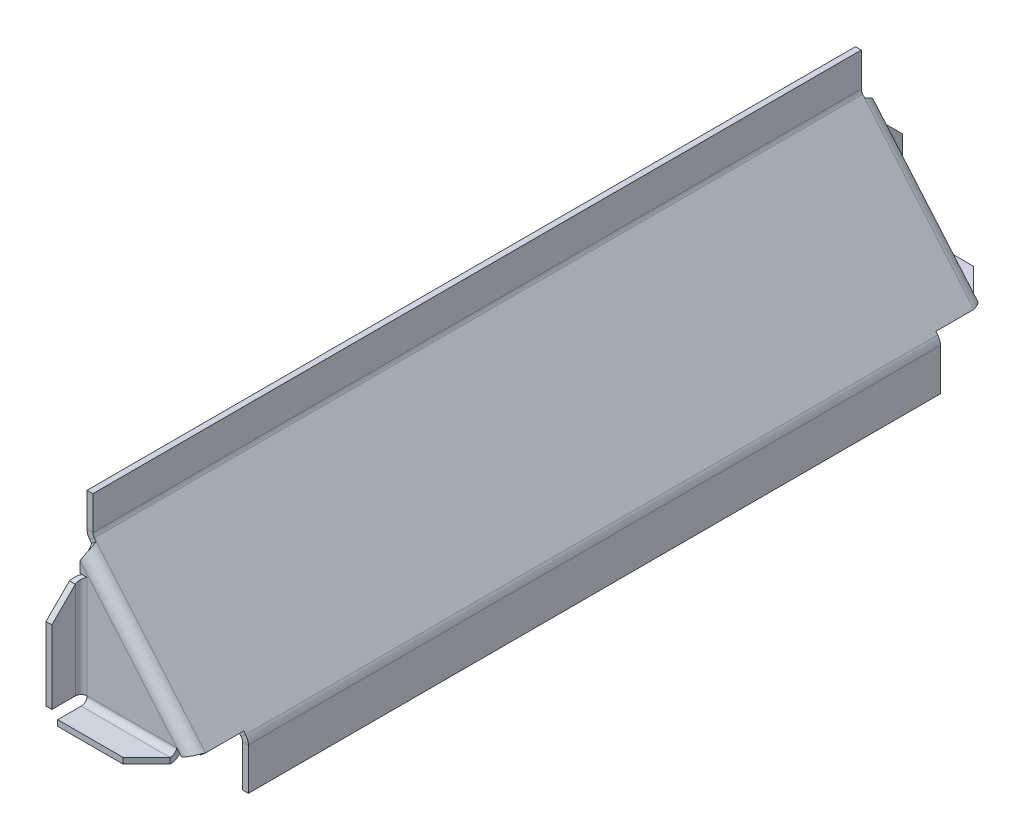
ISO-10303-21;
HEADER;
FILE_DESCRIPTION(('STEP AP214'),'2;1');
FILE_NAME('part.step','',(''),(''),'','','');
FILE_SCHEMA(('AUTOMOTIVE_DESIGN { 1 0 10303 214 1 1 1 1 }'));
ENDSEC;
DATA;
#1=APPLICATION_CONTEXT('core data for automotive mechanical design processes');
#2=APPLICATION_PROTOCOL_DEFINITION('international standard','automotive_design',2000,#1);
#3=PRODUCT_CONTEXT('',#1,'mechanical');
#4=PRODUCT('Part','Part','',(#3));
#5=PRODUCT_RELATED_PRODUCT_CATEGORY('part','',(#4));
#6=PRODUCT_DEFINITION_FORMATION('','',#4);
#7=PRODUCT_DEFINITION_CONTEXT('part definition',#1,'design');
#8=PRODUCT_DEFINITION('design','',#6,#7);
#9=PRODUCT_DEFINITION_SHAPE('','',#8);
#10=(LENGTH_UNIT() NAMED_UNIT(*) SI_UNIT(.MILLI.,.METRE.));
#11=(NAMED_UNIT(*) PLANE_ANGLE_UNIT() SI_UNIT($,.RADIAN.));
#12=(NAMED_UNIT(*) SI_UNIT($,.STERADIAN.) SOLID_ANGLE_UNIT());
#13=UNCERTAINTY_MEASURE_WITH_UNIT(LENGTH_MEASURE(1.E-05),#10,'distance_accuracy_value','');
#14=(GEOMETRIC_REPRESENTATION_CONTEXT(3) GLOBAL_UNCERTAINTY_ASSIGNED_CONTEXT((#13)) GLOBAL_UNIT_ASSIGNED_CONTEXT((#10,
#11,#12)) REPRESENTATION_CONTEXT('',''));
#15=CARTESIAN_POINT('',(0.,0.,0.));
#16=DIRECTION('',(0.,0.,1.));
#17=DIRECTION('',(1.,0.,0.));
#18=AXIS2_PLACEMENT_3D('',#15,#16,#17);
#19=CARTESIAN_POINT('',(-35.9999999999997,18.264145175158,135.));
#20=DIRECTION('',(-1.,0.,0.));
#21=DIRECTION('',(0.,-1.,0.));
#22=AXIS2_PLACEMENT_3D('',#19,#20,#21);
#23=PLANE('',#22);
#24=CARTESIAN_POINT('',(-35.9999999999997,18.264145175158,137.));
#25=DIRECTION('',(1.,0.,0.));
#26=DIRECTION('',(0.,1.,0.));
#27=AXIS2_PLACEMENT_3D('',#24,#25,#26);
#28=CIRCLE('',#27,1.99999999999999);
#29=CARTESIAN_POINT('',(-35.9999999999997,18.2641451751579,135.));
#30=VERTEX_POINT('',#29);
#31=CARTESIAN_POINT('',(-35.9999999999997,16.264145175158,137.));
#32=VERTEX_POINT('',#31);
#33=EDGE_CURVE('E734',#30,#32,#28,.F.);
#34=ORIENTED_EDGE('',*,*,#33,.F.);
#35=DIRECTION('',(0.,0.,-1.));
#36=VECTOR('',#35,1.);
#37=CARTESIAN_POINT('',(-35.9999999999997,18.2641451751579,135.));
#38=LINE('',#37,#36);
#39=CARTESIAN_POINT('',(-35.9999999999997,18.264145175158,133.));
#40=VERTEX_POINT('',#39);
#41=EDGE_CURVE('E650',#30,#40,#38,.T.);
#42=ORIENTED_EDGE('',*,*,#41,.T.);
#43=CARTESIAN_POINT('',(-35.9999999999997,18.264145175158,137.));
#44=DIRECTION('',(1.,0.,0.));
#45=DIRECTION('',(0.,1.,0.));
#46=AXIS2_PLACEMENT_3D('',#43,#44,#45);
#47=CIRCLE('',#46,3.99999999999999);
#48=CARTESIAN_POINT('',(-35.9999999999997,14.264145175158,137.));
#49=VERTEX_POINT('',#48);
#50=EDGE_CURVE('E743',#40,#49,#47,.F.);
#51=ORIENTED_EDGE('',*,*,#50,.T.);
#52=DIRECTION('',(0.,1.,0.));
#53=VECTOR('',#52,1.);
#54=CARTESIAN_POINT('',(-35.9999999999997,14.264145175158,137.));
#55=LINE('',#54,#53);
#56=EDGE_CURVE('E748',#32,#49,#55,.F.);
#57=ORIENTED_EDGE('',*,*,#56,.F.);
#58=EDGE_LOOP('',(#34,#42,#51,#57));
#59=FACE_BOUND('',#58,.T.);
#60=ADVANCED_FACE('F112',(#59),#23,.T.);
#61=CARTESIAN_POINT('',(-1.12503985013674,16.3219218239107,135.));
#62=DIRECTION('',(0.,0.,1.));
#63=DIRECTION('',(1.,0.,0.));
#64=AXIS2_PLACEMENT_3D('',#61,#62,#63);
#65=PLANE('',#64);
#66=DIRECTION('',(-1.,0.,0.));
#67=VECTOR('',#66,1.);
#68=CARTESIAN_POINT('',(-36.,53.2641451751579,135.));
#69=LINE('',#68,#67);
#70=CARTESIAN_POINT('',(-36.,53.2641451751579,135.));
#71=VERTEX_POINT('',#70);
#72=CARTESIAN_POINT('',(-38.3980389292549,53.2641451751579,135.));
#73=VERTEX_POINT('',#72);
#74=EDGE_CURVE('E13',#71,#73,#69,.T.);
#75=ORIENTED_EDGE('',*,*,#74,.F.);
#76=DIRECTION('',(0.,1.,0.));
#77=VECTOR('',#76,1.);
#78=CARTESIAN_POINT('',(-35.9999999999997,18.264145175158,135.));
#79=LINE('',#78,#77);
#80=EDGE_CURVE('E747',#30,#71,#79,.T.);
#81=ORIENTED_EDGE('',*,*,#80,.F.);
#82=DIRECTION('',(1.,0.,0.));
#83=VECTOR('',#82,1.);
#84=CARTESIAN_POINT('',(-5.40425531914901,18.2641451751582,135.));
#85=LINE('',#84,#83);
#86=CARTESIAN_POINT('',(-5.40425531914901,18.2641451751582,135.));
#87=VERTEX_POINT('',#86);
#88=EDGE_CURVE('E742',#87,#30,#85,.F.);
#89=ORIENTED_EDGE('',*,*,#88,.F.);
#90=DIRECTION('',(-0.648118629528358,0.761539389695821,0.));
#91=VECTOR('',#90,1.);
#92=CARTESIAN_POINT('',(-2.64811862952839,15.0256845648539,135.));
#93=LINE('',#92,#91);
#94=CARTESIAN_POINT('',(-38.3980389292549,57.0318409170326,135.));
#95=VERTEX_POINT('',#94);
#96=EDGE_CURVE('E655',#87,#95,#93,.T.);
#97=ORIENTED_EDGE('',*,*,#96,.T.);
#98=DIRECTION('',(0.,1.,0.));
#99=VECTOR('',#98,1.);
#100=CARTESIAN_POINT('',(-38.3980389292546,16.3219218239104,135.));
#101=LINE('',#100,#99);
#102=EDGE_CURVE('E777',#95,#73,#101,.F.);
#103=ORIENTED_EDGE('',*,*,#102,.T.);
#104=EDGE_LOOP('',(#75,#81,#89,#97,#103));
#105=FACE_BOUND('',#104,.T.);
#106=ADVANCED_FACE('F114',(#105),#65,.T.);
#107=CARTESIAN_POINT('',(-1.12503985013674,16.3219218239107,133.));
#108=DIRECTION('',(0.,0.,1.));
#109=DIRECTION('',(1.,0.,0.));
#110=AXIS2_PLACEMENT_3D('',#107,#108,#109);
#111=PLANE('',#110);
#112=DIRECTION('',(0.,-1.,0.));
#113=VECTOR('',#112,1.);
#114=CARTESIAN_POINT('',(-35.9999999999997,16.3219218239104,133.));
#115=LINE('',#114,#113);
#116=CARTESIAN_POINT('',(-36.,53.2641451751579,133.));
#117=VERTEX_POINT('',#116);
#118=EDGE_CURVE('E789',#117,#40,#115,.T.);
#119=ORIENTED_EDGE('',*,*,#118,.F.);
#120=DIRECTION('',(1.,0.,0.));
#121=VECTOR('',#120,1.);
#122=CARTESIAN_POINT('',(-1.12503985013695,53.2641451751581,133.));
#123=LINE('',#122,#121);
#124=CARTESIAN_POINT('',(-38.3980389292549,53.2641451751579,133.));
#125=VERTEX_POINT('',#124);
#126=EDGE_CURVE('E121',#125,#117,#123,.T.);
#127=ORIENTED_EDGE('',*,*,#126,.F.);
#128=DIRECTION('',(0.,-1.,0.));
#129=VECTOR('',#128,1.);
#130=CARTESIAN_POINT('',(-38.3980389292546,16.3219218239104,133.));
#131=LINE('',#130,#129);
#132=CARTESIAN_POINT('',(-38.3980389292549,57.0318409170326,133.));
#133=VERTEX_POINT('',#132);
#134=EDGE_CURVE('E116',#133,#125,#131,.T.);
#135=ORIENTED_EDGE('',*,*,#134,.F.);
#136=DIRECTION('',(0.648118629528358,-0.761539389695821,0.));
#137=VECTOR('',#136,1.);
#138=CARTESIAN_POINT('',(-3.7512992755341,16.3219218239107,133.));
#139=LINE('',#138,#137);
#140=CARTESIAN_POINT('',(-5.40425531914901,18.2641451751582,133.));
#141=VERTEX_POINT('',#140);
#142=EDGE_CURVE('E806',#141,#133,#139,.F.);
#143=ORIENTED_EDGE('',*,*,#142,.F.);
#144=DIRECTION('',(1.,0.,0.));
#145=VECTOR('',#144,1.);
#146=CARTESIAN_POINT('',(-5.40425531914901,18.2641451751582,133.));
#147=LINE('',#146,#145);
#148=EDGE_CURVE('E779',#141,#40,#147,.F.);
#149=ORIENTED_EDGE('',*,*,#148,.T.);
#150=EDGE_LOOP('',(#119,#127,#135,#143,#149));
#151=FACE_BOUND('',#150,.T.);
#152=ADVANCED_FACE('F696',(#151),#111,.F.);
#153=CARTESIAN_POINT('',(-38.3980389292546,16.3219218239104,135.));
#154=DIRECTION('',(1.,0.,0.));
#155=DIRECTION('',(0.,1.,0.));
#156=AXIS2_PLACEMENT_3D('',#153,#154,#155);
#157=PLANE('',#156);
#158=DIRECTION('',(0.,0.,-1.));
#159=VECTOR('',#158,1.);
#160=CARTESIAN_POINT('',(-38.3980389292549,53.2641451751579,135.));
#161=LINE('',#160,#159);
#162=EDGE_CURVE('E131',#73,#125,#161,.T.);
#163=ORIENTED_EDGE('',*,*,#162,.F.);
#164=ORIENTED_EDGE('',*,*,#102,.F.);
#165=DIRECTION('',(0.,0.,-1.));
#166=VECTOR('',#165,1.);
#167=CARTESIAN_POINT('',(-38.3980389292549,57.0318409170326,133.));
#168=LINE('',#167,#166);
#169=EDGE_CURVE('E808',#133,#95,#168,.F.);
#170=ORIENTED_EDGE('',*,*,#169,.F.);
#171=ORIENTED_EDGE('',*,*,#134,.T.);
#172=EDGE_LOOP('',(#163,#164,#170,#171));
#173=FACE_BOUND('',#172,.T.);
#174=ADVANCED_FACE('F885',(#173),#157,.F.);
#175=CARTESIAN_POINT('',(-36.8749601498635,61.4139330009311,131.));
#176=DIRECTION('',(0.,0.,1.));
#177=DIRECTION('',(1.,0.,0.));
#178=AXIS2_PLACEMENT_3D('',#175,#176,#177);
#179=PLANE('',#178);
#180=DIRECTION('',(-0.648118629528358,0.761539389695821,0.));
#181=VECTOR('',#180,1.);
#182=CARTESIAN_POINT('',(0.,15.,131.));
#183=LINE('',#182,#181);
#184=CARTESIAN_POINT('',(-38.3980389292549,60.1176957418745,131.));
#185=VERTEX_POINT('',#184);
#186=CARTESIAN_POINT('',(-39.0461575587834,60.8792351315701,131.));
#187=VERTEX_POINT('',#186);
#188=EDGE_CURVE('E1328',#185,#187,#183,.T.);
#189=ORIENTED_EDGE('',*,*,#188,.F.);
#190=DIRECTION('',(0.761539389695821,0.648118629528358,0.));
#191=VECTOR('',#190,1.);
#192=CARTESIAN_POINT('',(-38.3980389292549,60.1176957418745,131.));
#193=LINE('',#192,#191);
#194=CARTESIAN_POINT('',(-36.8749601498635,61.4139330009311,131.));
#195=VERTEX_POINT('',#194);
#196=EDGE_CURVE('E852',#185,#195,#193,.T.);
#197=ORIENTED_EDGE('',*,*,#196,.T.);
#198=DIRECTION('',(-0.648118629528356,0.761539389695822,0.));
#199=VECTOR('',#198,1.);
#200=CARTESIAN_POINT('',(-36.8749601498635,61.4139330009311,131.));
#201=LINE('',#200,#199);
#202=CARTESIAN_POINT('',(-37.5230787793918,62.1754723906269,131.));
#203=VERTEX_POINT('',#202);
#204=EDGE_CURVE('E2024',#195,#203,#201,.T.);
#205=ORIENTED_EDGE('',*,*,#204,.T.);
#206=DIRECTION('',(-0.761539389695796,-0.648118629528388,0.));
#207=VECTOR('',#206,1.);
#208=CARTESIAN_POINT('',(-37.5230787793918,62.1754723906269,131.));
#209=LINE('',#208,#207);
#210=EDGE_CURVE('E1071',#203,#187,#209,.T.);
#211=ORIENTED_EDGE('',*,*,#210,.T.);
#212=EDGE_LOOP('',(#189,#197,#205,#211));
#213=FACE_BOUND('',#212,.T.);
#214=ADVANCED_FACE('F887',(#213),#179,.T.);
#215=CARTESIAN_POINT('',(1.52307877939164,16.2962372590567,135.));
#216=DIRECTION('',(-0.761539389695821,-0.648118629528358,0.));
#217=DIRECTION('',(0.648118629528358,-0.761539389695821,0.));
#218=AXIS2_PLACEMENT_3D('',#215,#216,#217);
#219=PLANE('',#218);
#220=CARTESIAN_POINT('',(0.398038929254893,17.6181590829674,131.));
#221=VERTEX_POINT('',#220);
#222=EDGE_CURVE('E815',#221,#195,#201,.T.);
#223=ORIENTED_EDGE('',*,*,#222,.F.);
#224=DIRECTION('',(0.,0.,1.));
#225=VECTOR('',#224,1.);
#226=CARTESIAN_POINT('',(0.398038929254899,17.6181590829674,135.));
#227=LINE('',#226,#225);
#228=CARTESIAN_POINT('',(0.398038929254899,17.6181590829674,118.));
#229=VERTEX_POINT('',#228);
#230=EDGE_CURVE('E2057',#229,#221,#227,.T.);
#231=ORIENTED_EDGE('',*,*,#230,.F.);
#232=DIRECTION('',(-0.648118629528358,0.761539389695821,0.));
#233=VECTOR('',#232,1.);
#234=CARTESIAN_POINT('',(1.52307877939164,16.2962372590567,118.));
#235=LINE('',#234,#233);
#236=CARTESIAN_POINT('',(1.04615755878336,16.8566196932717,118.));
#237=VERTEX_POINT('',#236);
#238=EDGE_CURVE('E2062',#237,#229,#235,.T.);
#239=ORIENTED_EDGE('',*,*,#238,.F.);
#240=DIRECTION('',(0.,0.,1.));
#241=VECTOR('',#240,1.);
#242=CARTESIAN_POINT('',(1.04615755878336,16.8566196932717,118.));
#243=LINE('',#242,#241);
#244=CARTESIAN_POINT('',(1.04615755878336,16.8566196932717,-118.));
#245=VERTEX_POINT('',#244);
#246=EDGE_CURVE('E1069',#237,#245,#243,.F.);
#247=ORIENTED_EDGE('',*,*,#246,.T.);
#248=DIRECTION('',(-0.648118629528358,0.761539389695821,0.));
#249=VECTOR('',#248,1.);
#250=CARTESIAN_POINT('',(1.52307877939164,16.2962372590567,-118.));
#251=LINE('',#250,#249);
#252=CARTESIAN_POINT('',(0.398038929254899,17.6181590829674,-118.));
#253=VERTEX_POINT('',#252);
#254=EDGE_CURVE('E1094',#245,#253,#251,.T.);
#255=ORIENTED_EDGE('',*,*,#254,.T.);
#256=DIRECTION('',(0.,0.,-1.));
#257=VECTOR('',#256,1.);
#258=CARTESIAN_POINT('',(0.398038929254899,17.6181590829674,-135.));
#259=LINE('',#258,#257);
#260=CARTESIAN_POINT('',(0.398038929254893,17.6181590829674,-131.));
#261=VERTEX_POINT('',#260);
#262=EDGE_CURVE('E1095',#253,#261,#259,.T.);
#263=ORIENTED_EDGE('',*,*,#262,.T.);
#264=DIRECTION('',(-0.648118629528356,0.761539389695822,0.));
#265=VECTOR('',#264,1.);
#266=CARTESIAN_POINT('',(-36.8749601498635,61.4139330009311,-131.));
#267=LINE('',#266,#265);
#268=CARTESIAN_POINT('',(-36.8749601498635,61.4139330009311,-131.));
#269=VERTEX_POINT('',#268);
#270=EDGE_CURVE('E576',#261,#269,#267,.T.);
#271=ORIENTED_EDGE('',*,*,#270,.T.);
#272=CARTESIAN_POINT('',(-37.5230787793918,62.1754723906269,-131.));
#273=VERTEX_POINT('',#272);
#274=EDGE_CURVE('E592',#269,#273,#267,.T.);
#275=ORIENTED_EDGE('',*,*,#274,.T.);
#276=DIRECTION('',(0.,0.,1.));
#277=VECTOR('',#276,1.);
#278=CARTESIAN_POINT('',(-37.5230787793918,62.1754723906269,131.));
#279=LINE('',#278,#277);
#280=EDGE_CURVE('E1341',#203,#273,#279,.F.);
#281=ORIENTED_EDGE('',*,*,#280,.F.);
#282=ORIENTED_EDGE('',*,*,#204,.F.);
#283=EDGE_LOOP('',(#223,#231,#239,#247,#255,#263,#271,#275,#281,#282));
#284=FACE_BOUND('',#283,.T.);
#285=ADVANCED_FACE('F893',(#284),#219,.F.);
#286=CARTESIAN_POINT('',(0.,15.,135.));
#287=DIRECTION('',(-0.761539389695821,-0.648118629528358,0.));
#288=DIRECTION('',(0.648118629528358,-0.761539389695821,0.));
#289=AXIS2_PLACEMENT_3D('',#286,#287,#288);
#290=PLANE('',#289);
#291=DIRECTION('',(0.,0.,-1.));
#292=VECTOR('',#291,1.);
#293=CARTESIAN_POINT('',(-1.12503985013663,16.3219218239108,119.));
#294=LINE('',#293,#292);
#295=CARTESIAN_POINT('',(-1.12503985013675,16.3219218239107,131.));
#296=VERTEX_POINT('',#295);
#297=CARTESIAN_POINT('',(-1.12503985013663,16.3219218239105,118.));
#298=VERTEX_POINT('',#297);
#299=EDGE_CURVE('E2056',#296,#298,#294,.T.);
#300=ORIENTED_EDGE('',*,*,#299,.F.);
#301=EDGE_CURVE('E1070',#296,#185,#183,.T.);
#302=ORIENTED_EDGE('',*,*,#301,.T.);
#303=ORIENTED_EDGE('',*,*,#188,.T.);
#304=DIRECTION('',(0.,0.,1.));
#305=VECTOR('',#304,1.);
#306=CARTESIAN_POINT('',(-39.0461575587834,60.8792351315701,131.));
#307=LINE('',#306,#305);
#308=CARTESIAN_POINT('',(-39.0461575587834,60.8792351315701,-131.));
#309=VERTEX_POINT('',#308);
#310=EDGE_CURVE('E1326',#187,#309,#307,.F.);
#311=ORIENTED_EDGE('',*,*,#310,.T.);
#312=DIRECTION('',(-0.648118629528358,0.761539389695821,0.));
#313=VECTOR('',#312,1.);
#314=CARTESIAN_POINT('',(0.,15.,-131.));
#315=LINE('',#314,#313);
#316=CARTESIAN_POINT('',(-38.3980389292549,60.1176957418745,-131.));
#317=VERTEX_POINT('',#316);
#318=EDGE_CURVE('E1122',#317,#309,#315,.T.);
#319=ORIENTED_EDGE('',*,*,#318,.F.);
#320=CARTESIAN_POINT('',(-1.12503985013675,16.3219218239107,-131.));
#321=VERTEX_POINT('',#320);
#322=EDGE_CURVE('E1129',#321,#317,#315,.T.);
#323=ORIENTED_EDGE('',*,*,#322,.F.);
#324=DIRECTION('',(0.,0.,1.));
#325=VECTOR('',#324,1.);
#326=CARTESIAN_POINT('',(-1.12503985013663,16.3219218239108,-119.));
#327=LINE('',#326,#325);
#328=CARTESIAN_POINT('',(-1.12503985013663,16.3219218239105,-118.));
#329=VERTEX_POINT('',#328);
#330=EDGE_CURVE('E1096',#321,#329,#327,.T.);
#331=ORIENTED_EDGE('',*,*,#330,.T.);
#332=DIRECTION('',(0.648118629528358,-0.761539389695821,0.));
#333=VECTOR('',#332,1.);
#334=CARTESIAN_POINT('',(-1.12503985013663,16.3219218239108,-118.));
#335=LINE('',#334,#333);
#336=CARTESIAN_POINT('',(-0.476921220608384,15.5603824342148,-118.));
#337=VERTEX_POINT('',#336);
#338=EDGE_CURVE('E1101',#329,#337,#335,.T.);
#339=ORIENTED_EDGE('',*,*,#338,.T.);
#340=DIRECTION('',(0.,0.,1.));
#341=VECTOR('',#340,1.);
#342=CARTESIAN_POINT('',(-0.476921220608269,15.5603824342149,118.));
#343=LINE('',#342,#341);
#344=CARTESIAN_POINT('',(-0.476921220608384,15.5603824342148,118.));
#345=VERTEX_POINT('',#344);
#346=EDGE_CURVE('E1056',#345,#337,#343,.F.);
#347=ORIENTED_EDGE('',*,*,#346,.F.);
#348=DIRECTION('',(0.648118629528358,-0.761539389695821,0.));
#349=VECTOR('',#348,1.);
#350=CARTESIAN_POINT('',(-1.12503985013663,16.3219218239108,118.));
#351=LINE('',#350,#349);
#352=EDGE_CURVE('E1060',#298,#345,#351,.T.);
#353=ORIENTED_EDGE('',*,*,#352,.F.);
#354=EDGE_LOOP('',(#300,#302,#303,#311,#319,#323,#331,#339,#347,#353));
#355=FACE_BOUND('',#354,.T.);
#356=ADVANCED_FACE('F966',(#355),#290,.T.);
#357=CARTESIAN_POINT('',(-36.0000000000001,63.4717096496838,131.));
#358=DIRECTION('',(0.,0.,-1.));
#359=DIRECTION('',(-1.,0.,0.));
#360=AXIS2_PLACEMENT_3D('',#357,#358,#359);
#361=PLANE('',#360);
#362=CARTESIAN_POINT('',(-36.0000000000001,63.4717096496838,131.));
#363=DIRECTION('',(0.,0.,1.));
#364=DIRECTION('',(1.,0.,0.));
#365=AXIS2_PLACEMENT_3D('',#362,#363,#364);
#366=CIRCLE('',#365,2.00000000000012);
#367=CARTESIAN_POINT('',(-38.0000000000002,63.4717096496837,131.));
#368=VERTEX_POINT('',#367);
#369=EDGE_CURVE('E2034',#368,#203,#366,.T.);
#370=ORIENTED_EDGE('',*,*,#369,.F.);
#371=DIRECTION('',(1.,0.,0.));
#372=VECTOR('',#371,1.);
#373=CARTESIAN_POINT('',(-38.,63.4717096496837,131.));
#374=LINE('',#373,#372);
#375=CARTESIAN_POINT('',(-40.,63.4717096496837,131.));
#376=VERTEX_POINT('',#375);
#377=EDGE_CURVE('E1330',#368,#376,#374,.F.);
#378=ORIENTED_EDGE('',*,*,#377,.T.);
#379=CARTESIAN_POINT('',(-36.0000000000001,63.4717096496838,131.));
#380=DIRECTION('',(0.,0.,1.));
#381=DIRECTION('',(1.,0.,0.));
#382=AXIS2_PLACEMENT_3D('',#379,#380,#381);
#383=CIRCLE('',#382,4.00000000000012);
#384=EDGE_CURVE('E2040',#376,#187,#383,.T.);
#385=ORIENTED_EDGE('',*,*,#384,.T.);
#386=ORIENTED_EDGE('',*,*,#210,.F.);
#387=EDGE_LOOP('',(#370,#378,#385,#386));
#388=FACE_BOUND('',#387,.T.);
#389=ADVANCED_FACE('F969',(#388),#361,.F.);
#390=CARTESIAN_POINT('',(-36.0000000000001,63.4717096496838,131.));
#391=DIRECTION('',(0.,0.,1.));
#392=DIRECTION('',(-1.,0.,0.));
#393=AXIS2_PLACEMENT_3D('',#390,#391,#392);
#394=CYLINDRICAL_SURFACE('',#393,4.00000000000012);
#395=ORIENTED_EDGE('',*,*,#310,.F.);
#396=ORIENTED_EDGE('',*,*,#384,.F.);
#397=DIRECTION('',(0.,0.,1.));
#398=VECTOR('',#397,1.);
#399=CARTESIAN_POINT('',(-40.,63.4717096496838,0.));
#400=LINE('',#399,#398);
#401=CARTESIAN_POINT('',(-40.,63.4717096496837,-131.));
#402=VERTEX_POINT('',#401);
#403=EDGE_CURVE('E1334',#376,#402,#400,.F.);
#404=ORIENTED_EDGE('',*,*,#403,.T.);
#405=CARTESIAN_POINT('',(-36.0000000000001,63.4717096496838,-131.));
#406=DIRECTION('',(0.,0.,1.));
#407=DIRECTION('',(1.,0.,0.));
#408=AXIS2_PLACEMENT_3D('',#405,#406,#407);
#409=CIRCLE('',#408,4.00000000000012);
#410=EDGE_CURVE('E1121',#402,#309,#409,.T.);
#411=ORIENTED_EDGE('',*,*,#410,.T.);
#412=EDGE_LOOP('',(#395,#396,#404,#411));
#413=FACE_BOUND('',#412,.T.);
#414=ADVANCED_FACE('F974',(#413),#394,.T.);
#415=CARTESIAN_POINT('',(-36.0000000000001,63.4717096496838,131.));
#416=DIRECTION('',(0.,0.,1.));
#417=DIRECTION('',(-1.,0.,0.));
#418=AXIS2_PLACEMENT_3D('',#415,#416,#417);
#419=CYLINDRICAL_SURFACE('',#418,2.00000000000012);
#420=ORIENTED_EDGE('',*,*,#280,.T.);
#421=CARTESIAN_POINT('',(-36.0000000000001,63.4717096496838,-131.));
#422=DIRECTION('',(0.,0.,1.));
#423=DIRECTION('',(1.,0.,0.));
#424=AXIS2_PLACEMENT_3D('',#421,#422,#423);
#425=CIRCLE('',#424,2.00000000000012);
#426=CARTESIAN_POINT('',(-38.0000000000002,63.4717096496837,-131.));
#427=VERTEX_POINT('',#426);
#428=EDGE_CURVE('E1117',#427,#273,#425,.T.);
#429=ORIENTED_EDGE('',*,*,#428,.F.);
#430=DIRECTION('',(0.,0.,1.));
#431=VECTOR('',#430,1.);
#432=CARTESIAN_POINT('',(-38.,63.4717096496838,0.));
#433=LINE('',#432,#431);
#434=EDGE_CURVE('E2038',#427,#368,#433,.T.);
#435=ORIENTED_EDGE('',*,*,#434,.T.);
#436=ORIENTED_EDGE('',*,*,#369,.T.);
#437=EDGE_LOOP('',(#420,#429,#435,#436));
#438=FACE_BOUND('',#437,.T.);
#439=ADVANCED_FACE('F976',(#438),#419,.F.);
#440=CARTESIAN_POINT('',(-40.0000000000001,75.,131.));
#441=DIRECTION('',(0.,0.,-1.));
#442=DIRECTION('',(-1.,0.,0.));
#443=AXIS2_PLACEMENT_3D('',#440,#441,#442);
#444=PLANE('',#443);
#445=ORIENTED_EDGE('',*,*,#377,.F.);
#446=DIRECTION('',(0.,-1.,0.));
#447=VECTOR('',#446,1.);
#448=CARTESIAN_POINT('',(-38.0000000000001,75.,131.));
#449=LINE('',#448,#447);
#450=CARTESIAN_POINT('',(-38.0000000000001,75.,131.));
#451=VERTEX_POINT('',#450);
#452=EDGE_CURVE('E2037',#368,#451,#449,.F.);
#453=ORIENTED_EDGE('',*,*,#452,.T.);
#454=DIRECTION('',(1.,0.,0.));
#455=VECTOR('',#454,1.);
#456=CARTESIAN_POINT('',(-40.0000000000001,75.,131.));
#457=LINE('',#456,#455);
#458=CARTESIAN_POINT('',(-40.0000000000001,75.,131.));
#459=VERTEX_POINT('',#458);
#460=EDGE_CURVE('E2050',#459,#451,#457,.T.);
#461=ORIENTED_EDGE('',*,*,#460,.F.);
#462=DIRECTION('',(0.,1.,0.));
#463=VECTOR('',#462,1.);
#464=CARTESIAN_POINT('',(-40.,62.7358548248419,131.));
#465=LINE('',#464,#463);
#466=EDGE_CURVE('E2047',#376,#459,#465,.T.);
#467=ORIENTED_EDGE('',*,*,#466,.F.);
#468=EDGE_LOOP('',(#445,#453,#461,#467));
#469=FACE_BOUND('',#468,.T.);
#470=ADVANCED_FACE('F979',(#469),#444,.F.);
#471=CARTESIAN_POINT('',(-40.,62.7358548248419,0.));
#472=DIRECTION('',(1.,0.,0.));
#473=DIRECTION('',(0.,1.,0.));
#474=AXIS2_PLACEMENT_3D('',#471,#472,#473);
#475=PLANE('',#474);
#476=ORIENTED_EDGE('',*,*,#403,.F.);
#477=ORIENTED_EDGE('',*,*,#466,.T.);
#478=DIRECTION('',(0.,0.,-1.));
#479=VECTOR('',#478,1.);
#480=CARTESIAN_POINT('',(-40.0000000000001,75.,0.));
#481=LINE('',#480,#479);
#482=CARTESIAN_POINT('',(-40.0000000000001,75.,-131.));
#483=VERTEX_POINT('',#482);
#484=EDGE_CURVE('E2051',#459,#483,#481,.T.);
#485=ORIENTED_EDGE('',*,*,#484,.T.);
#486=DIRECTION('',(0.,1.,0.));
#487=VECTOR('',#486,1.);
#488=CARTESIAN_POINT('',(-40.,62.7358548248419,-131.));
#489=LINE('',#488,#487);
#490=EDGE_CURVE('E1111',#402,#483,#489,.T.);
#491=ORIENTED_EDGE('',*,*,#490,.F.);
#492=EDGE_LOOP('',(#476,#477,#485,#491));
#493=FACE_BOUND('',#492,.T.);
#494=ADVANCED_FACE('F986',(#493),#475,.F.);
#495=CARTESIAN_POINT('',(-38.,62.7358548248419,0.));
#496=DIRECTION('',(1.,0.,0.));
#497=DIRECTION('',(0.,1.,0.));
#498=AXIS2_PLACEMENT_3D('',#495,#496,#497);
#499=PLANE('',#498);
#500=ORIENTED_EDGE('',*,*,#452,.F.);
#501=ORIENTED_EDGE('',*,*,#434,.F.);
#502=DIRECTION('',(0.,-1.,0.));
#503=VECTOR('',#502,1.);
#504=CARTESIAN_POINT('',(-38.0000000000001,75.,-131.));
#505=LINE('',#504,#503);
#506=CARTESIAN_POINT('',(-38.0000000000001,75.,-131.));
#507=VERTEX_POINT('',#506);
#508=EDGE_CURVE('E1114',#427,#507,#505,.F.);
#509=ORIENTED_EDGE('',*,*,#508,.T.);
#510=DIRECTION('',(0.,0.,1.));
#511=VECTOR('',#510,1.);
#512=CARTESIAN_POINT('',(-38.0000000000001,75.,0.));
#513=LINE('',#512,#511);
#514=EDGE_CURVE('E2048',#451,#507,#513,.F.);
#515=ORIENTED_EDGE('',*,*,#514,.F.);
#516=EDGE_LOOP('',(#500,#501,#509,#515));
#517=FACE_BOUND('',#516,.T.);
#518=ADVANCED_FACE('F992',(#517),#499,.T.);
#519=CARTESIAN_POINT('',(-40.0000000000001,75.,0.));
#520=DIRECTION('',(0.,-1.,0.));
#521=DIRECTION('',(1.,0.,0.));
#522=AXIS2_PLACEMENT_3D('',#519,#520,#521);
#523=PLANE('',#522);
#524=ORIENTED_EDGE('',*,*,#514,.T.);
#525=DIRECTION('',(1.,0.,0.));
#526=VECTOR('',#525,1.);
#527=CARTESIAN_POINT('',(-40.0000000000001,75.,-131.));
#528=LINE('',#527,#526);
#529=EDGE_CURVE('E1100',#483,#507,#528,.T.);
#530=ORIENTED_EDGE('',*,*,#529,.F.);
#531=ORIENTED_EDGE('',*,*,#484,.F.);
#532=ORIENTED_EDGE('',*,*,#460,.T.);
#533=EDGE_LOOP('',(#524,#530,#531,#532));
#534=FACE_BOUND('',#533,.T.);
#535=ADVANCED_FACE('F988',(#534),#523,.F.);
#536=CARTESIAN_POINT('',(-1.12503985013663,16.3219218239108,119.));
#537=DIRECTION('',(0.648118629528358,-0.761539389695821,0.));
#538=DIRECTION('',(0.761539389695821,0.648118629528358,0.));
#539=AXIS2_PLACEMENT_3D('',#536,#537,#538);
#540=PLANE('',#539);
#541=DIRECTION('',(0.761539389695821,0.648118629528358,0.));
#542=VECTOR('',#541,1.);
#543=CARTESIAN_POINT('',(-1.12503985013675,16.3219218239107,131.));
#544=LINE('',#543,#542);
#545=EDGE_CURVE('E802',#296,#221,#544,.T.);
#546=ORIENTED_EDGE('',*,*,#545,.F.);
#547=ORIENTED_EDGE('',*,*,#299,.T.);
#548=DIRECTION('',(0.761539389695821,0.648118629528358,0.));
#549=VECTOR('',#548,1.);
#550=CARTESIAN_POINT('',(-1.12503985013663,16.3219218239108,118.));
#551=LINE('',#550,#549);
#552=EDGE_CURVE('E2061',#298,#229,#551,.T.);
#553=ORIENTED_EDGE('',*,*,#552,.T.);
#554=ORIENTED_EDGE('',*,*,#230,.T.);
#555=EDGE_LOOP('',(#546,#547,#553,#554));
#556=FACE_BOUND('',#555,.T.);
#557=ADVANCED_FACE('F991',(#556),#540,.T.);
#558=CARTESIAN_POINT('',(-1.12503985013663,16.3219218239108,118.));
#559=DIRECTION('',(0.,0.,1.));
#560=DIRECTION('',(1.,0.,0.));
#561=AXIS2_PLACEMENT_3D('',#558,#559,#560);
#562=PLANE('',#561);
#563=DIRECTION('',(0.761539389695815,0.648118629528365,0.));
#564=VECTOR('',#563,1.);
#565=CARTESIAN_POINT('',(-0.476921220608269,15.5603824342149,118.));
#566=LINE('',#565,#564);
#567=EDGE_CURVE('E2060',#345,#237,#566,.T.);
#568=ORIENTED_EDGE('',*,*,#567,.T.);
#569=ORIENTED_EDGE('',*,*,#238,.T.);
#570=ORIENTED_EDGE('',*,*,#552,.F.);
#571=ORIENTED_EDGE('',*,*,#352,.T.);
#572=EDGE_LOOP('',(#568,#569,#570,#571));
#573=FACE_BOUND('',#572,.T.);
#574=ADVANCED_FACE('F1002',(#573),#562,.T.);
#575=CARTESIAN_POINT('',(-1.99999999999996,14.2641451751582,118.));
#576=DIRECTION('',(0.,0.,-1.));
#577=DIRECTION('',(-1.,0.,0.));
#578=AXIS2_PLACEMENT_3D('',#575,#576,#577);
#579=PLANE('',#578);
#580=CARTESIAN_POINT('',(-1.99999999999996,14.2641451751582,118.));
#581=DIRECTION('',(0.,0.,1.));
#582=DIRECTION('',(1.,0.,0.));
#583=AXIS2_PLACEMENT_3D('',#580,#581,#582);
#584=CIRCLE('',#583,2.00000000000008);
#585=CARTESIAN_POINT('',(1.196959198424E-13,14.2641451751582,118.));
#586=VERTEX_POINT('',#585);
#587=EDGE_CURVE('E1044',#586,#345,#584,.T.);
#588=ORIENTED_EDGE('',*,*,#587,.F.);
#589=DIRECTION('',(1.,0.,0.));
#590=VECTOR('',#589,1.);
#591=CARTESIAN_POINT('',(0.,14.2641451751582,118.));
#592=LINE('',#591,#590);
#593=CARTESIAN_POINT('',(2.,14.2641451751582,118.));
#594=VERTEX_POINT('',#593);
#595=EDGE_CURVE('E1058',#586,#594,#592,.T.);
#596=ORIENTED_EDGE('',*,*,#595,.T.);
#597=CARTESIAN_POINT('',(-1.99999999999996,14.2641451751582,118.));
#598=DIRECTION('',(0.,0.,1.));
#599=DIRECTION('',(1.,0.,0.));
#600=AXIS2_PLACEMENT_3D('',#597,#598,#599);
#601=CIRCLE('',#600,4.00000000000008);
#602=EDGE_CURVE('E1057',#594,#237,#601,.T.);
#603=ORIENTED_EDGE('',*,*,#602,.T.);
#604=ORIENTED_EDGE('',*,*,#567,.F.);
#605=EDGE_LOOP('',(#588,#596,#603,#604));
#606=FACE_BOUND('',#605,.T.);
#607=ADVANCED_FACE('F1006',(#606),#579,.F.);
#608=CARTESIAN_POINT('',(-1.99999999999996,14.2641451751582,118.));
#609=DIRECTION('',(0.,0.,1.));
#610=DIRECTION('',(1.,0.,0.));
#611=AXIS2_PLACEMENT_3D('',#608,#609,#610);
#612=CYLINDRICAL_SURFACE('',#611,4.00000000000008);
#613=ORIENTED_EDGE('',*,*,#246,.F.);
#614=ORIENTED_EDGE('',*,*,#602,.F.);
#615=DIRECTION('',(0.,0.,-1.));
#616=VECTOR('',#615,1.);
#617=CARTESIAN_POINT('',(2.,14.2641451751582,118.));
#618=LINE('',#617,#616);
#619=CARTESIAN_POINT('',(2.,14.2641451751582,-118.));
#620=VERTEX_POINT('',#619);
#621=EDGE_CURVE('E1054',#594,#620,#618,.T.);
#622=ORIENTED_EDGE('',*,*,#621,.T.);
#623=CARTESIAN_POINT('',(-1.99999999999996,14.2641451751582,-118.));
#624=DIRECTION('',(0.,0.,1.));
#625=DIRECTION('',(1.,0.,0.));
#626=AXIS2_PLACEMENT_3D('',#623,#624,#625);
#627=CIRCLE('',#626,4.00000000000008);
#628=EDGE_CURVE('E1087',#620,#245,#627,.T.);
#629=ORIENTED_EDGE('',*,*,#628,.T.);
#630=EDGE_LOOP('',(#613,#614,#622,#629));
#631=FACE_BOUND('',#630,.T.);
#632=ADVANCED_FACE('F1010',(#631),#612,.T.);
#633=CARTESIAN_POINT('',(-1.99999999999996,14.2641451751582,118.));
#634=DIRECTION('',(0.,0.,1.));
#635=DIRECTION('',(1.,0.,0.));
#636=AXIS2_PLACEMENT_3D('',#633,#634,#635);
#637=CYLINDRICAL_SURFACE('',#636,2.00000000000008);
#638=ORIENTED_EDGE('',*,*,#346,.T.);
#639=CARTESIAN_POINT('',(-1.99999999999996,14.2641451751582,-118.));
#640=DIRECTION('',(0.,0.,1.));
#641=DIRECTION('',(1.,0.,0.));
#642=AXIS2_PLACEMENT_3D('',#639,#640,#641);
#643=CIRCLE('',#642,2.00000000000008);
#644=CARTESIAN_POINT('',(1.196959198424E-13,14.2641451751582,-118.));
#645=VERTEX_POINT('',#644);
#646=EDGE_CURVE('E1081',#645,#337,#643,.T.);
#647=ORIENTED_EDGE('',*,*,#646,.F.);
#648=DIRECTION('',(0.,0.,1.));
#649=VECTOR('',#648,1.);
#650=CARTESIAN_POINT('',(0.,14.2641451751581,0.));
#651=LINE('',#650,#649);
#652=EDGE_CURVE('E1037',#645,#586,#651,.T.);
#653=ORIENTED_EDGE('',*,*,#652,.T.);
#654=ORIENTED_EDGE('',*,*,#587,.T.);
#655=EDGE_LOOP('',(#638,#647,#653,#654));
#656=FACE_BOUND('',#655,.T.);
#657=ADVANCED_FACE('F1012',(#656),#637,.F.);
#658=CARTESIAN_POINT('',(2.0000000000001,0.,118.));
#659=DIRECTION('',(0.,0.,-1.));
#660=DIRECTION('',(-1.,0.,0.));
#661=AXIS2_PLACEMENT_3D('',#658,#659,#660);
#662=PLANE('',#661);
#663=ORIENTED_EDGE('',*,*,#595,.F.);
#664=DIRECTION('',(0.,-1.,0.));
#665=VECTOR('',#664,1.);
#666=CARTESIAN_POINT('',(0.,0.,118.));
#667=LINE('',#666,#665);
#668=CARTESIAN_POINT('',(0.,0.,118.));
#669=VERTEX_POINT('',#668);
#670=EDGE_CURVE('E1035',#586,#669,#667,.T.);
#671=ORIENTED_EDGE('',*,*,#670,.T.);
#672=DIRECTION('',(-1.,0.,0.));
#673=VECTOR('',#672,1.);
#674=CARTESIAN_POINT('',(2.0000000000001,0.,118.));
#675=LINE('',#674,#673);
#676=CARTESIAN_POINT('',(2.0000000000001,0.,118.));
#677=VERTEX_POINT('',#676);
#678=EDGE_CURVE('E821',#677,#669,#675,.T.);
#679=ORIENTED_EDGE('',*,*,#678,.F.);
#680=DIRECTION('',(0.,-1.,0.));
#681=VECTOR('',#680,1.);
#682=CARTESIAN_POINT('',(2.0000000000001,0.,118.));
#683=LINE('',#682,#681);
#684=EDGE_CURVE('E1043',#594,#677,#683,.T.);
#685=ORIENTED_EDGE('',*,*,#684,.F.);
#686=EDGE_LOOP('',(#663,#671,#679,#685));
#687=FACE_BOUND('',#686,.T.);
#688=ADVANCED_FACE('F1015',(#687),#662,.F.);
#689=CARTESIAN_POINT('',(2.,15.0000000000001,118.));
#690=DIRECTION('',(-1.,0.,0.));
#691=DIRECTION('',(0.,-1.,0.));
#692=AXIS2_PLACEMENT_3D('',#689,#690,#691);
#693=PLANE('',#692);
#694=ORIENTED_EDGE('',*,*,#621,.F.);
#695=ORIENTED_EDGE('',*,*,#684,.T.);
#696=DIRECTION('',(0.,0.,-1.));
#697=VECTOR('',#696,1.);
#698=CARTESIAN_POINT('',(2.0000000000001,0.,0.));
#699=LINE('',#698,#697);
#700=CARTESIAN_POINT('',(2.0000000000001,0.,-118.));
#701=VERTEX_POINT('',#700);
#702=EDGE_CURVE('E1046',#677,#701,#699,.T.);
#703=ORIENTED_EDGE('',*,*,#702,.T.);
#704=DIRECTION('',(0.,-1.,0.));
#705=VECTOR('',#704,1.);
#706=CARTESIAN_POINT('',(2.0000000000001,0.,-118.));
#707=LINE('',#706,#705);
#708=EDGE_CURVE('E1080',#620,#701,#707,.T.);
#709=ORIENTED_EDGE('',*,*,#708,.F.);
#710=EDGE_LOOP('',(#694,#695,#703,#709));
#711=FACE_BOUND('',#710,.T.);
#712=ADVANCED_FACE('F860',(#711),#693,.F.);
#713=CARTESIAN_POINT('',(0.,15.,118.));
#714=DIRECTION('',(-1.,0.,0.));
#715=DIRECTION('',(0.,-1.,0.));
#716=AXIS2_PLACEMENT_3D('',#713,#714,#715);
#717=PLANE('',#716);
#718=ORIENTED_EDGE('',*,*,#670,.F.);
#719=ORIENTED_EDGE('',*,*,#652,.F.);
#720=DIRECTION('',(0.,-1.,0.));
#721=VECTOR('',#720,1.);
#722=CARTESIAN_POINT('',(0.,0.,-118.));
#723=LINE('',#722,#721);
#724=CARTESIAN_POINT('',(0.,0.,-118.));
#725=VERTEX_POINT('',#724);
#726=EDGE_CURVE('E1077',#645,#725,#723,.T.);
#727=ORIENTED_EDGE('',*,*,#726,.T.);
#728=DIRECTION('',(0.,0.,-1.));
#729=VECTOR('',#728,1.);
#730=CARTESIAN_POINT('',(0.,0.,0.));
#731=LINE('',#730,#729);
#732=EDGE_CURVE('E1039',#669,#725,#731,.T.);
#733=ORIENTED_EDGE('',*,*,#732,.F.);
#734=EDGE_LOOP('',(#718,#719,#727,#733));
#735=FACE_BOUND('',#734,.T.);
#736=ADVANCED_FACE('F1025',(#735),#717,.T.);
#737=CARTESIAN_POINT('',(2.0000000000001,0.,0.));
#738=DIRECTION('',(0.,1.,0.));
#739=DIRECTION('',(-1.,0.,0.));
#740=AXIS2_PLACEMENT_3D('',#737,#738,#739);
#741=PLANE('',#740);
#742=ORIENTED_EDGE('',*,*,#732,.T.);
#743=DIRECTION('',(-1.,0.,0.));
#744=VECTOR('',#743,1.);
#745=CARTESIAN_POINT('',(2.0000000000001,0.,-118.));
#746=LINE('',#745,#744);
#747=EDGE_CURVE('E1075',#701,#725,#746,.T.);
#748=ORIENTED_EDGE('',*,*,#747,.F.);
#749=ORIENTED_EDGE('',*,*,#702,.F.);
#750=ORIENTED_EDGE('',*,*,#678,.T.);
#751=EDGE_LOOP('',(#742,#748,#749,#750));
#752=FACE_BOUND('',#751,.T.);
#753=ADVANCED_FACE('F1023',(#752),#741,.F.);
#754=CARTESIAN_POINT('',(0.413269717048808,17.6311214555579,131.));
#755=CARTESIAN_POINT('',(0.321322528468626,17.7391594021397,131.526305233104));
#756=CARTESIAN_POINT('',(0.149726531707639,17.7793484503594,132.052226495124));
#757=CARTESIAN_POINT('',(-0.340846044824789,17.7343589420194,133.024548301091));
#758=CARTESIAN_POINT('',(-0.659686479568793,17.6492649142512,133.470477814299));
#759=CARTESIAN_POINT('',(-1.41027450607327,17.3829856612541,134.214660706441));
#760=CARTESIAN_POINT('',(-1.84179911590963,17.2019902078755,134.512621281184));
#761=CARTESIAN_POINT('',(-2.76612391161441,16.7878498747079,134.915370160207));
#762=CARTESIAN_POINT('',(-3.25854992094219,16.5549921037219,135.02));
#763=CARTESIAN_POINT('',(-3.75129927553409,16.3219218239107,135.02));
#764=CARTESIAN_POINT('',(0.398038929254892,17.6181590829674,131.));
#765=CARTESIAN_POINT('',(0.306091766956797,17.7261969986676,131.523686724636));
#766=CARTESIAN_POINT('',(0.134892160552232,17.7667234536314,132.046991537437));
#767=CARTESIAN_POINT('',(-0.354154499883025,17.723032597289,133.014475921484));
#768=CARTESIAN_POINT('',(-0.671866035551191,17.6388993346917,133.4581868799));
#769=CARTESIAN_POINT('',(-1.41963453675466,17.3750196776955,134.198667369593));
#770=CARTESIAN_POINT('',(-1.84946962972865,17.1954621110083,134.495145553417));
#771=CARTESIAN_POINT('',(-2.77011053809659,16.7844570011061,134.895890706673));
#772=CARTESIAN_POINT('',(-3.26054404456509,16.5532950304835,135.));
#773=CARTESIAN_POINT('',(-3.75129927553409,16.3219218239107,135.));
#774=CARTESIAN_POINT('',(-1.12503985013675,16.3219218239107,131.));
#775=CARTESIAN_POINT('',(-1.21698438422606,16.4299566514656,131.261835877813));
#776=CARTESIAN_POINT('',(-1.34854495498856,16.5042237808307,131.523495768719));
#777=CARTESIAN_POINT('',(-1.68500000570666,16.5903981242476,132.007237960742));
#778=CARTESIAN_POINT('',(-1.88982163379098,16.602341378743,132.22909343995));
#779=CARTESIAN_POINT('',(-2.35563760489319,16.5784213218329,132.599333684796));
#780=CARTESIAN_POINT('',(-2.61652101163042,16.5426524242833,132.747572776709));
#781=CARTESIAN_POINT('',(-3.16877318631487,16.4451696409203,132.947945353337));
#782=CARTESIAN_POINT('',(-3.45995640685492,16.3835877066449,133.));
#783=CARTESIAN_POINT('',(-3.75129927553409,16.3219218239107,133.));
#784=CARTESIAN_POINT('',(-1.14042294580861,16.3088298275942,131.));
#785=CARTESIAN_POINT('',(-1.23236745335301,16.4168646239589,131.25919118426));
#786=CARTESIAN_POINT('',(-1.36352766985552,16.4914725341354,131.518208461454));
#787=CARTESIAN_POINT('',(-1.69844154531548,16.5789585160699,131.997064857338));
#788=CARTESIAN_POINT('',(-1.90212298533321,16.5918721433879,132.216679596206));
#789=CARTESIAN_POINT('',(-2.36509123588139,16.5703756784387,132.58318041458));
#790=CARTESIAN_POINT('',(-2.62426823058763,16.5360590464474,132.729922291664));
#791=CARTESIAN_POINT('',(-3.17279967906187,16.4417428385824,132.928271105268));
#792=CARTESIAN_POINT('',(-3.46197047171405,16.3818736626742,132.9798));
#793=CARTESIAN_POINT('',(-3.75129927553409,16.3219218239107,132.9798));
#794=B_SPLINE_SURFACE_WITH_KNOTS('',1,3,((#754,#755,#756,#757,#758,#759,#760,#761,#762,#763),
(#764,#765,#766,#767,#768,#769,#770,#771,#772,#773),(#774,#775,#776,#777,#778,#779,#780,#781,
#782,#783),(#784,#785,#786,#787,#788,#789,#790,#791,#792,#793)),.UNSPECIFIED.,.F.,.F.,.F.,(2,1,
1,2),(4,2,2,2,4),(-0.01,0.,1.,1.0101),(0.,0.25,0.5,0.75,1.),.UNSPECIFIED.);
#795=DIRECTION('',(0.,0.,-1.));
#796=VECTOR('',#795,1.);
#797=CARTESIAN_POINT('',(-3.7512992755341,16.3219218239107,135.));
#798=LINE('',#797,#796);
#799=CARTESIAN_POINT('',(-3.7512992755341,16.3219218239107,133.));
#800=VERTEX_POINT('',#799);
#801=CARTESIAN_POINT('',(-3.75129927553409,16.3219218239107,135.));
#802=VERTEX_POINT('',#801);
#803=EDGE_CURVE('E790',#800,#802,#798,.F.);
#804=CARTESIAN_POINT('',(-1.12503985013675,16.3219218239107,131.));
#805=CARTESIAN_POINT('',(-1.15147718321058,16.3530141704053,131.075321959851));
#806=CARTESIAN_POINT('',(-1.18118001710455,16.3813220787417,131.150639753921));
#807=CARTESIAN_POINT('',(-1.24701850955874,16.43246332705,131.300321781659));
#808=CARTESIAN_POINT('',(-1.28315449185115,16.4552963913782,131.374685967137));
#809=CARTESIAN_POINT('',(-1.36165997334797,16.4955286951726,131.521323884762));
#810=CARTESIAN_POINT('',(-1.40401363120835,16.5129414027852,131.593602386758));
#811=CARTESIAN_POINT('',(-1.49478257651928,16.5425845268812,131.735311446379));
#812=CARTESIAN_POINT('',(-1.54319654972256,16.5548160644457,131.804742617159));
#813=CARTESIAN_POINT('',(-1.68205423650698,16.5812054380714,131.987582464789));
#814=CARTESIAN_POINT('',(-1.77808686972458,16.5906541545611,132.097529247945));
#815=CARTESIAN_POINT('',(-1.98508800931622,16.596738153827,132.302467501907));
#816=CARTESIAN_POINT('',(-2.09604516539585,16.5933831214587,132.397470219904));
#817=CARTESIAN_POINT('',(-2.33053910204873,16.5759517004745,132.569185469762));
#818=CARTESIAN_POINT('',(-2.454073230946,16.5618775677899,132.64590184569));
#819=CARTESIAN_POINT('',(-2.7108974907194,16.5254682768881,132.778258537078));
#820=CARTESIAN_POINT('',(-2.84419192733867,16.5031294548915,132.833889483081));
#821=CARTESIAN_POINT('',(-3.10557779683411,16.4550913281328,132.918217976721));
#822=CARTESIAN_POINT('',(-3.23313890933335,16.4298429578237,132.948812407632));
#823=CARTESIAN_POINT('',(-3.42641484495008,16.3902468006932,132.979482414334));
#824=CARTESIAN_POINT('',(-3.49117662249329,16.3767577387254,132.987168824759));
#825=CARTESIAN_POINT('',(-3.62105034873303,16.3494876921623,132.997428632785));
#826=CARTESIAN_POINT('',(-3.68616233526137,16.3357066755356,133.000001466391));
#827=CARTESIAN_POINT('',(-3.75129927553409,16.3219218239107,133.));
#828=B_SPLINE_CURVE_WITH_KNOTS('',3,(#804,#805,#806,#807,#808,#809,#810,#811,#812,#813,#814,
#815,#816,#817,#818,#819,#820,#821,#822,#823,#824,#825,#826,#827),.UNSPECIFIED.,.F.,.F.,(4,2,2,
2,2,2,2,2,2,2,2,4),(0.,0.256889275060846,0.513791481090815,0.770050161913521,1.02625336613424,
1.46287534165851,1.89916711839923,2.3353670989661,2.77176068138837,3.17082372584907,
3.37044083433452,3.57007995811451),.UNSPECIFIED.);
#829=EDGE_CURVE('E807',#296,#800,#828,.T.);
#830=CARTESIAN_POINT('',(0.398038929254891,17.6181590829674,131.));
#831=CARTESIAN_POINT('',(0.377581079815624,17.6422185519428,131.116573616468));
#832=CARTESIAN_POINT('',(0.353222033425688,17.6629570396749,131.233145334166));
#833=CARTESIAN_POINT('',(0.296779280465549,17.6978559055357,131.465393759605));
#834=CARTESIAN_POINT('',(0.264695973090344,17.7120166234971,131.581070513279));
#835=CARTESIAN_POINT('',(0.192908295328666,17.7338177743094,131.810560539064));
#836=CARTESIAN_POINT('',(0.153209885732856,17.7414632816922,131.92437519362));
#837=CARTESIAN_POINT('',(0.0663240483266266,17.7503839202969,132.149363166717));
#838=CARTESIAN_POINT('',(0.0191367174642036,17.7516591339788,132.260536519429));
#839=CARTESIAN_POINT('',(-0.082546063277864,17.7480088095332,132.479447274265));
#840=CARTESIAN_POINT('',(-0.137044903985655,17.7430803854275,132.587183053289));
#841=CARTESIAN_POINT('',(-0.253095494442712,17.7272367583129,132.798380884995));
#842=CARTESIAN_POINT('',(-0.314649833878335,17.7163193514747,132.901841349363));
#843=CARTESIAN_POINT('',(-0.444441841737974,17.6887685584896,133.103598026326));
#844=CARTESIAN_POINT('',(-0.512675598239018,17.6721385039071,133.201897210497));
#845=CARTESIAN_POINT('',(-0.655519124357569,17.6334682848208,133.392678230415));
#846=CARTESIAN_POINT('',(-0.730131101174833,17.611426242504,133.485158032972));
#847=CARTESIAN_POINT('',(-0.885280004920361,17.5622926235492,133.663537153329));
#848=CARTESIAN_POINT('',(-0.965815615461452,17.5352021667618,133.749437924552));
#849=CARTESIAN_POINT('',(-1.13236701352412,17.4763573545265,133.914026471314));
#850=CARTESIAN_POINT('',(-1.21838280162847,17.4446029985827,133.992714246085));
#851=CARTESIAN_POINT('',(-1.39543720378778,17.3768376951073,134.14231360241));
#852=CARTESIAN_POINT('',(-1.48647828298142,17.3408246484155,134.213221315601));
#853=CARTESIAN_POINT('',(-1.67297305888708,17.2650270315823,134.34665062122));
#854=CARTESIAN_POINT('',(-1.76842521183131,17.2252437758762,134.409175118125));
#855=CARTESIAN_POINT('',(-1.96326967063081,17.1423570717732,134.525430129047));
#856=CARTESIAN_POINT('',(-2.06266470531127,17.0992513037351,134.579154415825));
#857=CARTESIAN_POINT('',(-2.26468950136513,17.0102710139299,134.67732729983));
#858=CARTESIAN_POINT('',(-2.36731805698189,16.9643975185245,134.721779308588));
#859=CARTESIAN_POINT('',(-2.57514938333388,16.8704328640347,134.801066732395));
#860=CARTESIAN_POINT('',(-2.68035042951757,16.8223431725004,134.835908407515));
#861=CARTESIAN_POINT('',(-2.89270572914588,16.724483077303,134.895738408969));
#862=CARTESIAN_POINT('',(-2.99985927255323,16.6747132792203,134.920730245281));
#863=CARTESIAN_POINT('',(-3.21417658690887,16.5746597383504,134.960438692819));
#864=CARTESIAN_POINT('',(-3.32132419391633,16.5243897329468,134.975277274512));
#865=CARTESIAN_POINT('',(-3.53608098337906,16.423386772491,134.995055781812));
#866=CARTESIAN_POINT('',(-3.64368902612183,16.3726547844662,135.000013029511));
#867=CARTESIAN_POINT('',(-3.75129927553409,16.3219218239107,135.));
#868=B_SPLINE_CURVE_WITH_KNOTS('',3,(#830,#831,#832,#833,#834,#835,#836,#837,#838,#839,#840,
#841,#842,#843,#844,#845,#846,#847,#848,#849,#850,#851,#852,#853,#854,#855,#856,#857,#858,#859,
#860,#861,#862,#863,#864,#865,#866,#867),.UNSPECIFIED.,.F.,.F.,(4,2,2,2,2,2,2,2,2,2,2,2,2,2,2,2,
2,2,4),(0.,0.362216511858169,0.724414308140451,1.08632973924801,1.44824048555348,
1.81031965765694,2.17253215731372,2.53453377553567,2.8966611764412,3.25870834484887,
3.62075555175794,3.98298196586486,4.34508255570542,4.70743827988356,5.06966044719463,
5.43164610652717,5.79350265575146,6.15093210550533,6.50773442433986),.UNSPECIFIED.);
#869=EDGE_CURVE('E811',#221,#802,#868,.T.);
#870=ORIENTED_EDGE('',*,*,#803,.F.);
#871=ORIENTED_EDGE('',*,*,#829,.F.);
#872=ORIENTED_EDGE('',*,*,#545,.T.);
#873=ORIENTED_EDGE('',*,*,#869,.T.);
#874=EDGE_LOOP('',(#870,#871,#872,#873));
#875=FACE_BOUND('',#874,.T.);
#876=ADVANCED_FACE('F833',(#875),#794,.F.);
#877=CARTESIAN_POINT('',(-38.3980389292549,57.0318409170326,135.02));
#878=CARTESIAN_POINT('',(-38.1241840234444,57.5221042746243,135.02));
#879=CARTESIAN_POINT('',(-37.8505734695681,58.0120781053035,134.915370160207));
#880=CARTESIAN_POINT('',(-37.3639585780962,58.9405275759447,134.512621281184));
#881=CARTESIAN_POINT('',(-37.1512889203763,59.3786775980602,134.214660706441));
#882=CARTESIAN_POINT('',(-36.8384107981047,60.159265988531,133.470477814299));
#883=CARTESIAN_POINT('',(-36.7384253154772,60.5015145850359,133.024548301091));
#884=CARTESIAN_POINT('',(-36.6855626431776,61.0608132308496,132.052226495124));
#885=CARTESIAN_POINT('',(-36.7327860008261,61.277736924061,131.526300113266));
#886=CARTESIAN_POINT('',(-36.8597293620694,61.4268953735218,131.));
#887=CARTESIAN_POINT('',(-38.3980389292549,57.0318409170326,135.));
#888=CARTESIAN_POINT('',(-38.1261780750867,57.5204070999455,135.));
#889=CARTESIAN_POINT('',(-37.8545600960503,58.0086852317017,134.895890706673));
#890=CARTESIAN_POINT('',(-37.3716290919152,58.9339994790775,134.495145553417));
#891=CARTESIAN_POINT('',(-37.1606489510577,59.3707116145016,134.198667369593));
#892=CARTESIAN_POINT('',(-36.8505903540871,60.1489004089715,133.4581868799));
#893=CARTESIAN_POINT('',(-36.7517337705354,60.4901882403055,133.014475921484));
#894=CARTESIAN_POINT('',(-36.700397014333,61.0481882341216,132.046991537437));
#895=CARTESIAN_POINT('',(-36.7480168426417,61.2647746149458,131.523681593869));
#896=CARTESIAN_POINT('',(-36.8749601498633,61.4139330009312,131.));
#897=CARTESIAN_POINT('',(-38.3980389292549,57.0318409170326,133.));
#898=CARTESIAN_POINT('',(-38.3255832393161,57.3506896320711,133.));
#899=CARTESIAN_POINT('',(-38.2532227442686,57.6693978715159,132.947945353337));
#900=CARTESIAN_POINT('',(-38.138680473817,58.2811897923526,132.747572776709));
#901=CARTESIAN_POINT('',(-38.0966520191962,58.574113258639,132.599333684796));
#902=CARTESIAN_POINT('',(-38.0685459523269,59.1123424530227,132.22909343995));
#903=CARTESIAN_POINT('',(-38.0825792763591,59.3575537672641,132.007237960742));
#904=CARTESIAN_POINT('',(-38.1838341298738,59.7856885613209,131.523495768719));
#905=CARTESIAN_POINT('',(-38.2711010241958,59.9685437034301,131.261829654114));
#906=CARTESIAN_POINT('',(-38.3980389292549,60.1176957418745,131.));
#907=CARTESIAN_POINT('',(-38.3980389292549,57.0318409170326,132.9798));
#908=CARTESIAN_POINT('',(-38.3275972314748,57.3489754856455,132.9798));
#909=CARTESIAN_POINT('',(-38.2572492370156,57.665971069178,132.928271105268));
#910=CARTESIAN_POINT('',(-38.1464276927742,58.2745964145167,132.729922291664));
#911=CARTESIAN_POINT('',(-38.1061056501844,58.5660676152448,132.58318041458));
#912=CARTESIAN_POINT('',(-38.0808473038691,59.1018732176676,132.216679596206));
#913=CARTESIAN_POINT('',(-38.0960208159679,59.3461141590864,131.997064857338));
#914=CARTESIAN_POINT('',(-38.1988168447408,59.7729373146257,131.518208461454));
#915=CARTESIAN_POINT('',(-38.2864841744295,59.9554517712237,131.259184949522));
#916=CARTESIAN_POINT('',(-38.4134220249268,60.104603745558,131.));
#917=B_SPLINE_SURFACE_WITH_KNOTS('',1,3,((#877,#878,#879,#880,#881,#882,#883,#884,#885,#886),
(#887,#888,#889,#890,#891,#892,#893,#894,#895,#896),(#897,#898,#899,#900,#901,#902,#903,#904,
#905,#906),(#907,#908,#909,#910,#911,#912,#913,#914,#915,#916)),.UNSPECIFIED.,.F.,.F.,.F.,(2,1,
1,2),(4,2,2,2,4),(-0.01,0.,1.,1.0101),(0.,0.25,0.5,0.75,1.),.UNSPECIFIED.);
#918=CARTESIAN_POINT('',(-38.3980389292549,57.0318409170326,133.));
#919=CARTESIAN_POINT('',(-38.3792378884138,57.1145877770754,133.000012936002));
#920=CARTESIAN_POINT('',(-38.3604361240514,57.1973325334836,132.996537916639));
#921=CARTESIAN_POINT('',(-38.323368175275,57.3623576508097,132.982704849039));
#922=CARTESIAN_POINT('',(-38.3051019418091,57.444638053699,132.972347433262));
#923=CARTESIAN_POINT('',(-38.2696478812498,57.6082460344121,132.944849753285));
#924=CARTESIAN_POINT('',(-38.2524594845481,57.6895740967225,132.927713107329));
#925=CARTESIAN_POINT('',(-38.2196717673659,57.850880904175,132.886839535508));
#926=CARTESIAN_POINT('',(-38.2040724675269,57.9308596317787,132.863102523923));
#927=CARTESIAN_POINT('',(-38.1744433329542,58.091867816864,132.80830941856));
#928=CARTESIAN_POINT('',(-38.1604894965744,58.1728327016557,132.777022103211));
#929=CARTESIAN_POINT('',(-38.1353489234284,58.3324270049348,132.707963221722));
#930=CARTESIAN_POINT('',(-38.1241632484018,58.4110555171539,132.670189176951));
#931=CARTESIAN_POINT('',(-38.1050846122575,58.5654685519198,132.588610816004));
#932=CARTESIAN_POINT('',(-38.0971892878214,58.6412550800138,132.544810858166));
#933=CARTESIAN_POINT('',(-38.0851397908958,58.7896529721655,132.451652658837));
#934=CARTESIAN_POINT('',(-38.0809869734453,58.8622631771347,132.40229241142));
#935=CARTESIAN_POINT('',(-38.0748017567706,59.0747438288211,132.246670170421));
#936=CARTESIAN_POINT('',(-38.0790260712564,59.2093877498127,132.132800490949));
#937=CARTESIAN_POINT('',(-38.107080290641,59.4619567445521,131.890013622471));
#938=CARTESIAN_POINT('',(-38.1309111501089,59.5798810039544,131.761095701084));
#939=CARTESIAN_POINT('',(-38.1916695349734,59.7709232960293,131.526442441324));
#940=CARTESIAN_POINT('',(-38.2240066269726,59.8479655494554,131.422687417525));
#941=CARTESIAN_POINT('',(-38.282066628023,59.9552935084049,131.265137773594));
#942=CARTESIAN_POINT('',(-38.3030033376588,59.9896863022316,131.212320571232));
#943=CARTESIAN_POINT('',(-38.3480976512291,60.0557417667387,131.106339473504));
#944=CARTESIAN_POINT('',(-38.3722558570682,60.0874039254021,131.05317551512));
#945=CARTESIAN_POINT('',(-38.3980389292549,60.1176957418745,131.));
#946=B_SPLINE_CURVE_WITH_KNOTS('',3,(#918,#919,#920,#921,#922,#923,#924,#925,#926,#927,#928,
#929,#930,#931,#932,#933,#934,#935,#936,#937,#938,#939,#940,#941,#942,#943,#944,#945),
.UNSPECIFIED.,.F.,.F.,(4,2,2,2,2,2,2,2,2,2,2,2,2,4),(0.,0.254493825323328,0.508964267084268,
0.763299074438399,1.01763718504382,1.2810634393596,1.54459057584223,1.80792810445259,
2.07136094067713,2.59780889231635,3.12428247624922,3.5228068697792,3.72192941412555,
3.92108921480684),.UNSPECIFIED.);
#947=EDGE_CURVE('E798',#133,#185,#946,.T.);
#948=CARTESIAN_POINT('',(-38.3980389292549,57.0318409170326,135.));
#949=CARTESIAN_POINT('',(-38.3356713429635,57.1439267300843,135.000015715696));
#950=CARTESIAN_POINT('',(-38.2733045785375,57.2560104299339,134.994588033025));
#951=CARTESIAN_POINT('',(-38.1493139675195,57.4795397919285,134.97295924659));
#952=CARTESIAN_POINT('',(-38.0876900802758,57.5909854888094,134.956758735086));
#953=CARTESIAN_POINT('',(-37.965968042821,57.812529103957,134.913714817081));
#954=CARTESIAN_POINT('',(-37.9058687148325,57.9226280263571,134.886879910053));
#955=CARTESIAN_POINT('',(-37.7878729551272,58.1409555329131,134.822790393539));
#956=CARTESIAN_POINT('',(-37.7299764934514,58.2491841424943,134.785535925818));
#957=CARTESIAN_POINT('',(-37.6170500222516,58.4632387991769,134.700880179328));
#958=CARTESIAN_POINT('',(-37.5620218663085,58.5690632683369,134.653472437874));
#959=CARTESIAN_POINT('',(-37.4555347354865,58.7776959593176,134.548889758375));
#960=CARTESIAN_POINT('',(-37.40407708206,58.8805030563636,134.491711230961));
#961=CARTESIAN_POINT('',(-37.3054354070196,59.0824381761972,134.3681011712));
#962=CARTESIAN_POINT('',(-37.2582487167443,59.1815684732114,134.301675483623));
#963=CARTESIAN_POINT('',(-37.1687214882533,59.3757295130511,134.160059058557));
#964=CARTESIAN_POINT('',(-37.1263826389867,59.4707588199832,134.084865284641));
#965=CARTESIAN_POINT('',(-37.0471575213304,59.6561625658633,133.926361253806));
#966=CARTESIAN_POINT('',(-37.0102698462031,59.746538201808,133.843053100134));
#967=CARTESIAN_POINT('',(-36.9424690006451,59.9222056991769,133.668979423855));
#968=CARTESIAN_POINT('',(-36.9115558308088,60.0074975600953,133.578213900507));
#969=CARTESIAN_POINT('',(-36.8561697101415,60.1726315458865,133.389901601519));
#970=CARTESIAN_POINT('',(-36.8317007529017,60.2524702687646,133.292350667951));
#971=CARTESIAN_POINT('',(-36.7896745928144,60.4062459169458,133.091345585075));
#972=CARTESIAN_POINT('',(-36.7721149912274,60.4801848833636,132.987893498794));
#973=CARTESIAN_POINT('',(-36.7442637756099,60.6219317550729,132.775804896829));
#974=CARTESIAN_POINT('',(-36.7339783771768,60.6897343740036,132.667164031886));
#975=CARTESIAN_POINT('',(-36.7210199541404,60.8188386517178,132.445701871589));
#976=CARTESIAN_POINT('',(-36.7183440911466,60.8801427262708,132.332882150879));
#977=CARTESIAN_POINT('',(-36.7208520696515,60.995997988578,132.104058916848));
#978=CARTESIAN_POINT('',(-36.7260279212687,61.0505559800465,131.988058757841));
#979=CARTESIAN_POINT('',(-36.7444164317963,61.152807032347,131.753747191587));
#980=CARTESIAN_POINT('',(-36.7576254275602,61.2005032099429,131.635436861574));
#981=CARTESIAN_POINT('',(-36.7873612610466,61.2765587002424,131.430774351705));
#982=CARTESIAN_POINT('',(-36.8019233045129,61.306592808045,131.344750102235));
#983=CARTESIAN_POINT('',(-36.8352715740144,61.3629947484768,131.17248640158));
#984=CARTESIAN_POINT('',(-36.8540505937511,61.3893687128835,131.086247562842));
#985=CARTESIAN_POINT('',(-36.8749601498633,61.4139330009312,131.));
#986=B_SPLINE_CURVE_WITH_KNOTS('',3,(#948,#949,#950,#951,#952,#953,#954,#955,#956,#957,#958,
#959,#960,#961,#962,#963,#964,#965,#966,#967,#968,#969,#970,#971,#972,#973,#974,#975,#976,#977,
#978,#979,#980,#981,#982,#983,#984,#985),.UNSPECIFIED.,.F.,.F.,(4,2,2,2,2,2,2,2,2,2,2,2,2,2,2,2,
2,2,4),(0.,0.384689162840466,0.769357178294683,1.1537183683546,1.53807432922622,
1.92267566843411,2.30741859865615,2.69191944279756,3.07655383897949,3.46108880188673,
3.84562380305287,4.2303965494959,4.61503559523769,5.00000290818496,5.38482660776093,
5.76925897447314,6.15351616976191,6.43017370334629,6.70636201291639),.UNSPECIFIED.);
#987=EDGE_CURVE('E810',#95,#195,#986,.T.);
#988=ORIENTED_EDGE('',*,*,#947,.F.);
#989=ORIENTED_EDGE('',*,*,#169,.T.);
#990=ORIENTED_EDGE('',*,*,#987,.T.);
#991=ORIENTED_EDGE('',*,*,#196,.F.);
#992=EDGE_LOOP('',(#988,#989,#990,#991));
#993=FACE_BOUND('',#992,.T.);
#994=ADVANCED_FACE('F842',(#993),#917,.F.);
#995=CARTESIAN_POINT('',(-39.9211177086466,58.8214584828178,131.));
#996=DIRECTION('',(-0.648118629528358,0.761539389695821,0.));
#997=DIRECTION('',(0.,0.,1.));
#998=AXIS2_PLACEMENT_3D('',#995,#996,#997);
#999=CYLINDRICAL_SURFACE('',#998,4.);
#1000=ORIENTED_EDGE('',*,*,#222,.T.);
#1001=ORIENTED_EDGE('',*,*,#987,.F.);
#1002=ORIENTED_EDGE('',*,*,#96,.F.);
#1003=EDGE_CURVE('E783',#802,#87,#93,.T.);
#1004=ORIENTED_EDGE('',*,*,#1003,.F.);
#1005=ORIENTED_EDGE('',*,*,#869,.F.);
#1006=EDGE_LOOP('',(#1000,#1001,#1002,#1004,#1005));
#1007=FACE_BOUND('',#1006,.T.);
#1008=ADVANCED_FACE('F838',(#1007),#999,.T.);
#1009=CARTESIAN_POINT('',(-39.9211177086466,58.8214584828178,131.));
#1010=DIRECTION('',(-0.648118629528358,0.761539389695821,0.));
#1011=DIRECTION('',(0.,0.,1.));
#1012=AXIS2_PLACEMENT_3D('',#1009,#1010,#1011);
#1013=CYLINDRICAL_SURFACE('',#1012,2.);
#1014=ORIENTED_EDGE('',*,*,#301,.F.);
#1015=ORIENTED_EDGE('',*,*,#829,.T.);
#1016=EDGE_CURVE('E804',#800,#141,#139,.F.);
#1017=ORIENTED_EDGE('',*,*,#1016,.T.);
#1018=ORIENTED_EDGE('',*,*,#142,.T.);
#1019=ORIENTED_EDGE('',*,*,#947,.T.);
#1020=EDGE_LOOP('',(#1014,#1015,#1017,#1018,#1019));
#1021=FACE_BOUND('',#1020,.T.);
#1022=ADVANCED_FACE('F841',(#1021),#1013,.F.);
#1023=CARTESIAN_POINT('',(-3.75129927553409,16.3219218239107,135.));
#1024=DIRECTION('',(-0.761539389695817,-0.648118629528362,0.));
#1025=DIRECTION('',(0.648118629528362,-0.761539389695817,0.));
#1026=AXIS2_PLACEMENT_3D('',#1023,#1024,#1025);
#1027=PLANE('',#1026);
#1028=DIRECTION('',(0.,0.,-1.));
#1029=VECTOR('',#1028,1.);
#1030=CARTESIAN_POINT('',(-5.40425531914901,18.2641451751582,135.));
#1031=LINE('',#1030,#1029);
#1032=EDGE_CURVE('E795',#87,#141,#1031,.T.);
#1033=ORIENTED_EDGE('',*,*,#1032,.T.);
#1034=ORIENTED_EDGE('',*,*,#1016,.F.);
#1035=ORIENTED_EDGE('',*,*,#803,.T.);
#1036=ORIENTED_EDGE('',*,*,#1003,.T.);
#1037=EDGE_LOOP('',(#1033,#1034,#1035,#1036));
#1038=FACE_BOUND('',#1037,.T.);
#1039=ADVANCED_FACE('F701',(#1038),#1027,.T.);
#1040=CARTESIAN_POINT('',(-5.75129927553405,14.2441451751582,137.));
#1041=CARTESIAN_POINT('',(-5.72237374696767,14.2441451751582,136.473688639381));
#1042=CARTESIAN_POINT('',(-5.69345861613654,14.3487750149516,135.947773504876));
#1043=CARTESIAN_POINT('',(-5.63561795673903,14.7515238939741,134.975451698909));
#1044=CARTESIAN_POINT('',(-5.60669762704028,15.0494844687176,134.529522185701));
#1045=CARTESIAN_POINT('',(-5.54885696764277,15.7936673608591,133.785339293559));
#1046=CARTESIAN_POINT('',(-5.51993663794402,16.2395968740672,133.487378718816));
#1047=CARTESIAN_POINT('',(-5.46209597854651,17.2119186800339,133.084629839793));
#1048=CARTESIAN_POINT('',(-5.43318084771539,17.7378338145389,132.98));
#1049=CARTESIAN_POINT('',(-5.40425531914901,18.2641451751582,132.98));
#1050=CARTESIAN_POINT('',(-5.75129927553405,14.2641451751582,137.));
#1051=CARTESIAN_POINT('',(-5.72237374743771,14.2641451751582,136.476307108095));
#1052=CARTESIAN_POINT('',(-5.69345861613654,14.368254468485,135.953008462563));
#1053=CARTESIAN_POINT('',(-5.63561795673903,14.7689996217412,134.985524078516));
#1054=CARTESIAN_POINT('',(-5.60669762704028,15.0654778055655,134.5418131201));
#1055=CARTESIAN_POINT('',(-5.54885696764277,15.8059582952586,133.801332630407));
#1056=CARTESIAN_POINT('',(-5.51993663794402,16.2496692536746,133.504854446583));
#1057=CARTESIAN_POINT('',(-5.46209597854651,17.2171536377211,133.104109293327));
#1058=CARTESIAN_POINT('',(-5.43318084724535,17.7404522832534,133.));
#1059=CARTESIAN_POINT('',(-5.40425531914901,18.2641451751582,133.));
#1060=CARTESIAN_POINT('',(-5.75129927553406,16.2641451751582,137.));
#1061=CARTESIAN_POINT('',(-5.72237379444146,16.2641451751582,136.738153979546));
#1062=CARTESIAN_POINT('',(-5.69345861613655,16.3161998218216,136.476504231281));
#1063=CARTESIAN_POINT('',(-5.63561795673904,16.5165723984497,135.992762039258));
#1064=CARTESIAN_POINT('',(-5.60669762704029,16.6648114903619,135.77090656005));
#1065=CARTESIAN_POINT('',(-5.54885696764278,17.0350517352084,135.400666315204));
#1066=CARTESIAN_POINT('',(-5.51993663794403,17.2569072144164,135.252427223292));
#1067=CARTESIAN_POINT('',(-5.46209597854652,17.7406494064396,135.052054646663));
#1068=CARTESIAN_POINT('',(-5.43318080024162,18.002299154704,135.));
#1069=CARTESIAN_POINT('',(-5.40425531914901,18.2641451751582,135.));
#1070=CARTESIAN_POINT('',(-5.75129927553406,16.2843451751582,137.));
#1071=CARTESIAN_POINT('',(-5.7223737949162,16.2843451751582,136.740798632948));
#1072=CARTESIAN_POINT('',(-5.69345861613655,16.3358740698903,136.481791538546));
#1073=CARTESIAN_POINT('',(-5.63561795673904,16.5342228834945,136.002935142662));
#1074=CARTESIAN_POINT('',(-5.60669762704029,16.6809647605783,135.783320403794));
#1075=CARTESIAN_POINT('',(-5.54885696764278,17.0474655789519,135.41681958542));
#1076=CARTESIAN_POINT('',(-5.51993663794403,17.2670803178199,135.270077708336));
#1077=CARTESIAN_POINT('',(-5.46209597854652,17.7459367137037,135.071728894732));
#1078=CARTESIAN_POINT('',(-5.43318079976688,18.0049438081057,135.0202));
#1079=CARTESIAN_POINT('',(-5.40425531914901,18.2641451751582,135.0202));
#1080=B_SPLINE_SURFACE_WITH_KNOTS('',1,3,((#1040,#1041,#1042,#1043,#1044,#1045,#1046,#1047,
#1048,#1049),(#1050,#1051,#1052,#1053,#1054,#1055,#1056,#1057,#1058,#1059),(#1060,#1061,#1062,
#1063,#1064,#1065,#1066,#1067,#1068,#1069),(#1070,#1071,#1072,#1073,#1074,#1075,#1076,#1077,
#1078,#1079)),.UNSPECIFIED.,.F.,.F.,.F.,(2,1,1,2),(4,2,2,2,4),(-0.01,0.,1.,1.0101),(0.,0.25,0.5,
0.75,1.),.UNSPECIFIED.);
#1081=CARTESIAN_POINT('',(-5.75129927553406,16.2641451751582,137.));
#1082=CARTESIAN_POINT('',(-5.74768423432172,16.2641444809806,136.967275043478));
#1083=CARTESIAN_POINT('',(-5.74406919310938,16.2649483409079,136.934550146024));
#1084=CARTESIAN_POINT('',(-5.73683911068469,16.2681601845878,136.869179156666));
#1085=CARTESIAN_POINT('',(-5.73322406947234,16.2705681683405,136.836533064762));
#1086=CARTESIAN_POINT('',(-5.72599398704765,16.2769832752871,136.771398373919));
#1087=CARTESIAN_POINT('',(-5.72237894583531,16.2809903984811,136.738909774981));
#1088=CARTESIAN_POINT('',(-5.71514886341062,16.2905939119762,136.674168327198));
#1089=CARTESIAN_POINT('',(-5.71153382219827,16.2961903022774,136.641915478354));
#1090=CARTESIAN_POINT('',(-5.70430373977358,16.3089589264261,136.577723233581));
#1091=CARTESIAN_POINT('',(-5.70068869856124,16.3161311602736,136.545783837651));
#1092=CARTESIAN_POINT('',(-5.69345861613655,16.3320341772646,136.482295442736));
#1093=CARTESIAN_POINT('',(-5.68984357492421,16.3407649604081,136.45074644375));
#1094=CARTESIAN_POINT('',(-5.68261349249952,16.3597640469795,136.388114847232));
#1095=CARTESIAN_POINT('',(-5.67899845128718,16.3700323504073,136.357032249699));
#1096=CARTESIAN_POINT('',(-5.67176836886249,16.392081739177,136.295408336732));
#1097=CARTESIAN_POINT('',(-5.66815332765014,16.4038628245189,136.264867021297));
#1098=CARTESIAN_POINT('',(-5.66092324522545,16.4289093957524,136.204399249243));
#1099=CARTESIAN_POINT('',(-5.65730820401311,16.442174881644,136.174472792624));
#1100=CARTESIAN_POINT('',(-5.65007812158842,16.4701582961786,136.115306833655));
#1101=CARTESIAN_POINT('',(-5.64646308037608,16.4848762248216,136.086067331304));
#1102=CARTESIAN_POINT('',(-5.63923299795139,16.5157290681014,136.028345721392));
#1103=CARTESIAN_POINT('',(-5.63561795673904,16.5318639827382,135.999863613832));
#1104=CARTESIAN_POINT('',(-5.62838787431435,16.5655119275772,135.943725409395));
#1105=CARTESIAN_POINT('',(-5.62477283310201,16.5830249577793,135.916069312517));
#1106=CARTESIAN_POINT('',(-5.61754275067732,16.6193869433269,135.861649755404));
#1107=CARTESIAN_POINT('',(-5.61392770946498,16.6382358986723,135.834886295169));
#1108=CARTESIAN_POINT('',(-5.60669762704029,16.6772243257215,135.782316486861));
#1109=CARTESIAN_POINT('',(-5.60308258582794,16.6973637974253,135.756510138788));
#1110=CARTESIAN_POINT('',(-5.59585250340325,16.7388847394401,135.705916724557));
#1111=CARTESIAN_POINT('',(-5.59223746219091,16.7602662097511,135.6811296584));
#1112=CARTESIAN_POINT('',(-5.58500737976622,16.8042196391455,135.632634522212));
#1113=CARTESIAN_POINT('',(-5.58139233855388,16.8267915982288,135.608926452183));
#1114=CARTESIAN_POINT('',(-5.57416225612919,16.8730716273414,135.562646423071));
#1115=CARTESIAN_POINT('',(-5.57054721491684,16.8967796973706,135.540074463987));
#1116=CARTESIAN_POINT('',(-5.56331713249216,16.9452748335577,135.496121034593));
#1117=CARTESIAN_POINT('',(-5.55970209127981,16.9700618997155,135.474739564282));
#1118=CARTESIAN_POINT('',(-5.55247200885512,17.0206553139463,135.433218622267));
#1119=CARTESIAN_POINT('',(-5.54885696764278,17.0464616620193,135.413079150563));
#1120=CARTESIAN_POINT('',(-5.54162688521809,17.0990314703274,135.374090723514));
#1121=CARTESIAN_POINT('',(-5.53801184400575,17.1257949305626,135.355241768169));
#1122=CARTESIAN_POINT('',(-5.53078176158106,17.1802144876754,135.318879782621));
#1123=CARTESIAN_POINT('',(-5.52716672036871,17.2078705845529,135.301366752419));
#1124=CARTESIAN_POINT('',(-5.51993663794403,17.2640087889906,135.26771880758));
#1125=CARTESIAN_POINT('',(-5.51632159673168,17.2924908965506,135.251583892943));
#1126=CARTESIAN_POINT('',(-5.50909151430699,17.3502125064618,135.220731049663));
#1127=CARTESIAN_POINT('',(-5.50547647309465,17.3794520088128,135.206013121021));
#1128=CARTESIAN_POINT('',(-5.49824639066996,17.4386179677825,135.178029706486));
#1129=CARTESIAN_POINT('',(-5.49463134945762,17.4685444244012,135.164764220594));
#1130=CARTESIAN_POINT('',(-5.48740126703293,17.5290121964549,135.139717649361));
#1131=CARTESIAN_POINT('',(-5.48378622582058,17.5595535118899,135.127936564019));
#1132=CARTESIAN_POINT('',(-5.47655614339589,17.6211774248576,135.105887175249));
#1133=CARTESIAN_POINT('',(-5.47294110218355,17.6522600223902,135.095618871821));
#1134=CARTESIAN_POINT('',(-5.46571101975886,17.7148916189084,135.07661978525));
#1135=CARTESIAN_POINT('',(-5.46209597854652,17.7464406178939,135.067889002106));
#1136=CARTESIAN_POINT('',(-5.45486589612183,17.8099290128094,135.051985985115));
#1137=CARTESIAN_POINT('',(-5.45125085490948,17.8418684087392,135.044813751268));
#1138=CARTESIAN_POINT('',(-5.4440207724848,17.9060606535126,135.032045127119));
#1139=CARTESIAN_POINT('',(-5.44040573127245,17.9383135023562,135.026448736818));
#1140=CARTESIAN_POINT('',(-5.43317564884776,18.0030549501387,135.016845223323));
#1141=CARTESIAN_POINT('',(-5.42956060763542,18.0355435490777,135.012838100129));
#1142=CARTESIAN_POINT('',(-5.42233052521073,18.1006782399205,135.006422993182));
#1143=CARTESIAN_POINT('',(-5.41871548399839,18.1333243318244,135.00401500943));
#1144=CARTESIAN_POINT('',(-5.4114854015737,18.1986953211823,135.00080316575));
#1145=CARTESIAN_POINT('',(-5.40787036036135,18.2314202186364,134.999999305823));
#1146=CARTESIAN_POINT('',(-5.40425531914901,18.2641451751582,135.));
#1147=B_SPLINE_CURVE_WITH_KNOTS('',3,(#1081,#1082,#1083,#1084,#1085,#1086,#1087,#1088,#1089,
#1090,#1091,#1092,#1093,#1094,#1095,#1096,#1097,#1098,#1099,#1100,#1101,#1102,#1103,#1104,#1105,
#1106,#1107,#1108,#1109,#1110,#1111,#1112,#1113,#1114,#1115,#1116,#1117,#1118,#1119,#1120,#1121,
#1122,#1123,#1124,#1125,#1126,#1127,#1128,#1129,#1130,#1131,#1132,#1133,#1134,#1135,#1136,#1137,
#1138,#1139,#1140,#1141,#1142,#1143,#1144,#1145,#1146),.UNSPECIFIED.,.F.,.F.,(4,2,2,2,2,2,2,2,2,
2,2,2,2,2,2,2,2,2,2,2,2,2,2,2,2,2,2,2,2,2,2,2,4),(0.,0.0987621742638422,0.197524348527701,
0.296286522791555,0.395048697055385,0.493810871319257,0.592573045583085,0.691335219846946,
0.790097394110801,0.88885956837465,0.9876217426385,1.08638391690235,1.18514609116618,
1.28390826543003,1.38267043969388,1.48143261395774,1.58019478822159,1.67895696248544,
1.77771913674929,1.87648131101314,1.97524348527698,2.07400565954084,2.17276783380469,
2.27153000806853,2.37029218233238,2.46905435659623,2.56781653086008,2.66657870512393,
2.76534087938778,2.86410305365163,2.96286522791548,3.06162740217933,3.16038957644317),.UNSPECIFIED.);
#1148=CARTESIAN_POINT('',(-5.75129927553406,16.2641451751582,137.));
#1149=VERTEX_POINT('',#1148);
#1150=EDGE_CURVE('E724',#1149,#87,#1147,.T.);
#1151=DIRECTION('',(0.,1.,0.));
#1152=VECTOR('',#1151,1.);
#1153=CARTESIAN_POINT('',(-5.75129927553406,16.2641451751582,137.));
#1154=LINE('',#1153,#1152);
#1155=CARTESIAN_POINT('',(-5.75129927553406,14.2641451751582,137.));
#1156=VERTEX_POINT('',#1155);
#1157=EDGE_CURVE('E746',#1149,#1156,#1154,.F.);
#1158=CARTESIAN_POINT('',(-5.75129927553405,14.2641451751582,137.));
#1159=CARTESIAN_POINT('',(-5.74768423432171,14.2641437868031,136.934550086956));
#1160=CARTESIAN_POINT('',(-5.74406919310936,14.2657515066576,136.869100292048));
#1161=CARTESIAN_POINT('',(-5.73683911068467,14.2721751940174,136.738358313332));
#1162=CARTESIAN_POINT('',(-5.73322406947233,14.2769911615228,136.673066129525));
#1163=CARTESIAN_POINT('',(-5.72599398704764,14.289821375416,136.542796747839));
#1164=CARTESIAN_POINT('',(-5.72237894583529,14.2978356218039,136.477819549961));
#1165=CARTESIAN_POINT('',(-5.71514886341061,14.3170426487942,136.348336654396));
#1166=CARTESIAN_POINT('',(-5.71153382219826,14.3282354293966,136.283830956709));
#1167=CARTESIAN_POINT('',(-5.70430373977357,14.353772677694,136.155446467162));
#1168=CARTESIAN_POINT('',(-5.70068869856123,14.368117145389,136.091567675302));
#1169=CARTESIAN_POINT('',(-5.69345861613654,14.3999231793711,135.964590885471));
#1170=CARTESIAN_POINT('',(-5.6898435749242,14.417384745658,135.9014928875));
#1171=CARTESIAN_POINT('',(-5.68261349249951,14.4553829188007,135.776229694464));
#1172=CARTESIAN_POINT('',(-5.67899845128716,14.4759195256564,135.714064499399));
#1173=CARTESIAN_POINT('',(-5.67176836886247,14.5200183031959,135.590816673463));
#1174=CARTESIAN_POINT('',(-5.66815332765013,14.5435804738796,135.529734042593));
#1175=CARTESIAN_POINT('',(-5.66092324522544,14.5936736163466,135.408798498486));
#1176=CARTESIAN_POINT('',(-5.6573082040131,14.6202045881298,135.348945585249));
#1177=CARTESIAN_POINT('',(-5.65007812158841,14.6761714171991,135.230613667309));
#1178=CARTESIAN_POINT('',(-5.64646308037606,14.705607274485,135.172134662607));
#1179=CARTESIAN_POINT('',(-5.63923299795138,14.7673129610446,135.056691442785));
#1180=CARTESIAN_POINT('',(-5.63561795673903,14.7995827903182,134.999727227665));
#1181=CARTESIAN_POINT('',(-5.62838787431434,14.8668786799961,134.887450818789));
#1182=CARTESIAN_POINT('',(-5.624772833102,14.9019047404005,134.832138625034));
#1183=CARTESIAN_POINT('',(-5.61754275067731,14.9746287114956,134.723299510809));
#1184=CARTESIAN_POINT('',(-5.61392770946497,15.0123266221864,134.669772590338));
#1185=CARTESIAN_POINT('',(-5.60669762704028,15.0903034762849,134.564632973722));
#1186=CARTESIAN_POINT('',(-5.60308258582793,15.1305824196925,134.513020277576));
#1187=CARTESIAN_POINT('',(-5.59585250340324,15.2136243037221,134.411833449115));
#1188=CARTESIAN_POINT('',(-5.5922374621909,15.256387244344,134.362259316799));
#1189=CARTESIAN_POINT('',(-5.58500737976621,15.3442941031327,134.265269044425));
#1190=CARTESIAN_POINT('',(-5.58139233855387,15.3894380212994,134.217852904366));
#1191=CARTESIAN_POINT('',(-5.57416225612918,15.4819980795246,134.125292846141));
#1192=CARTESIAN_POINT('',(-5.57054721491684,15.5294142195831,134.080148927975));
#1193=CARTESIAN_POINT('',(-5.56331713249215,15.6264044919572,133.992242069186));
#1194=CARTESIAN_POINT('',(-5.5597020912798,15.6759786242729,133.949479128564));
#1195=CARTESIAN_POINT('',(-5.55247200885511,15.7771654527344,133.866437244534));
#1196=CARTESIAN_POINT('',(-5.54885696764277,15.8287781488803,133.826158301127));
#1197=CARTESIAN_POINT('',(-5.54162688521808,15.9339177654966,133.748181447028));
#1198=CARTESIAN_POINT('',(-5.53801184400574,15.987444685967,133.710483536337));
#1199=CARTESIAN_POINT('',(-5.53078176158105,16.0962838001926,133.637759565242));
#1200=CARTESIAN_POINT('',(-5.52716672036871,16.1515959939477,133.602733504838));
#1201=CARTESIAN_POINT('',(-5.51993663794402,16.263872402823,133.53543761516));
#1202=CARTESIAN_POINT('',(-5.51632159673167,16.3208366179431,133.503167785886));
#1203=CARTESIAN_POINT('',(-5.50909151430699,16.4362798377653,133.441462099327));
#1204=CARTESIAN_POINT('',(-5.50547647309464,16.4947588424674,133.412026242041));
#1205=CARTESIAN_POINT('',(-5.49824639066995,16.6130907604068,133.356059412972));
#1206=CARTESIAN_POINT('',(-5.49463134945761,16.6729436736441,133.329528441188));
#1207=CARTESIAN_POINT('',(-5.48740126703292,16.7938792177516,133.279435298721));
#1208=CARTESIAN_POINT('',(-5.48378622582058,16.8549618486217,133.255873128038));
#1209=CARTESIAN_POINT('',(-5.47655614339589,16.978209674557,133.211774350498));
#1210=CARTESIAN_POINT('',(-5.47294110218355,17.0403748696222,133.191237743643));
#1211=CARTESIAN_POINT('',(-5.46571101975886,17.1656380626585,133.1532395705));
#1212=CARTESIAN_POINT('',(-5.46209597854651,17.2287360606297,133.135778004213));
#1213=CARTESIAN_POINT('',(-5.45486589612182,17.3557128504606,133.103971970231));
#1214=CARTESIAN_POINT('',(-5.45125085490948,17.4195916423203,133.089627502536));
#1215=CARTESIAN_POINT('',(-5.44402077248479,17.5479761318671,133.064090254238));
#1216=CARTESIAN_POINT('',(-5.44040573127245,17.6124818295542,133.052897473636));
#1217=CARTESIAN_POINT('',(-5.43317564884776,17.7419647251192,133.033690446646));
#1218=CARTESIAN_POINT('',(-5.42956060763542,17.8069419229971,133.025676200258));
#1219=CARTESIAN_POINT('',(-5.42233052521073,17.9372113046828,133.012845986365));
#1220=CARTESIAN_POINT('',(-5.41871548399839,18.0025034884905,133.008030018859));
#1221=CARTESIAN_POINT('',(-5.4114854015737,18.1332454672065,133.001606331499));
#1222=CARTESIAN_POINT('',(-5.40787036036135,18.1986952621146,132.999998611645));
#1223=CARTESIAN_POINT('',(-5.40425531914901,18.2641451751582,133.));
#1224=B_SPLINE_CURVE_WITH_KNOTS('',3,(#1158,#1159,#1160,#1161,#1162,#1163,#1164,#1165,#1166,
#1167,#1168,#1169,#1170,#1171,#1172,#1173,#1174,#1175,#1176,#1177,#1178,#1179,#1180,#1181,#1182,
#1183,#1184,#1185,#1186,#1187,#1188,#1189,#1190,#1191,#1192,#1193,#1194,#1195,#1196,#1197,#1198,
#1199,#1200,#1201,#1202,#1203,#1204,#1205,#1206,#1207,#1208,#1209,#1210,#1211,#1212,#1213,#1214,
#1215,#1216,#1217,#1218,#1219,#1220,#1221,#1222,#1223),.UNSPECIFIED.,.F.,.F.,(4,2,2,2,2,2,2,2,2,
2,2,2,2,2,2,2,2,2,2,2,2,2,2,2,2,2,2,2,2,2,2,2,4),(0.,0.196629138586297,0.393258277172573,
0.589887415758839,0.78651655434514,0.983145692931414,1.17977483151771,1.37640397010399,
1.57303310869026,1.76966224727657,1.96629138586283,2.16292052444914,2.35954966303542,
2.5561788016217,2.75280794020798,2.94943707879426,3.14606621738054,3.34269535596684,
3.53932449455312,3.73595363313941,3.93258277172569,4.12921191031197,4.32584104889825,
4.52247018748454,4.71909932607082,4.91572846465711,5.11235760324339,5.30898674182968,
5.50561588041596,5.70224501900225,5.89887415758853,6.09550329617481,6.2921324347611),.UNSPECIFIED.);
#1225=EDGE_CURVE('E731',#1156,#141,#1224,.T.);
#1226=ORIENTED_EDGE('',*,*,#1150,.F.);
#1227=ORIENTED_EDGE('',*,*,#1157,.T.);
#1228=ORIENTED_EDGE('',*,*,#1225,.T.);
#1229=ORIENTED_EDGE('',*,*,#1032,.F.);
#1230=EDGE_LOOP('',(#1226,#1227,#1228,#1229));
#1231=FACE_BOUND('',#1230,.T.);
#1232=ADVANCED_FACE('F703',(#1231),#1080,.F.);
#1233=CARTESIAN_POINT('',(-5.40425531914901,18.2641451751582,137.));
#1234=DIRECTION('',(1.,0.,0.));
#1235=DIRECTION('',(0.,-1.,0.));
#1236=AXIS2_PLACEMENT_3D('',#1233,#1234,#1235);
#1237=CYLINDRICAL_SURFACE('',#1236,3.99999999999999);
#1238=ORIENTED_EDGE('',*,*,#148,.F.);
#1239=ORIENTED_EDGE('',*,*,#1225,.F.);
#1240=DIRECTION('',(1.,0.,0.));
#1241=VECTOR('',#1240,1.);
#1242=CARTESIAN_POINT('',(-35.9999999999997,14.264145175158,137.));
#1243=LINE('',#1242,#1241);
#1244=EDGE_CURVE('E755',#49,#1156,#1243,.T.);
#1245=ORIENTED_EDGE('',*,*,#1244,.F.);
#1246=ORIENTED_EDGE('',*,*,#50,.F.);
#1247=EDGE_LOOP('',(#1238,#1239,#1245,#1246));
#1248=FACE_BOUND('',#1247,.T.);
#1249=ADVANCED_FACE('F708',(#1248),#1237,.T.);
#1250=CARTESIAN_POINT('',(-5.40425531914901,18.2641451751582,137.));
#1251=DIRECTION('',(1.,0.,0.));
#1252=DIRECTION('',(0.,-1.,0.));
#1253=AXIS2_PLACEMENT_3D('',#1250,#1251,#1252);
#1254=CYLINDRICAL_SURFACE('',#1253,1.99999999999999);
#1255=ORIENTED_EDGE('',*,*,#88,.T.);
#1256=ORIENTED_EDGE('',*,*,#33,.T.);
#1257=DIRECTION('',(-1.,0.,0.));
#1258=VECTOR('',#1257,1.);
#1259=CARTESIAN_POINT('',(-35.9999999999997,16.264145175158,137.));
#1260=LINE('',#1259,#1258);
#1261=EDGE_CURVE('E730',#32,#1149,#1260,.F.);
#1262=ORIENTED_EDGE('',*,*,#1261,.T.);
#1263=ORIENTED_EDGE('',*,*,#1150,.T.);
#1264=EDGE_LOOP('',(#1255,#1256,#1262,#1263));
#1265=FACE_BOUND('',#1264,.T.);
#1266=ADVANCED_FACE('F710',(#1265),#1254,.F.);
#1267=CARTESIAN_POINT('',(-13.751299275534,14.2641451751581,145.));
#1268=DIRECTION('',(-0.707106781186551,0.,-0.707106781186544));
#1269=DIRECTION('',(-0.707106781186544,0.,0.707106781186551));
#1270=AXIS2_PLACEMENT_3D('',#1267,#1268,#1269);
#1271=PLANE('',#1270);
#1272=ORIENTED_EDGE('',*,*,#1157,.F.);
#1273=DIRECTION('',(-0.707106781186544,0.,0.707106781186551));
#1274=VECTOR('',#1273,1.);
#1275=CARTESIAN_POINT('',(-13.751299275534,16.2641451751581,145.));
#1276=LINE('',#1275,#1274);
#1277=CARTESIAN_POINT('',(-13.751299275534,16.2641451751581,145.));
#1278=VERTEX_POINT('',#1277);
#1279=EDGE_CURVE('E729',#1149,#1278,#1276,.T.);
#1280=ORIENTED_EDGE('',*,*,#1279,.T.);
#1281=DIRECTION('',(0.,1.,0.));
#1282=VECTOR('',#1281,1.);
#1283=CARTESIAN_POINT('',(-13.751299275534,14.2641451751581,145.));
#1284=LINE('',#1283,#1282);
#1285=CARTESIAN_POINT('',(-13.751299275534,14.2641451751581,145.));
#1286=VERTEX_POINT('',#1285);
#1287=EDGE_CURVE('E763',#1286,#1278,#1284,.T.);
#1288=ORIENTED_EDGE('',*,*,#1287,.F.);
#1289=DIRECTION('',(0.707106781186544,0.,-0.707106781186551));
#1290=VECTOR('',#1289,1.);
#1291=CARTESIAN_POINT('',(-19.8756496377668,14.2641451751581,151.124350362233));
#1292=LINE('',#1291,#1290);
#1293=EDGE_CURVE('E758',#1156,#1286,#1292,.F.);
#1294=ORIENTED_EDGE('',*,*,#1293,.F.);
#1295=EDGE_LOOP('',(#1272,#1280,#1288,#1294));
#1296=FACE_BOUND('',#1295,.T.);
#1297=ADVANCED_FACE('F719',(#1296),#1271,.F.);
#1298=CARTESIAN_POINT('',(-35.9999999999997,14.264145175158,135.));
#1299=DIRECTION('',(1.,0.,0.));
#1300=DIRECTION('',(0.,1.,0.));
#1301=AXIS2_PLACEMENT_3D('',#1298,#1299,#1300);
#1302=PLANE('',#1301);
#1303=ORIENTED_EDGE('',*,*,#56,.T.);
#1304=DIRECTION('',(0.,0.,1.));
#1305=VECTOR('',#1304,1.);
#1306=CARTESIAN_POINT('',(-35.9999999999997,14.264145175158,135.));
#1307=LINE('',#1306,#1305);
#1308=CARTESIAN_POINT('',(-35.9999999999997,14.264145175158,145.));
#1309=VERTEX_POINT('',#1308);
#1310=EDGE_CURVE('E759',#1309,#49,#1307,.F.);
#1311=ORIENTED_EDGE('',*,*,#1310,.F.);
#1312=DIRECTION('',(0.,1.,0.));
#1313=VECTOR('',#1312,1.);
#1314=CARTESIAN_POINT('',(-35.9999999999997,14.264145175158,145.));
#1315=LINE('',#1314,#1313);
#1316=CARTESIAN_POINT('',(-35.9999999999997,16.264145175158,145.));
#1317=VERTEX_POINT('',#1316);
#1318=EDGE_CURVE('E751',#1309,#1317,#1315,.T.);
#1319=ORIENTED_EDGE('',*,*,#1318,.T.);
#1320=DIRECTION('',(0.,0.,-1.));
#1321=VECTOR('',#1320,1.);
#1322=CARTESIAN_POINT('',(-35.9999999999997,16.264145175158,135.));
#1323=LINE('',#1322,#1321);
#1324=EDGE_CURVE('E765',#1317,#32,#1323,.T.);
#1325=ORIENTED_EDGE('',*,*,#1324,.T.);
#1326=EDGE_LOOP('',(#1303,#1311,#1319,#1325));
#1327=FACE_BOUND('',#1326,.T.);
#1328=ADVANCED_FACE('F905',(#1327),#1302,.F.);
#1329=CARTESIAN_POINT('',(-35.9999999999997,14.264145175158,135.));
#1330=DIRECTION('',(0.,-1.,0.));
#1331=DIRECTION('',(1.,0.,0.));
#1332=AXIS2_PLACEMENT_3D('',#1329,#1330,#1331);
#1333=PLANE('',#1332);
#1334=ORIENTED_EDGE('',*,*,#1310,.T.);
#1335=ORIENTED_EDGE('',*,*,#1244,.T.);
#1336=ORIENTED_EDGE('',*,*,#1293,.T.);
#1337=DIRECTION('',(1.,0.,0.));
#1338=VECTOR('',#1337,1.);
#1339=CARTESIAN_POINT('',(-35.9999999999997,14.264145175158,145.));
#1340=LINE('',#1339,#1338);
#1341=EDGE_CURVE('E764',#1286,#1309,#1340,.F.);
#1342=ORIENTED_EDGE('',*,*,#1341,.T.);
#1343=EDGE_LOOP('',(#1334,#1335,#1336,#1342));
#1344=FACE_BOUND('',#1343,.T.);
#1345=ADVANCED_FACE('F901',(#1344),#1333,.T.);
#1346=CARTESIAN_POINT('',(-35.9999999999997,16.264145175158,135.));
#1347=DIRECTION('',(0.,-1.,0.));
#1348=DIRECTION('',(1.,0.,0.));
#1349=AXIS2_PLACEMENT_3D('',#1346,#1347,#1348);
#1350=PLANE('',#1349);
#1351=ORIENTED_EDGE('',*,*,#1261,.F.);
#1352=ORIENTED_EDGE('',*,*,#1324,.F.);
#1353=DIRECTION('',(-1.,0.,0.));
#1354=VECTOR('',#1353,1.);
#1355=CARTESIAN_POINT('',(-35.9999999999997,16.264145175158,145.));
#1356=LINE('',#1355,#1354);
#1357=EDGE_CURVE('E761',#1278,#1317,#1356,.T.);
#1358=ORIENTED_EDGE('',*,*,#1357,.F.);
#1359=ORIENTED_EDGE('',*,*,#1279,.F.);
#1360=EDGE_LOOP('',(#1351,#1352,#1358,#1359));
#1361=FACE_BOUND('',#1360,.T.);
#1362=ADVANCED_FACE('F904',(#1361),#1350,.F.);
#1363=CARTESIAN_POINT('',(-35.9999999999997,14.264145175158,145.));
#1364=DIRECTION('',(0.,0.,-1.));
#1365=DIRECTION('',(-1.,0.,0.));
#1366=AXIS2_PLACEMENT_3D('',#1363,#1364,#1365);
#1367=PLANE('',#1366);
#1368=ORIENTED_EDGE('',*,*,#1357,.T.);
#1369=ORIENTED_EDGE('',*,*,#1318,.F.);
#1370=ORIENTED_EDGE('',*,*,#1341,.F.);
#1371=ORIENTED_EDGE('',*,*,#1287,.T.);
#1372=EDGE_LOOP('',(#1368,#1369,#1370,#1371));
#1373=FACE_BOUND('',#1372,.T.);
#1374=ADVANCED_FACE('F900',(#1373),#1367,.F.);
#1375=CARTESIAN_POINT('',(-36.,53.2641451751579,135.));
#1376=DIRECTION('',(0.,-1.,0.));
#1377=DIRECTION('',(0.,0.,-1.));
#1378=AXIS2_PLACEMENT_3D('',#1375,#1376,#1377);
#1379=PLANE('',#1378);
#1380=ORIENTED_EDGE('',*,*,#162,.T.);
#1381=ORIENTED_EDGE('',*,*,#126,.T.);
#1382=DIRECTION('',(0.,0.,-1.));
#1383=VECTOR('',#1382,1.);
#1384=CARTESIAN_POINT('',(-36.,53.2641451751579,135.));
#1385=LINE('',#1384,#1383);
#1386=EDGE_CURVE('E653',#71,#117,#1385,.T.);
#1387=ORIENTED_EDGE('',*,*,#1386,.F.);
#1388=ORIENTED_EDGE('',*,*,#74,.T.);
#1389=EDGE_LOOP('',(#1380,#1381,#1387,#1388));
#1390=FACE_BOUND('',#1389,.T.);
#1391=ADVANCED_FACE('F897',(#1390),#1379,.T.);
#1392=CARTESIAN_POINT('',(-36.,53.2641451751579,132.98));
#1393=CARTESIAN_POINT('',(-36.5263030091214,53.0974511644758,132.98));
#1394=CARTESIAN_POINT('',(-37.0522264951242,52.9308118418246,133.084629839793));
#1395=CARTESIAN_POINT('',(-38.0245483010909,52.5974785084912,133.487378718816));
#1396=CARTESIAN_POINT('',(-38.4704778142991,52.4308118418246,133.785339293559));
#1397=CARTESIAN_POINT('',(-39.2146607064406,52.0974785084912,134.529522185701));
#1398=CARTESIAN_POINT('',(-39.512621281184,51.9308118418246,134.975451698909));
#1399=CARTESIAN_POINT('',(-39.9153701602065,51.5974785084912,135.947773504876));
#1400=CARTESIAN_POINT('',(-40.0199999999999,51.43083918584,136.473696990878));
#1401=CARTESIAN_POINT('',(-40.0199999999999,51.2641451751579,137.));
#1402=CARTESIAN_POINT('',(-36.,53.2641451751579,133.));
#1403=CARTESIAN_POINT('',(-36.5236844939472,53.0974512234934,133.));
#1404=CARTESIAN_POINT('',(-37.0469915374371,52.9308118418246,133.104109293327));
#1405=CARTESIAN_POINT('',(-38.0144759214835,52.5974785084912,133.504854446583));
#1406=CARTESIAN_POINT('',(-38.4581868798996,52.4308118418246,133.801332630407));
#1407=CARTESIAN_POINT('',(-39.1986673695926,52.0974785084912,134.5418131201));
#1408=CARTESIAN_POINT('',(-39.4951455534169,51.9308118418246,134.985524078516));
#1409=CARTESIAN_POINT('',(-39.8958907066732,51.5974785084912,135.953008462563));
#1410=CARTESIAN_POINT('',(-39.9999999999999,51.4308391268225,136.476315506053));
#1411=CARTESIAN_POINT('',(-39.9999999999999,51.2641451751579,137.));
#1412=CARTESIAN_POINT('',(-36.,53.2641451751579,135.));
#1413=CARTESIAN_POINT('',(-36.26183297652,53.0974571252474,135.));
#1414=CARTESIAN_POINT('',(-36.5234957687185,52.9308118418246,135.052054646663));
#1415=CARTESIAN_POINT('',(-37.0072379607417,52.5974785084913,135.252427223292));
#1416=CARTESIAN_POINT('',(-37.2290934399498,52.4308118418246,135.400666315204));
#1417=CARTESIAN_POINT('',(-37.5993336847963,52.0974785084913,135.77090656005));
#1418=CARTESIAN_POINT('',(-37.7475727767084,51.9308118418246,135.992762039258));
#1419=CARTESIAN_POINT('',(-37.9479453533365,51.5974785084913,136.476504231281));
#1420=CARTESIAN_POINT('',(-37.9999999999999,51.4308332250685,136.73816702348));
#1421=CARTESIAN_POINT('',(-37.9999999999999,51.2641451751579,137.));
#1422=CARTESIAN_POINT('',(-36.,53.2641451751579,135.0202));
#1423=CARTESIAN_POINT('',(-36.259188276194,53.0974571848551,135.0202));
#1424=CARTESIAN_POINT('',(-36.5182084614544,52.9308118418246,135.071728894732));
#1425=CARTESIAN_POINT('',(-36.9970648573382,52.5974785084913,135.270077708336));
#1426=CARTESIAN_POINT('',(-37.2166795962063,52.4308118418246,135.41681958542));
#1427=CARTESIAN_POINT('',(-37.5831804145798,52.0974785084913,135.783320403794));
#1428=CARTESIAN_POINT('',(-37.7299222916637,51.9308118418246,136.002935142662));
#1429=CARTESIAN_POINT('',(-37.9282711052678,51.5974785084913,136.481791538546));
#1430=CARTESIAN_POINT('',(-37.9797999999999,51.4308331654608,136.740811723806));
#1431=CARTESIAN_POINT('',(-37.9797999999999,51.2641451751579,137.));
#1432=B_SPLINE_SURFACE_WITH_KNOTS('',1,3,((#1392,#1393,#1394,#1395,#1396,#1397,#1398,#1399,
#1400,#1401),(#1402,#1403,#1404,#1405,#1406,#1407,#1408,#1409,#1410,#1411),(#1412,#1413,#1414,
#1415,#1416,#1417,#1418,#1419,#1420,#1421),(#1422,#1423,#1424,#1425,#1426,#1427,#1428,#1429,
#1430,#1431)),.UNSPECIFIED.,.F.,.F.,.F.,(2,1,1,2),(4,2,2,2,4),(-0.01,0.,1.,1.0101),(0.,0.25,0.5,
0.75,1.),.UNSPECIFIED.);
#1433=DIRECTION('',(1.,0.,0.));
#1434=VECTOR('',#1433,1.);
#1435=CARTESIAN_POINT('',(-39.9999999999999,51.2641451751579,137.));
#1436=LINE('',#1435,#1434);
#1437=CARTESIAN_POINT('',(-37.9999999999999,51.2641451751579,137.));
#1438=VERTEX_POINT('',#1437);
#1439=CARTESIAN_POINT('',(-39.9999999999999,51.2641451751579,137.));
#1440=VERTEX_POINT('',#1439);
#1441=EDGE_CURVE('E640',#1438,#1440,#1436,.F.);
#1442=CARTESIAN_POINT('',(-36.,53.2641451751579,135.));
#1443=CARTESIAN_POINT('',(-36.0719247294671,53.2183533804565,134.999984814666));
#1444=CARTESIAN_POINT('',(-36.1438461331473,53.1725655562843,135.003879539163));
#1445=CARTESIAN_POINT('',(-36.2868539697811,53.0809928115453,135.019375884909));
#1446=CARTESIAN_POINT('',(-36.3579404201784,53.0352078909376,135.030977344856));
#1447=CARTESIAN_POINT('',(-36.4983485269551,52.9437021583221,135.061751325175));
#1448=CARTESIAN_POINT('',(-36.5676726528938,52.8979813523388,135.080912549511));
#1449=CARTESIAN_POINT('',(-36.7038361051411,52.8065544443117,135.126559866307));
#1450=CARTESIAN_POINT('',(-36.7706756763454,52.7608483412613,135.153045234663));
#1451=CARTESIAN_POINT('',(-36.9571810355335,52.6301445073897,135.238870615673));
#1452=CARTESIAN_POINT('',(-37.0729501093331,52.5450923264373,135.306898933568));
#1453=CARTESIAN_POINT('',(-37.2885092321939,52.3750738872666,135.464554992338));
#1454=CARTESIAN_POINT('',(-37.3883084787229,52.2901076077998,135.554170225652));
#1455=CARTESIAN_POINT('',(-37.5681042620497,52.1201760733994,135.751460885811));
#1456=CARTESIAN_POINT('',(-37.6481019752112,52.035210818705,135.859135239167));
#1457=CARTESIAN_POINT('',(-37.7851013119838,51.8652481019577,136.088277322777));
#1458=CARTESIAN_POINT('',(-37.8420965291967,51.7802506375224,136.20974888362));
#1459=CARTESIAN_POINT('',(-37.9239535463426,51.6233682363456,136.442182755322));
#1460=CARTESIAN_POINT('',(-37.9524121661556,51.5514797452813,136.55188272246));
#1461=CARTESIAN_POINT('',(-37.9809303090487,51.443715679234,136.718742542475));
#1462=CARTESIAN_POINT('',(-37.9880747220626,51.4078078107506,136.774744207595));
#1463=CARTESIAN_POINT('',(-37.9976109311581,51.3359856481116,136.887158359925));
#1464=CARTESIAN_POINT('',(-38.0000020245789,51.3000713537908,136.943570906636));
#1465=CARTESIAN_POINT('',(-37.9999999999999,51.2641451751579,137.));
#1466=B_SPLINE_CURVE_WITH_KNOTS('',3,(#1442,#1443,#1444,#1445,#1446,#1447,#1448,#1449,#1450,
#1451,#1452,#1453,#1454,#1455,#1456,#1457,#1458,#1459,#1460,#1461,#1462,#1463,#1464,#1465),
.UNSPECIFIED.,.F.,.F.,(4,2,2,2,2,2,2,2,2,2,2,4),(0.,0.255696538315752,0.511387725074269,
0.766698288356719,1.0219836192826,1.4963727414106,1.97048765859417,2.44457440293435,
2.91879309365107,3.31998301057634,3.52055513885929,3.72115691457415),.UNSPECIFIED.);
#1467=EDGE_CURVE('E647',#71,#1438,#1466,.T.);
#1468=CARTESIAN_POINT('',(-36.,53.2641451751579,133.));
#1469=CARTESIAN_POINT('',(-36.1180851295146,53.2265558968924,132.999985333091));
#1470=CARTESIAN_POINT('',(-36.2361683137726,53.1889674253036,133.005228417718));
#1471=CARTESIAN_POINT('',(-36.4714045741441,53.1137940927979,133.026124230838));
#1472=CARTESIAN_POINT('',(-36.5885576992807,53.0762092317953,133.041776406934));
#1473=CARTESIAN_POINT('',(-36.8209288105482,53.0010707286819,133.083368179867));
#1474=CARTESIAN_POINT('',(-36.9361482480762,52.9635170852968,133.109299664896));
#1475=CARTESIAN_POINT('',(-37.1638422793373,52.8884068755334,133.171241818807));
#1476=CARTESIAN_POINT('',(-37.2763169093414,52.8508503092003,133.207252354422));
#1477=CARTESIAN_POINT('',(-37.4977031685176,52.7757174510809,133.289094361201));
#1478=CARTESIAN_POINT('',(-37.6066128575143,52.7381411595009,133.334931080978));
#1479=CARTESIAN_POINT('',(-37.8199921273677,52.6629745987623,133.436073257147));
#1480=CARTESIAN_POINT('',(-37.9244600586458,52.6253843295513,133.491382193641));
#1481=CARTESIAN_POINT('',(-38.1280338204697,52.5502297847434,133.61098825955));
#1482=CARTESIAN_POINT('',(-38.2271428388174,52.5126655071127,133.675279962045));
#1483=CARTESIAN_POINT('',(-38.419322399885,52.4375216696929,133.812396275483));
#1484=CARTESIAN_POINT('',(-38.512390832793,52.3999421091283,133.885223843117));
#1485=CARTESIAN_POINT('',(-38.6917014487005,52.3247906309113,134.038805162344));
#1486=CARTESIAN_POINT('',(-38.7779452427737,52.2872187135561,134.119557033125));
#1487=CARTESIAN_POINT('',(-38.9429559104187,52.2120743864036,134.288369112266));
#1488=CARTESIAN_POINT('',(-39.0217227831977,52.1745019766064,134.376429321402));
#1489=CARTESIAN_POINT('',(-39.1712041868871,52.0993394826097,134.559219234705));
#1490=CARTESIAN_POINT('',(-39.2419143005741,52.0617493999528,134.653952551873));
#1491=CARTESIAN_POINT('',(-39.3746544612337,51.9865829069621,134.849268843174));
#1492=CARTESIAN_POINT('',(-39.4366875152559,51.9490064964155,134.949849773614));
#1493=CARTESIAN_POINT('',(-39.5516602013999,51.8738214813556,135.156181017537));
#1494=CARTESIAN_POINT('',(-39.6045928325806,51.8362128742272,135.261935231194));
#1495=CARTESIAN_POINT('',(-39.7008741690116,51.7610101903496,135.477673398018));
#1496=CARTESIAN_POINT('',(-39.74422641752,51.723416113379,135.587655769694));
#1497=CARTESIAN_POINT('',(-39.8210008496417,51.6482588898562,135.81093376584));
#1498=CARTESIAN_POINT('',(-39.8544309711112,51.610695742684,135.924226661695));
#1499=CARTESIAN_POINT('',(-39.9111360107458,51.5355860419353,136.153282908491));
#1500=CARTESIAN_POINT('',(-39.9344149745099,51.4980394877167,136.26904525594));
#1501=CARTESIAN_POINT('',(-39.968338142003,51.4277403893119,136.487282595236));
#1502=CARTESIAN_POINT('',(-39.980215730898,51.3949876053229,136.589567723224));
#1503=CARTESIAN_POINT('',(-39.9960434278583,51.3295388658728,136.794567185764));
#1504=CARTESIAN_POINT('',(-40.0000075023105,51.2968429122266,136.897280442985));
#1505=CARTESIAN_POINT('',(-39.9999999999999,51.2641451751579,137.));
#1506=B_SPLINE_CURVE_WITH_KNOTS('',3,(#1468,#1469,#1470,#1471,#1472,#1473,#1474,#1475,#1476,
#1477,#1478,#1479,#1480,#1481,#1482,#1483,#1484,#1485,#1486,#1487,#1488,#1489,#1490,#1491,#1492,
#1493,#1494,#1495,#1496,#1497,#1498,#1499,#1500,#1501,#1502,#1503,#1504,#1505),.UNSPECIFIED.,
.F.,.F.,(4,2,2,2,2,2,2,2,2,2,2,2,2,2,2,2,2,2,4),(0.,0.371656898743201,0.743294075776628,
1.11463856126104,1.48597813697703,1.85751655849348,2.22919177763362,2.60064341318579,
2.97222409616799,3.34371679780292,3.71520953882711,4.08690498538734,4.45847129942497,
4.83032219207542,5.20203532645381,5.57345027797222,5.9447170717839,6.26859844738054,
6.59190770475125),.UNSPECIFIED.);
#1507=EDGE_CURVE('E646',#117,#1440,#1506,.T.);
#1508=ORIENTED_EDGE('',*,*,#1441,.F.);
#1509=ORIENTED_EDGE('',*,*,#1467,.F.);
#1510=ORIENTED_EDGE('',*,*,#1386,.T.);
#1511=ORIENTED_EDGE('',*,*,#1507,.T.);
#1512=EDGE_LOOP('',(#1508,#1509,#1510,#1511));
#1513=FACE_BOUND('',#1512,.T.);
#1514=ADVANCED_FACE('F668',(#1513),#1432,.F.);
#1515=CARTESIAN_POINT('',(-35.9999999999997,18.2641451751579,137.));
#1516=DIRECTION('',(0.,1.,0.));
#1517=DIRECTION('',(-1.,0.,0.));
#1518=AXIS2_PLACEMENT_3D('',#1515,#1516,#1517);
#1519=PLANE('',#1518);
#1520=CARTESIAN_POINT('',(-35.9999999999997,18.2641451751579,137.));
#1521=DIRECTION('',(0.,-1.,0.));
#1522=DIRECTION('',(1.,0.,0.));
#1523=AXIS2_PLACEMENT_3D('',#1520,#1521,#1522);
#1524=CIRCLE('',#1523,1.99999999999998);
#1525=CARTESIAN_POINT('',(-37.9999999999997,18.2641451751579,137.));
#1526=VERTEX_POINT('',#1525);
#1527=EDGE_CURVE('E615',#1526,#30,#1524,.T.);
#1528=ORIENTED_EDGE('',*,*,#1527,.F.);
#1529=DIRECTION('',(1.,0.,0.));
#1530=VECTOR('',#1529,1.);
#1531=CARTESIAN_POINT('',(-37.9999999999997,18.2641451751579,137.));
#1532=LINE('',#1531,#1530);
#1533=CARTESIAN_POINT('',(-39.9999999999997,18.2641451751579,137.));
#1534=VERTEX_POINT('',#1533);
#1535=EDGE_CURVE('E635',#1526,#1534,#1532,.F.);
#1536=ORIENTED_EDGE('',*,*,#1535,.T.);
#1537=CARTESIAN_POINT('',(-35.9999999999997,18.2641451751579,137.));
#1538=DIRECTION('',(0.,-1.,0.));
#1539=DIRECTION('',(1.,0.,0.));
#1540=AXIS2_PLACEMENT_3D('',#1537,#1538,#1539);
#1541=CIRCLE('',#1540,3.99999999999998);
#1542=EDGE_CURVE('E644',#1534,#40,#1541,.T.);
#1543=ORIENTED_EDGE('',*,*,#1542,.T.);
#1544=ORIENTED_EDGE('',*,*,#41,.F.);
#1545=EDGE_LOOP('',(#1528,#1536,#1543,#1544));
#1546=FACE_BOUND('',#1545,.T.);
#1547=ADVANCED_FACE('F678',(#1546),#1519,.F.);
#1548=CARTESIAN_POINT('',(-35.9999999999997,18.2641451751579,137.));
#1549=DIRECTION('',(0.,-1.,0.));
#1550=DIRECTION('',(-1.,0.,0.));
#1551=AXIS2_PLACEMENT_3D('',#1548,#1549,#1550);
#1552=CYLINDRICAL_SURFACE('',#1551,3.99999999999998);
#1553=ORIENTED_EDGE('',*,*,#118,.T.);
#1554=ORIENTED_EDGE('',*,*,#1542,.F.);
#1555=DIRECTION('',(0.,-1.,0.));
#1556=VECTOR('',#1555,1.);
#1557=CARTESIAN_POINT('',(-39.9999999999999,51.2641451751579,137.));
#1558=LINE('',#1557,#1556);
#1559=EDGE_CURVE('E633',#1534,#1440,#1558,.F.);
#1560=ORIENTED_EDGE('',*,*,#1559,.T.);
#1561=ORIENTED_EDGE('',*,*,#1507,.F.);
#1562=EDGE_LOOP('',(#1553,#1554,#1560,#1561));
#1563=FACE_BOUND('',#1562,.T.);
#1564=ADVANCED_FACE('F673',(#1563),#1552,.T.);
#1565=CARTESIAN_POINT('',(-35.9999999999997,18.2641451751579,137.));
#1566=DIRECTION('',(0.,-1.,0.));
#1567=DIRECTION('',(-1.,0.,0.));
#1568=AXIS2_PLACEMENT_3D('',#1565,#1566,#1567);
#1569=CYLINDRICAL_SURFACE('',#1568,1.99999999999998);
#1570=ORIENTED_EDGE('',*,*,#80,.T.);
#1571=ORIENTED_EDGE('',*,*,#1467,.T.);
#1572=DIRECTION('',(0.,-1.,0.));
#1573=VECTOR('',#1572,1.);
#1574=CARTESIAN_POINT('',(-37.9999999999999,51.2641451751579,137.));
#1575=LINE('',#1574,#1573);
#1576=EDGE_CURVE('E638',#1438,#1526,#1575,.T.);
#1577=ORIENTED_EDGE('',*,*,#1576,.T.);
#1578=ORIENTED_EDGE('',*,*,#1527,.T.);
#1579=EDGE_LOOP('',(#1570,#1571,#1577,#1578));
#1580=FACE_BOUND('',#1579,.T.);
#1581=ADVANCED_FACE('F677',(#1580),#1569,.F.);
#1582=CARTESIAN_POINT('',(-39.9999999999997,18.2641451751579,145.));
#1583=DIRECTION('',(0.,1.,0.));
#1584=DIRECTION('',(-1.,0.,0.));
#1585=AXIS2_PLACEMENT_3D('',#1582,#1583,#1584);
#1586=PLANE('',#1585);
#1587=ORIENTED_EDGE('',*,*,#1535,.F.);
#1588=DIRECTION('',(0.,0.,-1.));
#1589=VECTOR('',#1588,1.);
#1590=CARTESIAN_POINT('',(-37.9999999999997,18.2641451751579,145.));
#1591=LINE('',#1590,#1589);
#1592=CARTESIAN_POINT('',(-37.9999999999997,18.2641451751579,145.));
#1593=VERTEX_POINT('',#1592);
#1594=EDGE_CURVE('E631',#1526,#1593,#1591,.F.);
#1595=ORIENTED_EDGE('',*,*,#1594,.T.);
#1596=DIRECTION('',(1.,0.,0.));
#1597=VECTOR('',#1596,1.);
#1598=CARTESIAN_POINT('',(-39.9999999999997,18.2641451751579,145.));
#1599=LINE('',#1598,#1597);
#1600=CARTESIAN_POINT('',(-39.9999999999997,18.2641451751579,145.));
#1601=VERTEX_POINT('',#1600);
#1602=EDGE_CURVE('E612',#1601,#1593,#1599,.T.);
#1603=ORIENTED_EDGE('',*,*,#1602,.F.);
#1604=DIRECTION('',(0.,0.,1.));
#1605=VECTOR('',#1604,1.);
#1606=CARTESIAN_POINT('',(-39.9999999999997,18.2641451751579,135.));
#1607=LINE('',#1606,#1605);
#1608=EDGE_CURVE('E624',#1534,#1601,#1607,.T.);
#1609=ORIENTED_EDGE('',*,*,#1608,.F.);
#1610=EDGE_LOOP('',(#1587,#1595,#1603,#1609));
#1611=FACE_BOUND('',#1610,.T.);
#1612=ADVANCED_FACE('F680',(#1611),#1586,.F.);
#1613=CARTESIAN_POINT('',(-39.9999999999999,53.2641451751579,135.));
#1614=DIRECTION('',(0.,-0.707106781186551,-0.707106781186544));
#1615=DIRECTION('',(0.,0.707106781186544,-0.707106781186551));
#1616=AXIS2_PLACEMENT_3D('',#1613,#1614,#1615);
#1617=PLANE('',#1616);
#1618=ORIENTED_EDGE('',*,*,#1441,.T.);
#1619=DIRECTION('',(0.,0.707106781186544,-0.707106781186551));
#1620=VECTOR('',#1619,1.);
#1621=CARTESIAN_POINT('',(-39.9999999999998,35.764145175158,152.5));
#1622=LINE('',#1621,#1620);
#1623=CARTESIAN_POINT('',(-39.9999999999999,43.264145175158,145.));
#1624=VERTEX_POINT('',#1623);
#1625=EDGE_CURVE('E619',#1624,#1440,#1622,.T.);
#1626=ORIENTED_EDGE('',*,*,#1625,.F.);
#1627=DIRECTION('',(1.,0.,0.));
#1628=VECTOR('',#1627,1.);
#1629=CARTESIAN_POINT('',(-39.9999999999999,43.264145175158,145.));
#1630=LINE('',#1629,#1628);
#1631=CARTESIAN_POINT('',(-37.9999999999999,43.264145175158,145.));
#1632=VERTEX_POINT('',#1631);
#1633=EDGE_CURVE('E616',#1624,#1632,#1630,.T.);
#1634=ORIENTED_EDGE('',*,*,#1633,.T.);
#1635=DIRECTION('',(0.,-0.707106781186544,0.707106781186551));
#1636=VECTOR('',#1635,1.);
#1637=CARTESIAN_POINT('',(-37.9999999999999,53.2641451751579,135.));
#1638=LINE('',#1637,#1636);
#1639=EDGE_CURVE('E626',#1632,#1438,#1638,.F.);
#1640=ORIENTED_EDGE('',*,*,#1639,.T.);
#1641=EDGE_LOOP('',(#1618,#1626,#1634,#1640));
#1642=FACE_BOUND('',#1641,.T.);
#1643=ADVANCED_FACE('F688',(#1642),#1617,.F.);
#1644=CARTESIAN_POINT('',(-39.9999999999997,18.2641451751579,135.));
#1645=DIRECTION('',(1.,0.,0.));
#1646=DIRECTION('',(0.,1.,0.));
#1647=AXIS2_PLACEMENT_3D('',#1644,#1645,#1646);
#1648=PLANE('',#1647);
#1649=ORIENTED_EDGE('',*,*,#1559,.F.);
#1650=ORIENTED_EDGE('',*,*,#1608,.T.);
#1651=DIRECTION('',(0.,1.,0.));
#1652=VECTOR('',#1651,1.);
#1653=CARTESIAN_POINT('',(-39.9999999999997,18.2641451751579,145.));
#1654=LINE('',#1653,#1652);
#1655=EDGE_CURVE('E622',#1601,#1624,#1654,.T.);
#1656=ORIENTED_EDGE('',*,*,#1655,.T.);
#1657=ORIENTED_EDGE('',*,*,#1625,.T.);
#1658=EDGE_LOOP('',(#1649,#1650,#1656,#1657));
#1659=FACE_BOUND('',#1658,.T.);
#1660=ADVANCED_FACE('F946',(#1659),#1648,.F.);
#1661=CARTESIAN_POINT('',(-37.9999999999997,18.2641451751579,135.));
#1662=DIRECTION('',(1.,0.,0.));
#1663=DIRECTION('',(0.,1.,0.));
#1664=AXIS2_PLACEMENT_3D('',#1661,#1662,#1663);
#1665=PLANE('',#1664);
#1666=ORIENTED_EDGE('',*,*,#1594,.F.);
#1667=ORIENTED_EDGE('',*,*,#1576,.F.);
#1668=ORIENTED_EDGE('',*,*,#1639,.F.);
#1669=DIRECTION('',(0.,-1.,0.));
#1670=VECTOR('',#1669,1.);
#1671=CARTESIAN_POINT('',(-37.9999999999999,43.264145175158,145.));
#1672=LINE('',#1671,#1670);
#1673=EDGE_CURVE('E629',#1593,#1632,#1672,.F.);
#1674=ORIENTED_EDGE('',*,*,#1673,.F.);
#1675=EDGE_LOOP('',(#1666,#1667,#1668,#1674));
#1676=FACE_BOUND('',#1675,.T.);
#1677=ADVANCED_FACE('F956',(#1676),#1665,.T.);
#1678=CARTESIAN_POINT('',(-39.9999999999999,43.264145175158,145.));
#1679=DIRECTION('',(0.,0.,-1.));
#1680=DIRECTION('',(0.,1.,0.));
#1681=AXIS2_PLACEMENT_3D('',#1678,#1679,#1680);
#1682=PLANE('',#1681);
#1683=ORIENTED_EDGE('',*,*,#1673,.T.);
#1684=ORIENTED_EDGE('',*,*,#1633,.F.);
#1685=ORIENTED_EDGE('',*,*,#1655,.F.);
#1686=ORIENTED_EDGE('',*,*,#1602,.T.);
#1687=EDGE_LOOP('',(#1683,#1684,#1685,#1686));
#1688=FACE_BOUND('',#1687,.T.);
#1689=ADVANCED_FACE('F952',(#1688),#1682,.F.);
#1690=CARTESIAN_POINT('',(-35.9999999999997,18.264145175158,-135.));
#1691=DIRECTION('',(-1.,0.,0.));
#1692=DIRECTION('',(0.,-1.,0.));
#1693=AXIS2_PLACEMENT_3D('',#1690,#1691,#1692);
#1694=PLANE('',#1693);
#1695=CARTESIAN_POINT('',(-35.9999999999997,18.264145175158,-137.));
#1696=DIRECTION('',(-1.,0.,0.));
#1697=DIRECTION('',(0.,1.,0.));
#1698=AXIS2_PLACEMENT_3D('',#1695,#1696,#1697);
#1699=CIRCLE('',#1698,1.99999999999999);
#1700=CARTESIAN_POINT('',(-35.9999999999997,18.2641451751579,-135.));
#1701=VERTEX_POINT('',#1700);
#1702=CARTESIAN_POINT('',(-35.9999999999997,16.264145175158,-137.));
#1703=VERTEX_POINT('',#1702);
#1704=EDGE_CURVE('E1162',#1701,#1703,#1699,.F.);
#1705=ORIENTED_EDGE('',*,*,#1704,.T.);
#1706=DIRECTION('',(0.,1.,0.));
#1707=VECTOR('',#1706,1.);
#1708=CARTESIAN_POINT('',(-35.9999999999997,14.264145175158,-137.));
#1709=LINE('',#1708,#1707);
#1710=CARTESIAN_POINT('',(-35.9999999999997,14.264145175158,-137.));
#1711=VERTEX_POINT('',#1710);
#1712=EDGE_CURVE('E1282',#1703,#1711,#1709,.F.);
#1713=ORIENTED_EDGE('',*,*,#1712,.T.);
#1714=CARTESIAN_POINT('',(-35.9999999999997,18.264145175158,-137.));
#1715=DIRECTION('',(-1.,0.,0.));
#1716=DIRECTION('',(0.,1.,0.));
#1717=AXIS2_PLACEMENT_3D('',#1714,#1715,#1716);
#1718=CIRCLE('',#1717,3.99999999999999);
#1719=CARTESIAN_POINT('',(-35.9999999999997,18.264145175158,-133.));
#1720=VERTEX_POINT('',#1719);
#1721=EDGE_CURVE('E1156',#1720,#1711,#1718,.F.);
#1722=ORIENTED_EDGE('',*,*,#1721,.F.);
#1723=DIRECTION('',(0.,0.,1.));
#1724=VECTOR('',#1723,1.);
#1725=CARTESIAN_POINT('',(-35.9999999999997,18.2641451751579,-135.));
#1726=LINE('',#1725,#1724);
#1727=EDGE_CURVE('E454',#1701,#1720,#1726,.T.);
#1728=ORIENTED_EDGE('',*,*,#1727,.F.);
#1729=EDGE_LOOP('',(#1705,#1713,#1722,#1728));
#1730=FACE_BOUND('',#1729,.T.);
#1731=ADVANCED_FACE('F1218',(#1730),#1694,.T.);
#1732=CARTESIAN_POINT('',(-1.12503985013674,16.3219218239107,-135.));
#1733=DIRECTION('',(0.,0.,-1.));
#1734=DIRECTION('',(1.,0.,0.));
#1735=AXIS2_PLACEMENT_3D('',#1732,#1733,#1734);
#1736=PLANE('',#1735);
#1737=DIRECTION('',(-1.,0.,0.));
#1738=VECTOR('',#1737,1.);
#1739=CARTESIAN_POINT('',(-36.,53.2641451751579,-135.));
#1740=LINE('',#1739,#1738);
#1741=CARTESIAN_POINT('',(-36.,53.2641451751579,-135.));
#1742=VERTEX_POINT('',#1741);
#1743=CARTESIAN_POINT('',(-38.3980389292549,53.2641451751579,-135.));
#1744=VERTEX_POINT('',#1743);
#1745=EDGE_CURVE('E643',#1742,#1744,#1740,.T.);
#1746=ORIENTED_EDGE('',*,*,#1745,.T.);
#1747=DIRECTION('',(0.,1.,0.));
#1748=VECTOR('',#1747,1.);
#1749=CARTESIAN_POINT('',(-38.3980389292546,16.3219218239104,-135.));
#1750=LINE('',#1749,#1748);
#1751=CARTESIAN_POINT('',(-38.3980389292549,57.0318409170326,-135.));
#1752=VERTEX_POINT('',#1751);
#1753=EDGE_CURVE('E607',#1752,#1744,#1750,.F.);
#1754=ORIENTED_EDGE('',*,*,#1753,.F.);
#1755=DIRECTION('',(-0.648118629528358,0.761539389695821,0.));
#1756=VECTOR('',#1755,1.);
#1757=CARTESIAN_POINT('',(-2.64811862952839,15.0256845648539,-135.));
#1758=LINE('',#1757,#1756);
#1759=CARTESIAN_POINT('',(-5.40425531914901,18.2641451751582,-135.));
#1760=VERTEX_POINT('',#1759);
#1761=EDGE_CURVE('E460',#1760,#1752,#1758,.T.);
#1762=ORIENTED_EDGE('',*,*,#1761,.F.);
#1763=DIRECTION('',(1.,0.,0.));
#1764=VECTOR('',#1763,1.);
#1765=CARTESIAN_POINT('',(-5.40425531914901,18.2641451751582,-135.));
#1766=LINE('',#1765,#1764);
#1767=EDGE_CURVE('E1160',#1760,#1701,#1766,.F.);
#1768=ORIENTED_EDGE('',*,*,#1767,.T.);
#1769=DIRECTION('',(0.,1.,0.));
#1770=VECTOR('',#1769,1.);
#1771=CARTESIAN_POINT('',(-35.9999999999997,18.264145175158,-135.));
#1772=LINE('',#1771,#1770);
#1773=EDGE_CURVE('E1153',#1701,#1742,#1772,.T.);
#1774=ORIENTED_EDGE('',*,*,#1773,.T.);
#1775=EDGE_LOOP('',(#1746,#1754,#1762,#1768,#1774));
#1776=FACE_BOUND('',#1775,.T.);
#1777=ADVANCED_FACE('F1215',(#1776),#1736,.T.);
#1778=CARTESIAN_POINT('',(-1.12503985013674,16.3219218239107,-133.));
#1779=DIRECTION('',(0.,0.,-1.));
#1780=DIRECTION('',(1.,0.,0.));
#1781=AXIS2_PLACEMENT_3D('',#1778,#1779,#1780);
#1782=PLANE('',#1781);
#1783=DIRECTION('',(0.,-1.,0.));
#1784=VECTOR('',#1783,1.);
#1785=CARTESIAN_POINT('',(-35.9999999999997,16.3219218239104,-133.));
#1786=LINE('',#1785,#1784);
#1787=CARTESIAN_POINT('',(-36.,53.2641451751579,-133.));
#1788=VERTEX_POINT('',#1787);
#1789=EDGE_CURVE('E557',#1788,#1720,#1786,.T.);
#1790=ORIENTED_EDGE('',*,*,#1789,.T.);
#1791=DIRECTION('',(1.,0.,0.));
#1792=VECTOR('',#1791,1.);
#1793=CARTESIAN_POINT('',(-5.40425531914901,18.2641451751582,-133.));
#1794=LINE('',#1793,#1792);
#1795=CARTESIAN_POINT('',(-5.40425531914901,18.2641451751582,-133.));
#1796=VERTEX_POINT('',#1795);
#1797=EDGE_CURVE('E600',#1796,#1720,#1794,.F.);
#1798=ORIENTED_EDGE('',*,*,#1797,.F.);
#1799=DIRECTION('',(0.648118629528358,-0.761539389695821,0.));
#1800=VECTOR('',#1799,1.);
#1801=CARTESIAN_POINT('',(-3.7512992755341,16.3219218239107,-133.));
#1802=LINE('',#1801,#1800);
#1803=CARTESIAN_POINT('',(-38.3980389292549,57.0318409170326,-133.));
#1804=VERTEX_POINT('',#1803);
#1805=EDGE_CURVE('E1316',#1796,#1804,#1802,.F.);
#1806=ORIENTED_EDGE('',*,*,#1805,.T.);
#1807=DIRECTION('',(0.,-1.,0.));
#1808=VECTOR('',#1807,1.);
#1809=CARTESIAN_POINT('',(-38.3980389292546,16.3219218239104,-133.));
#1810=LINE('',#1809,#1808);
#1811=CARTESIAN_POINT('',(-38.3980389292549,53.2641451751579,-133.));
#1812=VERTEX_POINT('',#1811);
#1813=EDGE_CURVE('E593',#1804,#1812,#1810,.T.);
#1814=ORIENTED_EDGE('',*,*,#1813,.T.);
#1815=DIRECTION('',(1.,0.,0.));
#1816=VECTOR('',#1815,1.);
#1817=CARTESIAN_POINT('',(-1.12503985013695,53.2641451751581,-133.));
#1818=LINE('',#1817,#1816);
#1819=EDGE_CURVE('E1270',#1812,#1788,#1818,.T.);
#1820=ORIENTED_EDGE('',*,*,#1819,.T.);
#1821=EDGE_LOOP('',(#1790,#1798,#1806,#1814,#1820));
#1822=FACE_BOUND('',#1821,.T.);
#1823=ADVANCED_FACE('F1212',(#1822),#1782,.F.);
#1824=CARTESIAN_POINT('',(-38.3980389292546,16.3219218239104,-135.));
#1825=DIRECTION('',(1.,0.,0.));
#1826=DIRECTION('',(0.,1.,0.));
#1827=AXIS2_PLACEMENT_3D('',#1824,#1825,#1826);
#1828=PLANE('',#1827);
#1829=DIRECTION('',(0.,0.,1.));
#1830=VECTOR('',#1829,1.);
#1831=CARTESIAN_POINT('',(-38.3980389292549,53.2641451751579,-135.));
#1832=LINE('',#1831,#1830);
#1833=EDGE_CURVE('E1266',#1744,#1812,#1832,.T.);
#1834=ORIENTED_EDGE('',*,*,#1833,.T.);
#1835=ORIENTED_EDGE('',*,*,#1813,.F.);
#1836=DIRECTION('',(0.,0.,1.));
#1837=VECTOR('',#1836,1.);
#1838=CARTESIAN_POINT('',(-38.3980389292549,57.0318409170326,-133.));
#1839=LINE('',#1838,#1837);
#1840=EDGE_CURVE('E585',#1804,#1752,#1839,.F.);
#1841=ORIENTED_EDGE('',*,*,#1840,.T.);
#1842=ORIENTED_EDGE('',*,*,#1753,.T.);
#1843=EDGE_LOOP('',(#1834,#1835,#1841,#1842));
#1844=FACE_BOUND('',#1843,.T.);
#1845=ADVANCED_FACE('F499',(#1844),#1828,.F.);
#1846=CARTESIAN_POINT('',(-36.8749601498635,61.4139330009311,-131.));
#1847=DIRECTION('',(0.,0.,-1.));
#1848=DIRECTION('',(1.,0.,0.));
#1849=AXIS2_PLACEMENT_3D('',#1846,#1847,#1848);
#1850=PLANE('',#1849);
#1851=ORIENTED_EDGE('',*,*,#318,.T.);
#1852=DIRECTION('',(-0.761539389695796,-0.648118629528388,0.));
#1853=VECTOR('',#1852,1.);
#1854=CARTESIAN_POINT('',(-37.5230787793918,62.1754723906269,-131.));
#1855=LINE('',#1854,#1853);
#1856=EDGE_CURVE('E597',#273,#309,#1855,.T.);
#1857=ORIENTED_EDGE('',*,*,#1856,.F.);
#1858=ORIENTED_EDGE('',*,*,#274,.F.);
#1859=DIRECTION('',(0.761539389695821,0.648118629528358,0.));
#1860=VECTOR('',#1859,1.);
#1861=CARTESIAN_POINT('',(-38.3980389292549,60.1176957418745,-131.));
#1862=LINE('',#1861,#1860);
#1863=EDGE_CURVE('E590',#317,#269,#1862,.T.);
#1864=ORIENTED_EDGE('',*,*,#1863,.F.);
#1865=EDGE_LOOP('',(#1851,#1857,#1858,#1864));
#1866=FACE_BOUND('',#1865,.T.);
#1867=ADVANCED_FACE('F495',(#1866),#1850,.T.);
#1868=CARTESIAN_POINT('',(-36.0000000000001,63.4717096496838,-131.));
#1869=DIRECTION('',(0.,0.,1.));
#1870=DIRECTION('',(-1.,0.,0.));
#1871=AXIS2_PLACEMENT_3D('',#1868,#1869,#1870);
#1872=PLANE('',#1871);
#1873=ORIENTED_EDGE('',*,*,#428,.T.);
#1874=ORIENTED_EDGE('',*,*,#1856,.T.);
#1875=ORIENTED_EDGE('',*,*,#410,.F.);
#1876=DIRECTION('',(1.,0.,0.));
#1877=VECTOR('',#1876,1.);
#1878=CARTESIAN_POINT('',(-38.,63.4717096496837,-131.));
#1879=LINE('',#1878,#1877);
#1880=EDGE_CURVE('E1118',#427,#402,#1879,.F.);
#1881=ORIENTED_EDGE('',*,*,#1880,.F.);
#1882=EDGE_LOOP('',(#1873,#1874,#1875,#1881));
#1883=FACE_BOUND('',#1882,.T.);
#1884=ADVANCED_FACE('F498',(#1883),#1872,.F.);
#1885=CARTESIAN_POINT('',(-40.0000000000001,75.,-131.));
#1886=DIRECTION('',(0.,0.,1.));
#1887=DIRECTION('',(-1.,0.,0.));
#1888=AXIS2_PLACEMENT_3D('',#1885,#1886,#1887);
#1889=PLANE('',#1888);
#1890=ORIENTED_EDGE('',*,*,#1880,.T.);
#1891=ORIENTED_EDGE('',*,*,#490,.T.);
#1892=ORIENTED_EDGE('',*,*,#529,.T.);
#1893=ORIENTED_EDGE('',*,*,#508,.F.);
#1894=EDGE_LOOP('',(#1890,#1891,#1892,#1893));
#1895=FACE_BOUND('',#1894,.T.);
#1896=ADVANCED_FACE('F503',(#1895),#1889,.F.);
#1897=CARTESIAN_POINT('',(-1.12503985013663,16.3219218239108,-119.));
#1898=DIRECTION('',(0.648118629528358,-0.761539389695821,0.));
#1899=DIRECTION('',(0.761539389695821,0.648118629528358,0.));
#1900=AXIS2_PLACEMENT_3D('',#1897,#1898,#1899);
#1901=PLANE('',#1900);
#1902=DIRECTION('',(0.761539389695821,0.648118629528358,0.));
#1903=VECTOR('',#1902,1.);
#1904=CARTESIAN_POINT('',(-1.12503985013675,16.3219218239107,-131.));
#1905=LINE('',#1904,#1903);
#1906=EDGE_CURVE('E586',#321,#261,#1905,.T.);
#1907=ORIENTED_EDGE('',*,*,#1906,.T.);
#1908=ORIENTED_EDGE('',*,*,#262,.F.);
#1909=DIRECTION('',(0.761539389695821,0.648118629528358,0.));
#1910=VECTOR('',#1909,1.);
#1911=CARTESIAN_POINT('',(-1.12503985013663,16.3219218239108,-118.));
#1912=LINE('',#1911,#1910);
#1913=EDGE_CURVE('E1099',#329,#253,#1912,.T.);
#1914=ORIENTED_EDGE('',*,*,#1913,.F.);
#1915=ORIENTED_EDGE('',*,*,#330,.F.);
#1916=EDGE_LOOP('',(#1907,#1908,#1914,#1915));
#1917=FACE_BOUND('',#1916,.T.);
#1918=ADVANCED_FACE('F507',(#1917),#1901,.T.);
#1919=CARTESIAN_POINT('',(-1.12503985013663,16.3219218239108,-118.));
#1920=DIRECTION('',(0.,0.,-1.));
#1921=DIRECTION('',(1.,0.,0.));
#1922=AXIS2_PLACEMENT_3D('',#1919,#1920,#1921);
#1923=PLANE('',#1922);
#1924=DIRECTION('',(0.761539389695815,0.648118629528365,0.));
#1925=VECTOR('',#1924,1.);
#1926=CARTESIAN_POINT('',(-0.476921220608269,15.5603824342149,-118.));
#1927=LINE('',#1926,#1925);
#1928=EDGE_CURVE('E1091',#337,#245,#1927,.T.);
#1929=ORIENTED_EDGE('',*,*,#1928,.F.);
#1930=ORIENTED_EDGE('',*,*,#338,.F.);
#1931=ORIENTED_EDGE('',*,*,#1913,.T.);
#1932=ORIENTED_EDGE('',*,*,#254,.F.);
#1933=EDGE_LOOP('',(#1929,#1930,#1931,#1932));
#1934=FACE_BOUND('',#1933,.T.);
#1935=ADVANCED_FACE('F511',(#1934),#1923,.T.);
#1936=CARTESIAN_POINT('',(-1.99999999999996,14.2641451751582,-118.));
#1937=DIRECTION('',(0.,0.,1.));
#1938=DIRECTION('',(-1.,0.,0.));
#1939=AXIS2_PLACEMENT_3D('',#1936,#1937,#1938);
#1940=PLANE('',#1939);
#1941=ORIENTED_EDGE('',*,*,#646,.T.);
#1942=ORIENTED_EDGE('',*,*,#1928,.T.);
#1943=ORIENTED_EDGE('',*,*,#628,.F.);
#1944=DIRECTION('',(1.,0.,0.));
#1945=VECTOR('',#1944,1.);
#1946=CARTESIAN_POINT('',(0.,14.2641451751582,-118.));
#1947=LINE('',#1946,#1945);
#1948=EDGE_CURVE('E577',#645,#620,#1947,.T.);
#1949=ORIENTED_EDGE('',*,*,#1948,.F.);
#1950=EDGE_LOOP('',(#1941,#1942,#1943,#1949));
#1951=FACE_BOUND('',#1950,.T.);
#1952=ADVANCED_FACE('F515',(#1951),#1940,.F.);
#1953=CARTESIAN_POINT('',(2.0000000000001,0.,-118.));
#1954=DIRECTION('',(0.,0.,1.));
#1955=DIRECTION('',(-1.,0.,0.));
#1956=AXIS2_PLACEMENT_3D('',#1953,#1954,#1955);
#1957=PLANE('',#1956);
#1958=ORIENTED_EDGE('',*,*,#1948,.T.);
#1959=ORIENTED_EDGE('',*,*,#708,.T.);
#1960=ORIENTED_EDGE('',*,*,#747,.T.);
#1961=ORIENTED_EDGE('',*,*,#726,.F.);
#1962=EDGE_LOOP('',(#1958,#1959,#1960,#1961));
#1963=FACE_BOUND('',#1962,.T.);
#1964=ADVANCED_FACE('F519',(#1963),#1957,.F.);
#1965=CARTESIAN_POINT('',(0.413269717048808,17.6311214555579,-131.));
#1966=CARTESIAN_POINT('',(0.321322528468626,17.7391594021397,-131.526305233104));
#1967=CARTESIAN_POINT('',(0.149726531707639,17.7793484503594,-132.052226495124));
#1968=CARTESIAN_POINT('',(-0.340846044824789,17.7343589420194,-133.024548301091));
#1969=CARTESIAN_POINT('',(-0.659686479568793,17.6492649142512,-133.470477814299));
#1970=CARTESIAN_POINT('',(-1.41027450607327,17.3829856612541,-134.214660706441));
#1971=CARTESIAN_POINT('',(-1.84179911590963,17.2019902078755,-134.512621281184));
#1972=CARTESIAN_POINT('',(-2.76612391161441,16.7878498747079,-134.915370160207));
#1973=CARTESIAN_POINT('',(-3.25854992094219,16.5549921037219,-135.02));
#1974=CARTESIAN_POINT('',(-3.75129927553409,16.3219218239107,-135.02));
#1975=CARTESIAN_POINT('',(0.398038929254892,17.6181590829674,-131.));
#1976=CARTESIAN_POINT('',(0.306091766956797,17.7261969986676,-131.523686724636));
#1977=CARTESIAN_POINT('',(0.134892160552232,17.7667234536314,-132.046991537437));
#1978=CARTESIAN_POINT('',(-0.354154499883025,17.723032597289,-133.014475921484));
#1979=CARTESIAN_POINT('',(-0.671866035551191,17.6388993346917,-133.4581868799));
#1980=CARTESIAN_POINT('',(-1.41963453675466,17.3750196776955,-134.198667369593));
#1981=CARTESIAN_POINT('',(-1.84946962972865,17.1954621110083,-134.495145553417));
#1982=CARTESIAN_POINT('',(-2.77011053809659,16.7844570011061,-134.895890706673));
#1983=CARTESIAN_POINT('',(-3.26054404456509,16.5532950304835,-135.));
#1984=CARTESIAN_POINT('',(-3.75129927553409,16.3219218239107,-135.));
#1985=CARTESIAN_POINT('',(-1.12503985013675,16.3219218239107,-131.));
#1986=CARTESIAN_POINT('',(-1.21698438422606,16.4299566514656,-131.261835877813));
#1987=CARTESIAN_POINT('',(-1.34854495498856,16.5042237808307,-131.523495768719));
#1988=CARTESIAN_POINT('',(-1.68500000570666,16.5903981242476,-132.007237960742));
#1989=CARTESIAN_POINT('',(-1.88982163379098,16.602341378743,-132.22909343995));
#1990=CARTESIAN_POINT('',(-2.35563760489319,16.5784213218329,-132.599333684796));
#1991=CARTESIAN_POINT('',(-2.61652101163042,16.5426524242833,-132.747572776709));
#1992=CARTESIAN_POINT('',(-3.16877318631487,16.4451696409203,-132.947945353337));
#1993=CARTESIAN_POINT('',(-3.45995640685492,16.3835877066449,-133.));
#1994=CARTESIAN_POINT('',(-3.75129927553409,16.3219218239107,-133.));
#1995=CARTESIAN_POINT('',(-1.14042294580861,16.3088298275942,-131.));
#1996=CARTESIAN_POINT('',(-1.23236745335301,16.4168646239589,-131.25919118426));
#1997=CARTESIAN_POINT('',(-1.36352766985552,16.4914725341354,-131.518208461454));
#1998=CARTESIAN_POINT('',(-1.69844154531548,16.5789585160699,-131.997064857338));
#1999=CARTESIAN_POINT('',(-1.90212298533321,16.5918721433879,-132.216679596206));
#2000=CARTESIAN_POINT('',(-2.36509123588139,16.5703756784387,-132.58318041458));
#2001=CARTESIAN_POINT('',(-2.62426823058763,16.5360590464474,-132.729922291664));
#2002=CARTESIAN_POINT('',(-3.17279967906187,16.4417428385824,-132.928271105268));
#2003=CARTESIAN_POINT('',(-3.46197047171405,16.3818736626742,-132.9798));
#2004=CARTESIAN_POINT('',(-3.75129927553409,16.3219218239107,-132.9798));
#2005=B_SPLINE_SURFACE_WITH_KNOTS('',1,3,((#1965,#1966,#1967,#1968,#1969,#1970,#1971,#1972,
#1973,#1974),(#1975,#1976,#1977,#1978,#1979,#1980,#1981,#1982,#1983,#1984),(#1985,#1986,#1987,
#1988,#1989,#1990,#1991,#1992,#1993,#1994),(#1995,#1996,#1997,#1998,#1999,#2000,#2001,#2002,
#2003,#2004)),.UNSPECIFIED.,.F.,.F.,.F.,(2,1,1,2),(4,2,2,2,4),(-0.01,0.,1.,1.0101),(0.,0.25,0.5,
0.75,1.),.UNSPECIFIED.);
#2006=DIRECTION('',(0.,0.,1.));
#2007=VECTOR('',#2006,1.);
#2008=CARTESIAN_POINT('',(-3.7512992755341,16.3219218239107,-135.));
#2009=LINE('',#2008,#2007);
#2010=CARTESIAN_POINT('',(-3.7512992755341,16.3219218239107,-133.));
#2011=VERTEX_POINT('',#2010);
#2012=CARTESIAN_POINT('',(-3.75129927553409,16.3219218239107,-135.));
#2013=VERTEX_POINT('',#2012);
#2014=EDGE_CURVE('E1152',#2011,#2013,#2009,.F.);
#2015=CARTESIAN_POINT('',(0.398038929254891,17.6181590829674,-131.));
#2016=CARTESIAN_POINT('',(0.377581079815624,17.6422185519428,-131.116573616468));
#2017=CARTESIAN_POINT('',(0.353222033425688,17.6629570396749,-131.233145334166));
#2018=CARTESIAN_POINT('',(0.296779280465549,17.6978559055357,-131.465393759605));
#2019=CARTESIAN_POINT('',(0.264695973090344,17.7120166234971,-131.581070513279));
#2020=CARTESIAN_POINT('',(0.192908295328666,17.7338177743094,-131.810560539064));
#2021=CARTESIAN_POINT('',(0.153209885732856,17.7414632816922,-131.92437519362));
#2022=CARTESIAN_POINT('',(0.0663240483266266,17.7503839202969,-132.149363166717));
#2023=CARTESIAN_POINT('',(0.0191367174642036,17.7516591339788,-132.260536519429));
#2024=CARTESIAN_POINT('',(-0.082546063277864,17.7480088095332,-132.479447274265));
#2025=CARTESIAN_POINT('',(-0.137044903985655,17.7430803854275,-132.587183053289));
#2026=CARTESIAN_POINT('',(-0.253095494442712,17.7272367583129,-132.798380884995));
#2027=CARTESIAN_POINT('',(-0.314649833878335,17.7163193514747,-132.901841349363));
#2028=CARTESIAN_POINT('',(-0.444441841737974,17.6887685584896,-133.103598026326));
#2029=CARTESIAN_POINT('',(-0.512675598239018,17.6721385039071,-133.201897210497));
#2030=CARTESIAN_POINT('',(-0.655519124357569,17.6334682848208,-133.392678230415));
#2031=CARTESIAN_POINT('',(-0.730131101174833,17.611426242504,-133.485158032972));
#2032=CARTESIAN_POINT('',(-0.885280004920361,17.5622926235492,-133.663537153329));
#2033=CARTESIAN_POINT('',(-0.965815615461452,17.5352021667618,-133.749437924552));
#2034=CARTESIAN_POINT('',(-1.13236701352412,17.4763573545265,-133.914026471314));
#2035=CARTESIAN_POINT('',(-1.21838280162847,17.4446029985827,-133.992714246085));
#2036=CARTESIAN_POINT('',(-1.39543720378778,17.3768376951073,-134.14231360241));
#2037=CARTESIAN_POINT('',(-1.48647828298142,17.3408246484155,-134.213221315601));
#2038=CARTESIAN_POINT('',(-1.67297305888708,17.2650270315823,-134.34665062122));
#2039=CARTESIAN_POINT('',(-1.76842521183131,17.2252437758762,-134.409175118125));
#2040=CARTESIAN_POINT('',(-1.96326967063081,17.1423570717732,-134.525430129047));
#2041=CARTESIAN_POINT('',(-2.06266470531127,17.0992513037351,-134.579154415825));
#2042=CARTESIAN_POINT('',(-2.26468950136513,17.0102710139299,-134.67732729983));
#2043=CARTESIAN_POINT('',(-2.36731805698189,16.9643975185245,-134.721779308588));
#2044=CARTESIAN_POINT('',(-2.57514938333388,16.8704328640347,-134.801066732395));
#2045=CARTESIAN_POINT('',(-2.68035042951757,16.8223431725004,-134.835908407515));
#2046=CARTESIAN_POINT('',(-2.89270572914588,16.724483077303,-134.895738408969));
#2047=CARTESIAN_POINT('',(-2.99985927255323,16.6747132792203,-134.920730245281));
#2048=CARTESIAN_POINT('',(-3.21417658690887,16.5746597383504,-134.960438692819));
#2049=CARTESIAN_POINT('',(-3.32132419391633,16.5243897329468,-134.975277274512));
#2050=CARTESIAN_POINT('',(-3.53608098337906,16.423386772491,-134.995055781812));
#2051=CARTESIAN_POINT('',(-3.64368902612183,16.3726547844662,-135.000013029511));
#2052=CARTESIAN_POINT('',(-3.75129927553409,16.3219218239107,-135.));
#2053=B_SPLINE_CURVE_WITH_KNOTS('',3,(#2015,#2016,#2017,#2018,#2019,#2020,#2021,#2022,#2023,
#2024,#2025,#2026,#2027,#2028,#2029,#2030,#2031,#2032,#2033,#2034,#2035,#2036,#2037,#2038,#2039,
#2040,#2041,#2042,#2043,#2044,#2045,#2046,#2047,#2048,#2049,#2050,#2051,#2052),.UNSPECIFIED.,
.F.,.F.,(4,2,2,2,2,2,2,2,2,2,2,2,2,2,2,2,2,2,4),(0.,0.362216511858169,0.724414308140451,
1.08632973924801,1.44824048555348,1.81031965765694,2.17253215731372,2.53453377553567,
2.8966611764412,3.25870834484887,3.62075555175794,3.98298196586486,4.34508255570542,
4.70743827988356,5.06966044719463,5.43164610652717,5.79350265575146,6.15093210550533,
6.50773442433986),.UNSPECIFIED.);
#2054=EDGE_CURVE('E579',#261,#2013,#2053,.T.);
#2055=CARTESIAN_POINT('',(-1.12503985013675,16.3219218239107,-131.));
#2056=CARTESIAN_POINT('',(-1.15147718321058,16.3530141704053,-131.075321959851));
#2057=CARTESIAN_POINT('',(-1.18118001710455,16.3813220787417,-131.150639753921));
#2058=CARTESIAN_POINT('',(-1.24701850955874,16.43246332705,-131.300321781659));
#2059=CARTESIAN_POINT('',(-1.28315449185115,16.4552963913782,-131.374685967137));
#2060=CARTESIAN_POINT('',(-1.36165997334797,16.4955286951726,-131.521323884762));
#2061=CARTESIAN_POINT('',(-1.40401363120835,16.5129414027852,-131.593602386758));
#2062=CARTESIAN_POINT('',(-1.49478257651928,16.5425845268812,-131.735311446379));
#2063=CARTESIAN_POINT('',(-1.54319654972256,16.5548160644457,-131.804742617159));
#2064=CARTESIAN_POINT('',(-1.68205423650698,16.5812054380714,-131.987582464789));
#2065=CARTESIAN_POINT('',(-1.77808686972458,16.5906541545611,-132.097529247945));
#2066=CARTESIAN_POINT('',(-1.98508800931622,16.596738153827,-132.302467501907));
#2067=CARTESIAN_POINT('',(-2.09604516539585,16.5933831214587,-132.397470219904));
#2068=CARTESIAN_POINT('',(-2.33053910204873,16.5759517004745,-132.569185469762));
#2069=CARTESIAN_POINT('',(-2.454073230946,16.5618775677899,-132.64590184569));
#2070=CARTESIAN_POINT('',(-2.7108974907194,16.5254682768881,-132.778258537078));
#2071=CARTESIAN_POINT('',(-2.84419192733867,16.5031294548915,-132.833889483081));
#2072=CARTESIAN_POINT('',(-3.10557779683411,16.4550913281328,-132.918217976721));
#2073=CARTESIAN_POINT('',(-3.23313890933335,16.4298429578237,-132.948812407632));
#2074=CARTESIAN_POINT('',(-3.42641484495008,16.3902468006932,-132.979482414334));
#2075=CARTESIAN_POINT('',(-3.49117662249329,16.3767577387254,-132.987168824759));
#2076=CARTESIAN_POINT('',(-3.62105034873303,16.3494876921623,-132.997428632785));
#2077=CARTESIAN_POINT('',(-3.68616233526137,16.3357066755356,-133.000001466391));
#2078=CARTESIAN_POINT('',(-3.75129927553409,16.3219218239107,-133.));
#2079=B_SPLINE_CURVE_WITH_KNOTS('',3,(#2055,#2056,#2057,#2058,#2059,#2060,#2061,#2062,#2063,
#2064,#2065,#2066,#2067,#2068,#2069,#2070,#2071,#2072,#2073,#2074,#2075,#2076,#2077,#2078),
.UNSPECIFIED.,.F.,.F.,(4,2,2,2,2,2,2,2,2,2,2,4),(0.,0.256889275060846,0.513791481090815,
0.770050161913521,1.02625336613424,1.46287534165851,1.89916711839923,2.3353670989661,
2.77176068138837,3.17082372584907,3.37044083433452,3.57007995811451),.UNSPECIFIED.);
#2080=EDGE_CURVE('E568',#321,#2011,#2079,.T.);
#2081=ORIENTED_EDGE('',*,*,#2014,.T.);
#2082=ORIENTED_EDGE('',*,*,#2054,.F.);
#2083=ORIENTED_EDGE('',*,*,#1906,.F.);
#2084=ORIENTED_EDGE('',*,*,#2080,.T.);
#2085=EDGE_LOOP('',(#2081,#2082,#2083,#2084));
#2086=FACE_BOUND('',#2085,.T.);
#2087=ADVANCED_FACE('F523',(#2086),#2005,.T.);
#2088=CARTESIAN_POINT('',(-38.3980389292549,57.0318409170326,-135.02));
#2089=CARTESIAN_POINT('',(-38.1241840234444,57.5221042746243,-135.02));
#2090=CARTESIAN_POINT('',(-37.8505734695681,58.0120781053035,-134.915370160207));
#2091=CARTESIAN_POINT('',(-37.3639585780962,58.9405275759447,-134.512621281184));
#2092=CARTESIAN_POINT('',(-37.1512889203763,59.3786775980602,-134.214660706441));
#2093=CARTESIAN_POINT('',(-36.8384107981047,60.159265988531,-133.470477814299));
#2094=CARTESIAN_POINT('',(-36.7384253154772,60.5015145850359,-133.024548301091));
#2095=CARTESIAN_POINT('',(-36.6855626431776,61.0608132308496,-132.052226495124));
#2096=CARTESIAN_POINT('',(-36.7327860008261,61.277736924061,-131.526300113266));
#2097=CARTESIAN_POINT('',(-36.8597293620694,61.4268953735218,-131.));
#2098=CARTESIAN_POINT('',(-38.3980389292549,57.0318409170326,-135.));
#2099=CARTESIAN_POINT('',(-38.1261780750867,57.5204070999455,-135.));
#2100=CARTESIAN_POINT('',(-37.8545600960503,58.0086852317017,-134.895890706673));
#2101=CARTESIAN_POINT('',(-37.3716290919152,58.9339994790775,-134.495145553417));
#2102=CARTESIAN_POINT('',(-37.1606489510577,59.3707116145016,-134.198667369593));
#2103=CARTESIAN_POINT('',(-36.8505903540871,60.1489004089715,-133.4581868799));
#2104=CARTESIAN_POINT('',(-36.7517337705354,60.4901882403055,-133.014475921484));
#2105=CARTESIAN_POINT('',(-36.700397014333,61.0481882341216,-132.046991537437));
#2106=CARTESIAN_POINT('',(-36.7480168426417,61.2647746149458,-131.523681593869));
#2107=CARTESIAN_POINT('',(-36.8749601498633,61.4139330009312,-131.));
#2108=CARTESIAN_POINT('',(-38.3980389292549,57.0318409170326,-133.));
#2109=CARTESIAN_POINT('',(-38.3255832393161,57.3506896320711,-133.));
#2110=CARTESIAN_POINT('',(-38.2532227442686,57.6693978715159,-132.947945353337));
#2111=CARTESIAN_POINT('',(-38.138680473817,58.2811897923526,-132.747572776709));
#2112=CARTESIAN_POINT('',(-38.0966520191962,58.574113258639,-132.599333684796));
#2113=CARTESIAN_POINT('',(-38.0685459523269,59.1123424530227,-132.22909343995));
#2114=CARTESIAN_POINT('',(-38.0825792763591,59.3575537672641,-132.007237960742));
#2115=CARTESIAN_POINT('',(-38.1838341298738,59.7856885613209,-131.523495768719));
#2116=CARTESIAN_POINT('',(-38.2711010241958,59.9685437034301,-131.261829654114));
#2117=CARTESIAN_POINT('',(-38.3980389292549,60.1176957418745,-131.));
#2118=CARTESIAN_POINT('',(-38.3980389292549,57.0318409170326,-132.9798));
#2119=CARTESIAN_POINT('',(-38.3275972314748,57.3489754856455,-132.9798));
#2120=CARTESIAN_POINT('',(-38.2572492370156,57.665971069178,-132.928271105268));
#2121=CARTESIAN_POINT('',(-38.1464276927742,58.2745964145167,-132.729922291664));
#2122=CARTESIAN_POINT('',(-38.1061056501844,58.5660676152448,-132.58318041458));
#2123=CARTESIAN_POINT('',(-38.0808473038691,59.1018732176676,-132.216679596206));
#2124=CARTESIAN_POINT('',(-38.0960208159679,59.3461141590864,-131.997064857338));
#2125=CARTESIAN_POINT('',(-38.1988168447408,59.7729373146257,-131.518208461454));
#2126=CARTESIAN_POINT('',(-38.2864841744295,59.9554517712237,-131.259184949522));
#2127=CARTESIAN_POINT('',(-38.4134220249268,60.104603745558,-131.));
#2128=B_SPLINE_SURFACE_WITH_KNOTS('',1,3,((#2088,#2089,#2090,#2091,#2092,#2093,#2094,#2095,
#2096,#2097),(#2098,#2099,#2100,#2101,#2102,#2103,#2104,#2105,#2106,#2107),(#2108,#2109,#2110,
#2111,#2112,#2113,#2114,#2115,#2116,#2117),(#2118,#2119,#2120,#2121,#2122,#2123,#2124,#2125,
#2126,#2127)),.UNSPECIFIED.,.F.,.F.,.F.,(2,1,1,2),(4,2,2,2,4),(-0.01,0.,1.,1.0101),(0.,0.25,0.5,
0.75,1.),.UNSPECIFIED.);
#2129=CARTESIAN_POINT('',(-38.3980389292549,57.0318409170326,-133.));
#2130=CARTESIAN_POINT('',(-38.3792378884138,57.1145877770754,-133.000012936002));
#2131=CARTESIAN_POINT('',(-38.3604361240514,57.1973325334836,-132.996537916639));
#2132=CARTESIAN_POINT('',(-38.323368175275,57.3623576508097,-132.982704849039));
#2133=CARTESIAN_POINT('',(-38.3051019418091,57.444638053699,-132.972347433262));
#2134=CARTESIAN_POINT('',(-38.2696478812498,57.6082460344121,-132.944849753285));
#2135=CARTESIAN_POINT('',(-38.2524594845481,57.6895740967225,-132.927713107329));
#2136=CARTESIAN_POINT('',(-38.2196717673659,57.850880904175,-132.886839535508));
#2137=CARTESIAN_POINT('',(-38.2040724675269,57.9308596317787,-132.863102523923));
#2138=CARTESIAN_POINT('',(-38.1744433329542,58.091867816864,-132.80830941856));
#2139=CARTESIAN_POINT('',(-38.1604894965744,58.1728327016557,-132.777022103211));
#2140=CARTESIAN_POINT('',(-38.1353489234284,58.3324270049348,-132.707963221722));
#2141=CARTESIAN_POINT('',(-38.1241632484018,58.4110555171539,-132.670189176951));
#2142=CARTESIAN_POINT('',(-38.1050846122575,58.5654685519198,-132.588610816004));
#2143=CARTESIAN_POINT('',(-38.0971892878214,58.6412550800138,-132.544810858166));
#2144=CARTESIAN_POINT('',(-38.0851397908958,58.7896529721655,-132.451652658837));
#2145=CARTESIAN_POINT('',(-38.0809869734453,58.8622631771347,-132.40229241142));
#2146=CARTESIAN_POINT('',(-38.0748017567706,59.0747438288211,-132.246670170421));
#2147=CARTESIAN_POINT('',(-38.0790260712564,59.2093877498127,-132.132800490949));
#2148=CARTESIAN_POINT('',(-38.107080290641,59.4619567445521,-131.890013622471));
#2149=CARTESIAN_POINT('',(-38.1309111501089,59.5798810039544,-131.761095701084));
#2150=CARTESIAN_POINT('',(-38.1916695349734,59.7709232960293,-131.526442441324));
#2151=CARTESIAN_POINT('',(-38.2240066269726,59.8479655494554,-131.422687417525));
#2152=CARTESIAN_POINT('',(-38.282066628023,59.9552935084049,-131.265137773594));
#2153=CARTESIAN_POINT('',(-38.3030033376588,59.9896863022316,-131.212320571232));
#2154=CARTESIAN_POINT('',(-38.3480976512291,60.0557417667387,-131.106339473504));
#2155=CARTESIAN_POINT('',(-38.3722558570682,60.0874039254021,-131.05317551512));
#2156=CARTESIAN_POINT('',(-38.3980389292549,60.1176957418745,-131.));
#2157=B_SPLINE_CURVE_WITH_KNOTS('',3,(#2129,#2130,#2131,#2132,#2133,#2134,#2135,#2136,#2137,
#2138,#2139,#2140,#2141,#2142,#2143,#2144,#2145,#2146,#2147,#2148,#2149,#2150,#2151,#2152,#2153,
#2154,#2155,#2156),.UNSPECIFIED.,.F.,.F.,(4,2,2,2,2,2,2,2,2,2,2,2,2,4),(0.,0.254493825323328,
0.508964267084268,0.763299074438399,1.01763718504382,1.2810634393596,1.54459057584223,
1.80792810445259,2.07136094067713,2.59780889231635,3.12428247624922,3.5228068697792,
3.72192941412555,3.92108921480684),.UNSPECIFIED.);
#2158=EDGE_CURVE('E558',#1804,#317,#2157,.T.);
#2159=CARTESIAN_POINT('',(-38.3980389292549,57.0318409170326,-135.));
#2160=CARTESIAN_POINT('',(-38.3356713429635,57.1439267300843,-135.000015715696));
#2161=CARTESIAN_POINT('',(-38.2733045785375,57.2560104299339,-134.994588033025));
#2162=CARTESIAN_POINT('',(-38.1493139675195,57.4795397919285,-134.97295924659));
#2163=CARTESIAN_POINT('',(-38.0876900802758,57.5909854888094,-134.956758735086));
#2164=CARTESIAN_POINT('',(-37.965968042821,57.812529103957,-134.913714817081));
#2165=CARTESIAN_POINT('',(-37.9058687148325,57.9226280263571,-134.886879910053));
#2166=CARTESIAN_POINT('',(-37.7878729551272,58.1409555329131,-134.822790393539));
#2167=CARTESIAN_POINT('',(-37.7299764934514,58.2491841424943,-134.785535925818));
#2168=CARTESIAN_POINT('',(-37.6170500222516,58.4632387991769,-134.700880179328));
#2169=CARTESIAN_POINT('',(-37.5620218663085,58.5690632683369,-134.653472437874));
#2170=CARTESIAN_POINT('',(-37.4555347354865,58.7776959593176,-134.548889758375));
#2171=CARTESIAN_POINT('',(-37.40407708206,58.8805030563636,-134.491711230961));
#2172=CARTESIAN_POINT('',(-37.3054354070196,59.0824381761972,-134.3681011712));
#2173=CARTESIAN_POINT('',(-37.2582487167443,59.1815684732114,-134.301675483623));
#2174=CARTESIAN_POINT('',(-37.1687214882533,59.3757295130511,-134.160059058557));
#2175=CARTESIAN_POINT('',(-37.1263826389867,59.4707588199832,-134.084865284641));
#2176=CARTESIAN_POINT('',(-37.0471575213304,59.6561625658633,-133.926361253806));
#2177=CARTESIAN_POINT('',(-37.0102698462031,59.746538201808,-133.843053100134));
#2178=CARTESIAN_POINT('',(-36.9424690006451,59.9222056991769,-133.668979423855));
#2179=CARTESIAN_POINT('',(-36.9115558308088,60.0074975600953,-133.578213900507));
#2180=CARTESIAN_POINT('',(-36.8561697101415,60.1726315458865,-133.389901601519));
#2181=CARTESIAN_POINT('',(-36.8317007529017,60.2524702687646,-133.292350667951));
#2182=CARTESIAN_POINT('',(-36.7896745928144,60.4062459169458,-133.091345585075));
#2183=CARTESIAN_POINT('',(-36.7721149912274,60.4801848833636,-132.987893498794));
#2184=CARTESIAN_POINT('',(-36.7442637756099,60.6219317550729,-132.775804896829));
#2185=CARTESIAN_POINT('',(-36.7339783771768,60.6897343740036,-132.667164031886));
#2186=CARTESIAN_POINT('',(-36.7210199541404,60.8188386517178,-132.445701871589));
#2187=CARTESIAN_POINT('',(-36.7183440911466,60.8801427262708,-132.332882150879));
#2188=CARTESIAN_POINT('',(-36.7208520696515,60.995997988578,-132.104058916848));
#2189=CARTESIAN_POINT('',(-36.7260279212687,61.0505559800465,-131.988058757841));
#2190=CARTESIAN_POINT('',(-36.7444164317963,61.152807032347,-131.753747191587));
#2191=CARTESIAN_POINT('',(-36.7576254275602,61.2005032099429,-131.635436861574));
#2192=CARTESIAN_POINT('',(-36.7873612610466,61.2765587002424,-131.430774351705));
#2193=CARTESIAN_POINT('',(-36.8019233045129,61.306592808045,-131.344750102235));
#2194=CARTESIAN_POINT('',(-36.8352715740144,61.3629947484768,-131.17248640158));
#2195=CARTESIAN_POINT('',(-36.8540505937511,61.3893687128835,-131.086247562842));
#2196=CARTESIAN_POINT('',(-36.8749601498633,61.4139330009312,-131.));
#2197=B_SPLINE_CURVE_WITH_KNOTS('',3,(#2159,#2160,#2161,#2162,#2163,#2164,#2165,#2166,#2167,
#2168,#2169,#2170,#2171,#2172,#2173,#2174,#2175,#2176,#2177,#2178,#2179,#2180,#2181,#2182,#2183,
#2184,#2185,#2186,#2187,#2188,#2189,#2190,#2191,#2192,#2193,#2194,#2195,#2196),.UNSPECIFIED.,
.F.,.F.,(4,2,2,2,2,2,2,2,2,2,2,2,2,2,2,2,2,2,4),(0.,0.384689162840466,0.769357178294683,
1.1537183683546,1.53807432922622,1.92267566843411,2.30741859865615,2.69191944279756,
3.07655383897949,3.46108880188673,3.84562380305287,4.2303965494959,4.61503559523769,
5.00000290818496,5.38482660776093,5.76925897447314,6.15351616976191,6.43017370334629,
6.70636201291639),.UNSPECIFIED.);
#2198=EDGE_CURVE('E1138',#1752,#269,#2197,.T.);
#2199=ORIENTED_EDGE('',*,*,#2158,.T.);
#2200=ORIENTED_EDGE('',*,*,#1863,.T.);
#2201=ORIENTED_EDGE('',*,*,#2198,.F.);
#2202=ORIENTED_EDGE('',*,*,#1840,.F.);
#2203=EDGE_LOOP('',(#2199,#2200,#2201,#2202));
#2204=FACE_BOUND('',#2203,.T.);
#2205=ADVANCED_FACE('F525',(#2204),#2128,.T.);
#2206=CARTESIAN_POINT('',(-39.9211177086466,58.8214584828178,-131.));
#2207=DIRECTION('',(-0.648118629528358,0.761539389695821,0.));
#2208=DIRECTION('',(0.,0.,-1.));
#2209=AXIS2_PLACEMENT_3D('',#2206,#2207,#2208);
#2210=CYLINDRICAL_SURFACE('',#2209,4.);
#2211=ORIENTED_EDGE('',*,*,#270,.F.);
#2212=ORIENTED_EDGE('',*,*,#2054,.T.);
#2213=EDGE_CURVE('E1149',#2013,#1760,#1758,.T.);
#2214=ORIENTED_EDGE('',*,*,#2213,.T.);
#2215=ORIENTED_EDGE('',*,*,#1761,.T.);
#2216=ORIENTED_EDGE('',*,*,#2198,.T.);
#2217=EDGE_LOOP('',(#2211,#2212,#2214,#2215,#2216));
#2218=FACE_BOUND('',#2217,.T.);
#2219=ADVANCED_FACE('F531',(#2218),#2210,.T.);
#2220=CARTESIAN_POINT('',(-39.9211177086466,58.8214584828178,-131.));
#2221=DIRECTION('',(-0.648118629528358,0.761539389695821,0.));
#2222=DIRECTION('',(0.,0.,-1.));
#2223=AXIS2_PLACEMENT_3D('',#2220,#2221,#2222);
#2224=CYLINDRICAL_SURFACE('',#2223,2.);
#2225=ORIENTED_EDGE('',*,*,#322,.T.);
#2226=ORIENTED_EDGE('',*,*,#2158,.F.);
#2227=ORIENTED_EDGE('',*,*,#1805,.F.);
#2228=EDGE_CURVE('E575',#2011,#1796,#1802,.F.);
#2229=ORIENTED_EDGE('',*,*,#2228,.F.);
#2230=ORIENTED_EDGE('',*,*,#2080,.F.);
#2231=EDGE_LOOP('',(#2225,#2226,#2227,#2229,#2230));
#2232=FACE_BOUND('',#2231,.T.);
#2233=ADVANCED_FACE('F559',(#2232),#2224,.F.);
#2234=CARTESIAN_POINT('',(-3.75129927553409,16.3219218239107,-135.));
#2235=DIRECTION('',(-0.761539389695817,-0.648118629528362,0.));
#2236=DIRECTION('',(0.648118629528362,-0.761539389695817,0.));
#2237=AXIS2_PLACEMENT_3D('',#2234,#2235,#2236);
#2238=PLANE('',#2237);
#2239=DIRECTION('',(0.,0.,1.));
#2240=VECTOR('',#2239,1.);
#2241=CARTESIAN_POINT('',(-5.40425531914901,18.2641451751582,-135.));
#2242=LINE('',#2241,#2240);
#2243=EDGE_CURVE('E1157',#1760,#1796,#2242,.T.);
#2244=ORIENTED_EDGE('',*,*,#2243,.F.);
#2245=ORIENTED_EDGE('',*,*,#2213,.F.);
#2246=ORIENTED_EDGE('',*,*,#2014,.F.);
#2247=ORIENTED_EDGE('',*,*,#2228,.T.);
#2248=EDGE_LOOP('',(#2244,#2245,#2246,#2247));
#2249=FACE_BOUND('',#2248,.T.);
#2250=ADVANCED_FACE('F562',(#2249),#2238,.T.);
#2251=CARTESIAN_POINT('',(-5.75129927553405,14.2441451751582,-137.));
#2252=CARTESIAN_POINT('',(-5.72237374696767,14.2441451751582,-136.473688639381));
#2253=CARTESIAN_POINT('',(-5.69345861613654,14.3487750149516,-135.947773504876));
#2254=CARTESIAN_POINT('',(-5.63561795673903,14.7515238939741,-134.975451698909));
#2255=CARTESIAN_POINT('',(-5.60669762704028,15.0494844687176,-134.529522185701));
#2256=CARTESIAN_POINT('',(-5.54885696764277,15.7936673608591,-133.785339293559));
#2257=CARTESIAN_POINT('',(-5.51993663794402,16.2395968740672,-133.487378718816));
#2258=CARTESIAN_POINT('',(-5.46209597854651,17.2119186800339,-133.084629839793));
#2259=CARTESIAN_POINT('',(-5.43318084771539,17.7378338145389,-132.98));
#2260=CARTESIAN_POINT('',(-5.40425531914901,18.2641451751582,-132.98));
#2261=CARTESIAN_POINT('',(-5.75129927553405,14.2641451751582,-137.));
#2262=CARTESIAN_POINT('',(-5.72237374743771,14.2641451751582,-136.476307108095));
#2263=CARTESIAN_POINT('',(-5.69345861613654,14.368254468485,-135.953008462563));
#2264=CARTESIAN_POINT('',(-5.63561795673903,14.7689996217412,-134.985524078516));
#2265=CARTESIAN_POINT('',(-5.60669762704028,15.0654778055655,-134.5418131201));
#2266=CARTESIAN_POINT('',(-5.54885696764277,15.8059582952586,-133.801332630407));
#2267=CARTESIAN_POINT('',(-5.51993663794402,16.2496692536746,-133.504854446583));
#2268=CARTESIAN_POINT('',(-5.46209597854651,17.2171536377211,-133.104109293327));
#2269=CARTESIAN_POINT('',(-5.43318084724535,17.7404522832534,-133.));
#2270=CARTESIAN_POINT('',(-5.40425531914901,18.2641451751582,-133.));
#2271=CARTESIAN_POINT('',(-5.75129927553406,16.2641451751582,-137.));
#2272=CARTESIAN_POINT('',(-5.72237379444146,16.2641451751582,-136.738153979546));
#2273=CARTESIAN_POINT('',(-5.69345861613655,16.3161998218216,-136.476504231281));
#2274=CARTESIAN_POINT('',(-5.63561795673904,16.5165723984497,-135.992762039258));
#2275=CARTESIAN_POINT('',(-5.60669762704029,16.6648114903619,-135.77090656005));
#2276=CARTESIAN_POINT('',(-5.54885696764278,17.0350517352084,-135.400666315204));
#2277=CARTESIAN_POINT('',(-5.51993663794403,17.2569072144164,-135.252427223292));
#2278=CARTESIAN_POINT('',(-5.46209597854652,17.7406494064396,-135.052054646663));
#2279=CARTESIAN_POINT('',(-5.43318080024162,18.002299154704,-135.));
#2280=CARTESIAN_POINT('',(-5.40425531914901,18.2641451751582,-135.));
#2281=CARTESIAN_POINT('',(-5.75129927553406,16.2843451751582,-137.));
#2282=CARTESIAN_POINT('',(-5.7223737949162,16.2843451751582,-136.740798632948));
#2283=CARTESIAN_POINT('',(-5.69345861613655,16.3358740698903,-136.481791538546));
#2284=CARTESIAN_POINT('',(-5.63561795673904,16.5342228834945,-136.002935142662));
#2285=CARTESIAN_POINT('',(-5.60669762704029,16.6809647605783,-135.783320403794));
#2286=CARTESIAN_POINT('',(-5.54885696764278,17.0474655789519,-135.41681958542));
#2287=CARTESIAN_POINT('',(-5.51993663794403,17.2670803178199,-135.270077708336));
#2288=CARTESIAN_POINT('',(-5.46209597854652,17.7459367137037,-135.071728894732));
#2289=CARTESIAN_POINT('',(-5.43318079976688,18.0049438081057,-135.0202));
#2290=CARTESIAN_POINT('',(-5.40425531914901,18.2641451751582,-135.0202));
#2291=B_SPLINE_SURFACE_WITH_KNOTS('',1,3,((#2251,#2252,#2253,#2254,#2255,#2256,#2257,#2258,
#2259,#2260),(#2261,#2262,#2263,#2264,#2265,#2266,#2267,#2268,#2269,#2270),(#2271,#2272,#2273,
#2274,#2275,#2276,#2277,#2278,#2279,#2280),(#2281,#2282,#2283,#2284,#2285,#2286,#2287,#2288,
#2289,#2290)),.UNSPECIFIED.,.F.,.F.,.F.,(2,1,1,2),(4,2,2,2,4),(-0.01,0.,1.,1.0101),(0.,0.25,0.5,
0.75,1.),.UNSPECIFIED.);
#2292=CARTESIAN_POINT('',(-5.75129927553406,16.2641451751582,-137.));
#2293=CARTESIAN_POINT('',(-5.74768423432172,16.2641444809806,-136.967275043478));
#2294=CARTESIAN_POINT('',(-5.74406919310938,16.2649483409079,-136.934550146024));
#2295=CARTESIAN_POINT('',(-5.73683911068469,16.2681601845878,-136.869179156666));
#2296=CARTESIAN_POINT('',(-5.73322406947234,16.2705681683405,-136.836533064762));
#2297=CARTESIAN_POINT('',(-5.72599398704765,16.2769832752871,-136.771398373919));
#2298=CARTESIAN_POINT('',(-5.72237894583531,16.2809903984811,-136.738909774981));
#2299=CARTESIAN_POINT('',(-5.71514886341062,16.2905939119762,-136.674168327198));
#2300=CARTESIAN_POINT('',(-5.71153382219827,16.2961903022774,-136.641915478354));
#2301=CARTESIAN_POINT('',(-5.70430373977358,16.3089589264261,-136.577723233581));
#2302=CARTESIAN_POINT('',(-5.70068869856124,16.3161311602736,-136.545783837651));
#2303=CARTESIAN_POINT('',(-5.69345861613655,16.3320341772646,-136.482295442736));
#2304=CARTESIAN_POINT('',(-5.68984357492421,16.3407649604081,-136.45074644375));
#2305=CARTESIAN_POINT('',(-5.68261349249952,16.3597640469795,-136.388114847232));
#2306=CARTESIAN_POINT('',(-5.67899845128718,16.3700323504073,-136.357032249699));
#2307=CARTESIAN_POINT('',(-5.67176836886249,16.392081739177,-136.295408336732));
#2308=CARTESIAN_POINT('',(-5.66815332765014,16.4038628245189,-136.264867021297));
#2309=CARTESIAN_POINT('',(-5.66092324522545,16.4289093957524,-136.204399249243));
#2310=CARTESIAN_POINT('',(-5.65730820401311,16.442174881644,-136.174472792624));
#2311=CARTESIAN_POINT('',(-5.65007812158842,16.4701582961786,-136.115306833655));
#2312=CARTESIAN_POINT('',(-5.64646308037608,16.4848762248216,-136.086067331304));
#2313=CARTESIAN_POINT('',(-5.63923299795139,16.5157290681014,-136.028345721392));
#2314=CARTESIAN_POINT('',(-5.63561795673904,16.5318639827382,-135.999863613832));
#2315=CARTESIAN_POINT('',(-5.62838787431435,16.5655119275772,-135.943725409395));
#2316=CARTESIAN_POINT('',(-5.62477283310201,16.5830249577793,-135.916069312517));
#2317=CARTESIAN_POINT('',(-5.61754275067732,16.6193869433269,-135.861649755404));
#2318=CARTESIAN_POINT('',(-5.61392770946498,16.6382358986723,-135.834886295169));
#2319=CARTESIAN_POINT('',(-5.60669762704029,16.6772243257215,-135.782316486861));
#2320=CARTESIAN_POINT('',(-5.60308258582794,16.6973637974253,-135.756510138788));
#2321=CARTESIAN_POINT('',(-5.59585250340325,16.7388847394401,-135.705916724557));
#2322=CARTESIAN_POINT('',(-5.59223746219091,16.7602662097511,-135.6811296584));
#2323=CARTESIAN_POINT('',(-5.58500737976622,16.8042196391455,-135.632634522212));
#2324=CARTESIAN_POINT('',(-5.58139233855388,16.8267915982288,-135.608926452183));
#2325=CARTESIAN_POINT('',(-5.57416225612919,16.8730716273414,-135.562646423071));
#2326=CARTESIAN_POINT('',(-5.57054721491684,16.8967796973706,-135.540074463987));
#2327=CARTESIAN_POINT('',(-5.56331713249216,16.9452748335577,-135.496121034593));
#2328=CARTESIAN_POINT('',(-5.55970209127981,16.9700618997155,-135.474739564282));
#2329=CARTESIAN_POINT('',(-5.55247200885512,17.0206553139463,-135.433218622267));
#2330=CARTESIAN_POINT('',(-5.54885696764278,17.0464616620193,-135.413079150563));
#2331=CARTESIAN_POINT('',(-5.54162688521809,17.0990314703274,-135.374090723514));
#2332=CARTESIAN_POINT('',(-5.53801184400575,17.1257949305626,-135.355241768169));
#2333=CARTESIAN_POINT('',(-5.53078176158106,17.1802144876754,-135.318879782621));
#2334=CARTESIAN_POINT('',(-5.52716672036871,17.2078705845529,-135.301366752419));
#2335=CARTESIAN_POINT('',(-5.51993663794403,17.2640087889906,-135.26771880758));
#2336=CARTESIAN_POINT('',(-5.51632159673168,17.2924908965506,-135.251583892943));
#2337=CARTESIAN_POINT('',(-5.50909151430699,17.3502125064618,-135.220731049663));
#2338=CARTESIAN_POINT('',(-5.50547647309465,17.3794520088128,-135.206013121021));
#2339=CARTESIAN_POINT('',(-5.49824639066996,17.4386179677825,-135.178029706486));
#2340=CARTESIAN_POINT('',(-5.49463134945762,17.4685444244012,-135.164764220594));
#2341=CARTESIAN_POINT('',(-5.48740126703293,17.5290121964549,-135.139717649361));
#2342=CARTESIAN_POINT('',(-5.48378622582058,17.5595535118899,-135.127936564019));
#2343=CARTESIAN_POINT('',(-5.47655614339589,17.6211774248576,-135.105887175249));
#2344=CARTESIAN_POINT('',(-5.47294110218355,17.6522600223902,-135.095618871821));
#2345=CARTESIAN_POINT('',(-5.46571101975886,17.7148916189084,-135.07661978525));
#2346=CARTESIAN_POINT('',(-5.46209597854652,17.7464406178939,-135.067889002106));
#2347=CARTESIAN_POINT('',(-5.45486589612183,17.8099290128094,-135.051985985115));
#2348=CARTESIAN_POINT('',(-5.45125085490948,17.8418684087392,-135.044813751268));
#2349=CARTESIAN_POINT('',(-5.4440207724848,17.9060606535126,-135.032045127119));
#2350=CARTESIAN_POINT('',(-5.44040573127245,17.9383135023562,-135.026448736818));
#2351=CARTESIAN_POINT('',(-5.43317564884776,18.0030549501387,-135.016845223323));
#2352=CARTESIAN_POINT('',(-5.42956060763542,18.0355435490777,-135.012838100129));
#2353=CARTESIAN_POINT('',(-5.42233052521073,18.1006782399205,-135.006422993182));
#2354=CARTESIAN_POINT('',(-5.41871548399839,18.1333243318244,-135.00401500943));
#2355=CARTESIAN_POINT('',(-5.4114854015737,18.1986953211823,-135.00080316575));
#2356=CARTESIAN_POINT('',(-5.40787036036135,18.2314202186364,-134.999999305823));
#2357=CARTESIAN_POINT('',(-5.40425531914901,18.2641451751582,-135.));
#2358=B_SPLINE_CURVE_WITH_KNOTS('',3,(#2292,#2293,#2294,#2295,#2296,#2297,#2298,#2299,#2300,
#2301,#2302,#2303,#2304,#2305,#2306,#2307,#2308,#2309,#2310,#2311,#2312,#2313,#2314,#2315,#2316,
#2317,#2318,#2319,#2320,#2321,#2322,#2323,#2324,#2325,#2326,#2327,#2328,#2329,#2330,#2331,#2332,
#2333,#2334,#2335,#2336,#2337,#2338,#2339,#2340,#2341,#2342,#2343,#2344,#2345,#2346,#2347,#2348,
#2349,#2350,#2351,#2352,#2353,#2354,#2355,#2356,#2357),.UNSPECIFIED.,.F.,.F.,(4,2,2,2,2,2,2,2,2,
2,2,2,2,2,2,2,2,2,2,2,2,2,2,2,2,2,2,2,2,2,2,2,4),(0.,0.0987621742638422,0.197524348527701,
0.296286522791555,0.395048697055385,0.493810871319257,0.592573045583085,0.691335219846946,
0.790097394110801,0.88885956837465,0.9876217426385,1.08638391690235,1.18514609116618,
1.28390826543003,1.38267043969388,1.48143261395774,1.5801947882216,1.67895696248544,
1.77771913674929,1.87648131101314,1.97524348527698,2.07400565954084,2.17276783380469,
2.27153000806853,2.37029218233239,2.46905435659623,2.56781653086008,2.66657870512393,
2.76534087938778,2.86410305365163,2.96286522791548,3.06162740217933,3.16038957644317),.UNSPECIFIED.);
#2359=CARTESIAN_POINT('',(-5.75129927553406,16.2641451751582,-137.));
#2360=VERTEX_POINT('',#2359);
#2361=EDGE_CURVE('E1169',#2360,#1760,#2358,.T.);
#2362=CARTESIAN_POINT('',(-5.75129927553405,14.2641451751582,-137.));
#2363=CARTESIAN_POINT('',(-5.74768423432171,14.2641437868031,-136.934550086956));
#2364=CARTESIAN_POINT('',(-5.74406919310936,14.2657515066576,-136.869100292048));
#2365=CARTESIAN_POINT('',(-5.73683911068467,14.2721751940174,-136.738358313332));
#2366=CARTESIAN_POINT('',(-5.73322406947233,14.2769911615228,-136.673066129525));
#2367=CARTESIAN_POINT('',(-5.72599398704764,14.289821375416,-136.542796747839));
#2368=CARTESIAN_POINT('',(-5.72237894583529,14.2978356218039,-136.477819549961));
#2369=CARTESIAN_POINT('',(-5.71514886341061,14.3170426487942,-136.348336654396));
#2370=CARTESIAN_POINT('',(-5.71153382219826,14.3282354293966,-136.283830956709));
#2371=CARTESIAN_POINT('',(-5.70430373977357,14.353772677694,-136.155446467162));
#2372=CARTESIAN_POINT('',(-5.70068869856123,14.368117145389,-136.091567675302));
#2373=CARTESIAN_POINT('',(-5.69345861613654,14.3999231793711,-135.964590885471));
#2374=CARTESIAN_POINT('',(-5.6898435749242,14.417384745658,-135.9014928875));
#2375=CARTESIAN_POINT('',(-5.68261349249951,14.4553829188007,-135.776229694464));
#2376=CARTESIAN_POINT('',(-5.67899845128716,14.4759195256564,-135.714064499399));
#2377=CARTESIAN_POINT('',(-5.67176836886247,14.5200183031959,-135.590816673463));
#2378=CARTESIAN_POINT('',(-5.66815332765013,14.5435804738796,-135.529734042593));
#2379=CARTESIAN_POINT('',(-5.66092324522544,14.5936736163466,-135.408798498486));
#2380=CARTESIAN_POINT('',(-5.6573082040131,14.6202045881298,-135.348945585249));
#2381=CARTESIAN_POINT('',(-5.65007812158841,14.6761714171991,-135.230613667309));
#2382=CARTESIAN_POINT('',(-5.64646308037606,14.705607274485,-135.172134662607));
#2383=CARTESIAN_POINT('',(-5.63923299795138,14.7673129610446,-135.056691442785));
#2384=CARTESIAN_POINT('',(-5.63561795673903,14.7995827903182,-134.999727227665));
#2385=CARTESIAN_POINT('',(-5.62838787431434,14.8668786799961,-134.887450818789));
#2386=CARTESIAN_POINT('',(-5.624772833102,14.9019047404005,-134.832138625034));
#2387=CARTESIAN_POINT('',(-5.61754275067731,14.9746287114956,-134.723299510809));
#2388=CARTESIAN_POINT('',(-5.61392770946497,15.0123266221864,-134.669772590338));
#2389=CARTESIAN_POINT('',(-5.60669762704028,15.0903034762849,-134.564632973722));
#2390=CARTESIAN_POINT('',(-5.60308258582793,15.1305824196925,-134.513020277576));
#2391=CARTESIAN_POINT('',(-5.59585250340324,15.2136243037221,-134.411833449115));
#2392=CARTESIAN_POINT('',(-5.5922374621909,15.256387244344,-134.362259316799));
#2393=CARTESIAN_POINT('',(-5.58500737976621,15.3442941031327,-134.265269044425));
#2394=CARTESIAN_POINT('',(-5.58139233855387,15.3894380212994,-134.217852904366));
#2395=CARTESIAN_POINT('',(-5.57416225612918,15.4819980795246,-134.125292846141));
#2396=CARTESIAN_POINT('',(-5.57054721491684,15.5294142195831,-134.080148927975));
#2397=CARTESIAN_POINT('',(-5.56331713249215,15.6264044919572,-133.992242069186));
#2398=CARTESIAN_POINT('',(-5.5597020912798,15.6759786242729,-133.949479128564));
#2399=CARTESIAN_POINT('',(-5.55247200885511,15.7771654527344,-133.866437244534));
#2400=CARTESIAN_POINT('',(-5.54885696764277,15.8287781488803,-133.826158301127));
#2401=CARTESIAN_POINT('',(-5.54162688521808,15.9339177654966,-133.748181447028));
#2402=CARTESIAN_POINT('',(-5.53801184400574,15.987444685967,-133.710483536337));
#2403=CARTESIAN_POINT('',(-5.53078176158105,16.0962838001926,-133.637759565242));
#2404=CARTESIAN_POINT('',(-5.52716672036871,16.1515959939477,-133.602733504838));
#2405=CARTESIAN_POINT('',(-5.51993663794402,16.263872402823,-133.53543761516));
#2406=CARTESIAN_POINT('',(-5.51632159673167,16.3208366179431,-133.503167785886));
#2407=CARTESIAN_POINT('',(-5.50909151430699,16.4362798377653,-133.441462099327));
#2408=CARTESIAN_POINT('',(-5.50547647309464,16.4947588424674,-133.412026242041));
#2409=CARTESIAN_POINT('',(-5.49824639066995,16.6130907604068,-133.356059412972));
#2410=CARTESIAN_POINT('',(-5.49463134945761,16.6729436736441,-133.329528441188));
#2411=CARTESIAN_POINT('',(-5.48740126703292,16.7938792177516,-133.279435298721));
#2412=CARTESIAN_POINT('',(-5.48378622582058,16.8549618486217,-133.255873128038));
#2413=CARTESIAN_POINT('',(-5.47655614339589,16.978209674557,-133.211774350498));
#2414=CARTESIAN_POINT('',(-5.47294110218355,17.0403748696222,-133.191237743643));
#2415=CARTESIAN_POINT('',(-5.46571101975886,17.1656380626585,-133.1532395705));
#2416=CARTESIAN_POINT('',(-5.46209597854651,17.2287360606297,-133.135778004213));
#2417=CARTESIAN_POINT('',(-5.45486589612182,17.3557128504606,-133.103971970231));
#2418=CARTESIAN_POINT('',(-5.45125085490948,17.4195916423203,-133.089627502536));
#2419=CARTESIAN_POINT('',(-5.44402077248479,17.5479761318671,-133.064090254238));
#2420=CARTESIAN_POINT('',(-5.44040573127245,17.6124818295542,-133.052897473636));
#2421=CARTESIAN_POINT('',(-5.43317564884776,17.7419647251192,-133.033690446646));
#2422=CARTESIAN_POINT('',(-5.42956060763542,17.8069419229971,-133.025676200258));
#2423=CARTESIAN_POINT('',(-5.42233052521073,17.9372113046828,-133.012845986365));
#2424=CARTESIAN_POINT('',(-5.41871548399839,18.0025034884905,-133.008030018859));
#2425=CARTESIAN_POINT('',(-5.4114854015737,18.1332454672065,-133.001606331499));
#2426=CARTESIAN_POINT('',(-5.40787036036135,18.1986952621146,-132.999998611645));
#2427=CARTESIAN_POINT('',(-5.40425531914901,18.2641451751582,-133.));
#2428=B_SPLINE_CURVE_WITH_KNOTS('',3,(#2362,#2363,#2364,#2365,#2366,#2367,#2368,#2369,#2370,
#2371,#2372,#2373,#2374,#2375,#2376,#2377,#2378,#2379,#2380,#2381,#2382,#2383,#2384,#2385,#2386,
#2387,#2388,#2389,#2390,#2391,#2392,#2393,#2394,#2395,#2396,#2397,#2398,#2399,#2400,#2401,#2402,
#2403,#2404,#2405,#2406,#2407,#2408,#2409,#2410,#2411,#2412,#2413,#2414,#2415,#2416,#2417,#2418,
#2419,#2420,#2421,#2422,#2423,#2424,#2425,#2426,#2427),.UNSPECIFIED.,.F.,.F.,(4,2,2,2,2,2,2,2,2,
2,2,2,2,2,2,2,2,2,2,2,2,2,2,2,2,2,2,2,2,2,2,2,4),(0.,0.196629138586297,0.393258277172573,
0.589887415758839,0.78651655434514,0.983145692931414,1.17977483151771,1.37640397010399,
1.57303310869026,1.76966224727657,1.96629138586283,2.16292052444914,2.35954966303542,
2.5561788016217,2.75280794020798,2.94943707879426,3.14606621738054,3.34269535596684,
3.53932449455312,3.73595363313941,3.93258277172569,4.12921191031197,4.32584104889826,
4.52247018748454,4.71909932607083,4.91572846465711,5.1123576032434,5.30898674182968,
5.50561588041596,5.70224501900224,5.89887415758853,6.09550329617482,6.2921324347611),.UNSPECIFIED.);
#2429=CARTESIAN_POINT('',(-5.75129927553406,14.2641451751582,-137.));
#2430=VERTEX_POINT('',#2429);
#2431=EDGE_CURVE('E1163',#2430,#1796,#2428,.T.);
#2432=DIRECTION('',(0.,1.,0.));
#2433=VECTOR('',#2432,1.);
#2434=CARTESIAN_POINT('',(-5.75129927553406,16.2641451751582,-137.));
#2435=LINE('',#2434,#2433);
#2436=EDGE_CURVE('E1168',#2360,#2430,#2435,.F.);
#2437=ORIENTED_EDGE('',*,*,#2361,.T.);
#2438=ORIENTED_EDGE('',*,*,#2243,.T.);
#2439=ORIENTED_EDGE('',*,*,#2431,.F.);
#2440=ORIENTED_EDGE('',*,*,#2436,.F.);
#2441=EDGE_LOOP('',(#2437,#2438,#2439,#2440));
#2442=FACE_BOUND('',#2441,.T.);
#2443=ADVANCED_FACE('F1183',(#2442),#2291,.T.);
#2444=CARTESIAN_POINT('',(-5.40425531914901,18.2641451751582,-137.));
#2445=DIRECTION('',(1.,0.,0.));
#2446=DIRECTION('',(0.,-1.,0.));
#2447=AXIS2_PLACEMENT_3D('',#2444,#2445,#2446);
#2448=CYLINDRICAL_SURFACE('',#2447,3.99999999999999);
#2449=ORIENTED_EDGE('',*,*,#1797,.T.);
#2450=ORIENTED_EDGE('',*,*,#1721,.T.);
#2451=DIRECTION('',(1.,0.,0.));
#2452=VECTOR('',#2451,1.);
#2453=CARTESIAN_POINT('',(-35.9999999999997,14.264145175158,-137.));
#2454=LINE('',#2453,#2452);
#2455=EDGE_CURVE('E1285',#1711,#2430,#2454,.T.);
#2456=ORIENTED_EDGE('',*,*,#2455,.T.);
#2457=ORIENTED_EDGE('',*,*,#2431,.T.);
#2458=EDGE_LOOP('',(#2449,#2450,#2456,#2457));
#2459=FACE_BOUND('',#2458,.T.);
#2460=ADVANCED_FACE('F1173',(#2459),#2448,.T.);
#2461=CARTESIAN_POINT('',(-5.40425531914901,18.2641451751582,-137.));
#2462=DIRECTION('',(1.,0.,0.));
#2463=DIRECTION('',(0.,-1.,0.));
#2464=AXIS2_PLACEMENT_3D('',#2461,#2462,#2463);
#2465=CYLINDRICAL_SURFACE('',#2464,1.99999999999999);
#2466=ORIENTED_EDGE('',*,*,#1767,.F.);
#2467=ORIENTED_EDGE('',*,*,#2361,.F.);
#2468=DIRECTION('',(-1.,0.,0.));
#2469=VECTOR('',#2468,1.);
#2470=CARTESIAN_POINT('',(-35.9999999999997,16.264145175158,-137.));
#2471=LINE('',#2470,#2469);
#2472=EDGE_CURVE('E1257',#1703,#2360,#2471,.F.);
#2473=ORIENTED_EDGE('',*,*,#2472,.F.);
#2474=ORIENTED_EDGE('',*,*,#1704,.F.);
#2475=EDGE_LOOP('',(#2466,#2467,#2473,#2474));
#2476=FACE_BOUND('',#2475,.T.);
#2477=ADVANCED_FACE('F1182',(#2476),#2465,.F.);
#2478=CARTESIAN_POINT('',(-13.751299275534,14.2641451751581,-145.));
#2479=DIRECTION('',(-0.707106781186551,0.,0.707106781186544));
#2480=DIRECTION('',(-0.707106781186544,0.,-0.707106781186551));
#2481=AXIS2_PLACEMENT_3D('',#2478,#2479,#2480);
#2482=PLANE('',#2481);
#2483=ORIENTED_EDGE('',*,*,#2436,.T.);
#2484=DIRECTION('',(0.707106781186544,0.,0.707106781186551));
#2485=VECTOR('',#2484,1.);
#2486=CARTESIAN_POINT('',(-19.8756496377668,14.2641451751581,-151.124350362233));
#2487=LINE('',#2486,#2485);
#2488=CARTESIAN_POINT('',(-13.751299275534,14.2641451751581,-145.));
#2489=VERTEX_POINT('',#2488);
#2490=EDGE_CURVE('E1288',#2430,#2489,#2487,.F.);
#2491=ORIENTED_EDGE('',*,*,#2490,.T.);
#2492=DIRECTION('',(0.,1.,0.));
#2493=VECTOR('',#2492,1.);
#2494=CARTESIAN_POINT('',(-13.751299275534,14.2641451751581,-145.));
#2495=LINE('',#2494,#2493);
#2496=CARTESIAN_POINT('',(-13.751299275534,16.2641451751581,-145.));
#2497=VERTEX_POINT('',#2496);
#2498=EDGE_CURVE('E1273',#2489,#2497,#2495,.T.);
#2499=ORIENTED_EDGE('',*,*,#2498,.T.);
#2500=DIRECTION('',(-0.707106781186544,0.,-0.707106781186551));
#2501=VECTOR('',#2500,1.);
#2502=CARTESIAN_POINT('',(-13.751299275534,16.2641451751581,-145.));
#2503=LINE('',#2502,#2501);
#2504=EDGE_CURVE('E1256',#2360,#2497,#2503,.T.);
#2505=ORIENTED_EDGE('',*,*,#2504,.F.);
#2506=EDGE_LOOP('',(#2483,#2491,#2499,#2505));
#2507=FACE_BOUND('',#2506,.T.);
#2508=ADVANCED_FACE('F1187',(#2507),#2482,.F.);
#2509=CARTESIAN_POINT('',(-35.9999999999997,14.264145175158,-135.));
#2510=DIRECTION('',(1.,0.,0.));
#2511=DIRECTION('',(0.,1.,0.));
#2512=AXIS2_PLACEMENT_3D('',#2509,#2510,#2511);
#2513=PLANE('',#2512);
#2514=ORIENTED_EDGE('',*,*,#1712,.F.);
#2515=DIRECTION('',(0.,0.,1.));
#2516=VECTOR('',#2515,1.);
#2517=CARTESIAN_POINT('',(-35.9999999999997,16.264145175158,-135.));
#2518=LINE('',#2517,#2516);
#2519=CARTESIAN_POINT('',(-35.9999999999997,16.264145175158,-145.));
#2520=VERTEX_POINT('',#2519);
#2521=EDGE_CURVE('E1281',#2520,#1703,#2518,.T.);
#2522=ORIENTED_EDGE('',*,*,#2521,.F.);
#2523=DIRECTION('',(0.,1.,0.));
#2524=VECTOR('',#2523,1.);
#2525=CARTESIAN_POINT('',(-35.9999999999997,14.264145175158,-145.));
#2526=LINE('',#2525,#2524);
#2527=CARTESIAN_POINT('',(-35.9999999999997,14.264145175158,-145.));
#2528=VERTEX_POINT('',#2527);
#2529=EDGE_CURVE('E1278',#2528,#2520,#2526,.T.);
#2530=ORIENTED_EDGE('',*,*,#2529,.F.);
#2531=DIRECTION('',(0.,0.,-1.));
#2532=VECTOR('',#2531,1.);
#2533=CARTESIAN_POINT('',(-35.9999999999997,14.264145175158,-135.));
#2534=LINE('',#2533,#2532);
#2535=EDGE_CURVE('E1283',#2528,#1711,#2534,.F.);
#2536=ORIENTED_EDGE('',*,*,#2535,.T.);
#2537=EDGE_LOOP('',(#2514,#2522,#2530,#2536));
#2538=FACE_BOUND('',#2537,.T.);
#2539=ADVANCED_FACE('F1190',(#2538),#2513,.F.);
#2540=CARTESIAN_POINT('',(-35.9999999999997,14.264145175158,-135.));
#2541=DIRECTION('',(0.,-1.,0.));
#2542=DIRECTION('',(1.,0.,0.));
#2543=AXIS2_PLACEMENT_3D('',#2540,#2541,#2542);
#2544=PLANE('',#2543);
#2545=ORIENTED_EDGE('',*,*,#2535,.F.);
#2546=DIRECTION('',(1.,0.,0.));
#2547=VECTOR('',#2546,1.);
#2548=CARTESIAN_POINT('',(-35.9999999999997,14.264145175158,-145.));
#2549=LINE('',#2548,#2547);
#2550=EDGE_CURVE('E1286',#2489,#2528,#2549,.F.);
#2551=ORIENTED_EDGE('',*,*,#2550,.F.);
#2552=ORIENTED_EDGE('',*,*,#2490,.F.);
#2553=ORIENTED_EDGE('',*,*,#2455,.F.);
#2554=EDGE_LOOP('',(#2545,#2551,#2552,#2553));
#2555=FACE_BOUND('',#2554,.T.);
#2556=ADVANCED_FACE('F1199',(#2555),#2544,.T.);
#2557=CARTESIAN_POINT('',(-35.9999999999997,16.264145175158,-135.));
#2558=DIRECTION('',(0.,-1.,0.));
#2559=DIRECTION('',(1.,0.,0.));
#2560=AXIS2_PLACEMENT_3D('',#2557,#2558,#2559);
#2561=PLANE('',#2560);
#2562=ORIENTED_EDGE('',*,*,#2472,.T.);
#2563=ORIENTED_EDGE('',*,*,#2504,.T.);
#2564=DIRECTION('',(-1.,0.,0.));
#2565=VECTOR('',#2564,1.);
#2566=CARTESIAN_POINT('',(-35.9999999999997,16.264145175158,-145.));
#2567=LINE('',#2566,#2565);
#2568=EDGE_CURVE('E1277',#2497,#2520,#2567,.T.);
#2569=ORIENTED_EDGE('',*,*,#2568,.T.);
#2570=ORIENTED_EDGE('',*,*,#2521,.T.);
#2571=EDGE_LOOP('',(#2562,#2563,#2569,#2570));
#2572=FACE_BOUND('',#2571,.T.);
#2573=ADVANCED_FACE('F1195',(#2572),#2561,.F.);
#2574=CARTESIAN_POINT('',(-35.9999999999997,14.264145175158,-145.));
#2575=DIRECTION('',(0.,0.,1.));
#2576=DIRECTION('',(-1.,0.,0.));
#2577=AXIS2_PLACEMENT_3D('',#2574,#2575,#2576);
#2578=PLANE('',#2577);
#2579=ORIENTED_EDGE('',*,*,#2568,.F.);
#2580=ORIENTED_EDGE('',*,*,#2498,.F.);
#2581=ORIENTED_EDGE('',*,*,#2550,.T.);
#2582=ORIENTED_EDGE('',*,*,#2529,.T.);
#2583=EDGE_LOOP('',(#2579,#2580,#2581,#2582));
#2584=FACE_BOUND('',#2583,.T.);
#2585=ADVANCED_FACE('F1192',(#2584),#2578,.F.);
#2586=CARTESIAN_POINT('',(-36.,53.2641451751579,-135.));
#2587=DIRECTION('',(0.,-1.,0.));
#2588=DIRECTION('',(0.,0.,1.));
#2589=AXIS2_PLACEMENT_3D('',#2586,#2587,#2588);
#2590=PLANE('',#2589);
#2591=ORIENTED_EDGE('',*,*,#1833,.F.);
#2592=ORIENTED_EDGE('',*,*,#1745,.F.);
#2593=DIRECTION('',(0.,0.,1.));
#2594=VECTOR('',#2593,1.);
#2595=CARTESIAN_POINT('',(-36.,53.2641451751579,-135.));
#2596=LINE('',#2595,#2594);
#2597=EDGE_CURVE('E457',#1742,#1788,#2596,.T.);
#2598=ORIENTED_EDGE('',*,*,#2597,.T.);
#2599=ORIENTED_EDGE('',*,*,#1819,.F.);
#2600=EDGE_LOOP('',(#2591,#2592,#2598,#2599));
#2601=FACE_BOUND('',#2600,.T.);
#2602=ADVANCED_FACE('F482',(#2601),#2590,.T.);
#2603=CARTESIAN_POINT('',(-36.,53.2641451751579,-132.98));
#2604=CARTESIAN_POINT('',(-36.5263030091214,53.0974511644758,-132.98));
#2605=CARTESIAN_POINT('',(-37.0522264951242,52.9308118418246,-133.084629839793));
#2606=CARTESIAN_POINT('',(-38.0245483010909,52.5974785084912,-133.487378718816));
#2607=CARTESIAN_POINT('',(-38.4704778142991,52.4308118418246,-133.785339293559));
#2608=CARTESIAN_POINT('',(-39.2146607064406,52.0974785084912,-134.529522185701));
#2609=CARTESIAN_POINT('',(-39.512621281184,51.9308118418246,-134.975451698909));
#2610=CARTESIAN_POINT('',(-39.9153701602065,51.5974785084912,-135.947773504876));
#2611=CARTESIAN_POINT('',(-40.0199999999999,51.43083918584,-136.473696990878));
#2612=CARTESIAN_POINT('',(-40.0199999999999,51.2641451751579,-137.));
#2613=CARTESIAN_POINT('',(-36.,53.2641451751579,-133.));
#2614=CARTESIAN_POINT('',(-36.5236844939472,53.0974512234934,-133.));
#2615=CARTESIAN_POINT('',(-37.0469915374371,52.9308118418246,-133.104109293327));
#2616=CARTESIAN_POINT('',(-38.0144759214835,52.5974785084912,-133.504854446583));
#2617=CARTESIAN_POINT('',(-38.4581868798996,52.4308118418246,-133.801332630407));
#2618=CARTESIAN_POINT('',(-39.1986673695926,52.0974785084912,-134.5418131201));
#2619=CARTESIAN_POINT('',(-39.4951455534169,51.9308118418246,-134.985524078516));
#2620=CARTESIAN_POINT('',(-39.8958907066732,51.5974785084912,-135.953008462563));
#2621=CARTESIAN_POINT('',(-39.9999999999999,51.4308391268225,-136.476315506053));
#2622=CARTESIAN_POINT('',(-39.9999999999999,51.2641451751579,-137.));
#2623=CARTESIAN_POINT('',(-36.,53.2641451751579,-135.));
#2624=CARTESIAN_POINT('',(-36.26183297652,53.0974571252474,-135.));
#2625=CARTESIAN_POINT('',(-36.5234957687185,52.9308118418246,-135.052054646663));
#2626=CARTESIAN_POINT('',(-37.0072379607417,52.5974785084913,-135.252427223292));
#2627=CARTESIAN_POINT('',(-37.2290934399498,52.4308118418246,-135.400666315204));
#2628=CARTESIAN_POINT('',(-37.5993336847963,52.0974785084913,-135.77090656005));
#2629=CARTESIAN_POINT('',(-37.7475727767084,51.9308118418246,-135.992762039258));
#2630=CARTESIAN_POINT('',(-37.9479453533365,51.5974785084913,-136.476504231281));
#2631=CARTESIAN_POINT('',(-37.9999999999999,51.4308332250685,-136.73816702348));
#2632=CARTESIAN_POINT('',(-37.9999999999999,51.2641451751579,-137.));
#2633=CARTESIAN_POINT('',(-36.,53.2641451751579,-135.0202));
#2634=CARTESIAN_POINT('',(-36.259188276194,53.0974571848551,-135.0202));
#2635=CARTESIAN_POINT('',(-36.5182084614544,52.9308118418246,-135.071728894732));
#2636=CARTESIAN_POINT('',(-36.9970648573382,52.5974785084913,-135.270077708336));
#2637=CARTESIAN_POINT('',(-37.2166795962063,52.4308118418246,-135.41681958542));
#2638=CARTESIAN_POINT('',(-37.5831804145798,52.0974785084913,-135.783320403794));
#2639=CARTESIAN_POINT('',(-37.7299222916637,51.9308118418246,-136.002935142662));
#2640=CARTESIAN_POINT('',(-37.9282711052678,51.5974785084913,-136.481791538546));
#2641=CARTESIAN_POINT('',(-37.9797999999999,51.4308331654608,-136.740811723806));
#2642=CARTESIAN_POINT('',(-37.9797999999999,51.2641451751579,-137.));
#2643=B_SPLINE_SURFACE_WITH_KNOTS('',1,3,((#2603,#2604,#2605,#2606,#2607,#2608,#2609,#2610,
#2611,#2612),(#2613,#2614,#2615,#2616,#2617,#2618,#2619,#2620,#2621,#2622),(#2623,#2624,#2625,
#2626,#2627,#2628,#2629,#2630,#2631,#2632),(#2633,#2634,#2635,#2636,#2637,#2638,#2639,#2640,
#2641,#2642)),.UNSPECIFIED.,.F.,.F.,.F.,(2,1,1,2),(4,2,2,2,4),(-0.01,0.,1.,1.0101),(0.,0.25,0.5,
0.75,1.),.UNSPECIFIED.);
#2644=DIRECTION('',(1.,0.,0.));
#2645=VECTOR('',#2644,1.);
#2646=CARTESIAN_POINT('',(-39.9999999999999,51.2641451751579,-137.));
#2647=LINE('',#2646,#2645);
#2648=CARTESIAN_POINT('',(-37.9999999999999,51.2641451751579,-137.));
#2649=VERTEX_POINT('',#2648);
#2650=CARTESIAN_POINT('',(-39.9999999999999,51.2641451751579,-137.));
#2651=VERTEX_POINT('',#2650);
#2652=EDGE_CURVE('E446',#2649,#2651,#2647,.F.);
#2653=CARTESIAN_POINT('',(-36.,53.2641451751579,-133.));
#2654=CARTESIAN_POINT('',(-36.1180851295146,53.2265558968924,-132.999985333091));
#2655=CARTESIAN_POINT('',(-36.2361683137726,53.1889674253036,-133.005228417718));
#2656=CARTESIAN_POINT('',(-36.4714045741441,53.1137940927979,-133.026124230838));
#2657=CARTESIAN_POINT('',(-36.5885576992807,53.0762092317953,-133.041776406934));
#2658=CARTESIAN_POINT('',(-36.8209288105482,53.0010707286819,-133.083368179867));
#2659=CARTESIAN_POINT('',(-36.9361482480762,52.9635170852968,-133.109299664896));
#2660=CARTESIAN_POINT('',(-37.1638422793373,52.8884068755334,-133.171241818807));
#2661=CARTESIAN_POINT('',(-37.2763169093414,52.8508503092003,-133.207252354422));
#2662=CARTESIAN_POINT('',(-37.4977031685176,52.7757174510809,-133.289094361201));
#2663=CARTESIAN_POINT('',(-37.6066128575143,52.7381411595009,-133.334931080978));
#2664=CARTESIAN_POINT('',(-37.8199921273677,52.6629745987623,-133.436073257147));
#2665=CARTESIAN_POINT('',(-37.9244600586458,52.6253843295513,-133.491382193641));
#2666=CARTESIAN_POINT('',(-38.1280338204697,52.5502297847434,-133.61098825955));
#2667=CARTESIAN_POINT('',(-38.2271428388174,52.5126655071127,-133.675279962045));
#2668=CARTESIAN_POINT('',(-38.419322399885,52.4375216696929,-133.812396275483));
#2669=CARTESIAN_POINT('',(-38.512390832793,52.3999421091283,-133.885223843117));
#2670=CARTESIAN_POINT('',(-38.6917014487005,52.3247906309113,-134.038805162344));
#2671=CARTESIAN_POINT('',(-38.7779452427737,52.2872187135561,-134.119557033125));
#2672=CARTESIAN_POINT('',(-38.9429559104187,52.2120743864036,-134.288369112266));
#2673=CARTESIAN_POINT('',(-39.0217227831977,52.1745019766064,-134.376429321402));
#2674=CARTESIAN_POINT('',(-39.1712041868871,52.0993394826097,-134.559219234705));
#2675=CARTESIAN_POINT('',(-39.2419143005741,52.0617493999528,-134.653952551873));
#2676=CARTESIAN_POINT('',(-39.3746544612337,51.9865829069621,-134.849268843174));
#2677=CARTESIAN_POINT('',(-39.4366875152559,51.9490064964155,-134.949849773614));
#2678=CARTESIAN_POINT('',(-39.5516602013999,51.8738214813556,-135.156181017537));
#2679=CARTESIAN_POINT('',(-39.6045928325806,51.8362128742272,-135.261935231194));
#2680=CARTESIAN_POINT('',(-39.7008741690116,51.7610101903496,-135.477673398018));
#2681=CARTESIAN_POINT('',(-39.74422641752,51.723416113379,-135.587655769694));
#2682=CARTESIAN_POINT('',(-39.8210008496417,51.6482588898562,-135.81093376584));
#2683=CARTESIAN_POINT('',(-39.8544309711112,51.610695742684,-135.924226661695));
#2684=CARTESIAN_POINT('',(-39.9111360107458,51.5355860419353,-136.153282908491));
#2685=CARTESIAN_POINT('',(-39.9344149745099,51.4980394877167,-136.26904525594));
#2686=CARTESIAN_POINT('',(-39.968338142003,51.4277403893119,-136.487282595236));
#2687=CARTESIAN_POINT('',(-39.980215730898,51.3949876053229,-136.589567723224));
#2688=CARTESIAN_POINT('',(-39.9960434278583,51.3295388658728,-136.794567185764));
#2689=CARTESIAN_POINT('',(-40.0000075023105,51.2968429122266,-136.897280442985));
#2690=CARTESIAN_POINT('',(-39.9999999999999,51.2641451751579,-137.));
#2691=B_SPLINE_CURVE_WITH_KNOTS('',3,(#2653,#2654,#2655,#2656,#2657,#2658,#2659,#2660,#2661,
#2662,#2663,#2664,#2665,#2666,#2667,#2668,#2669,#2670,#2671,#2672,#2673,#2674,#2675,#2676,#2677,
#2678,#2679,#2680,#2681,#2682,#2683,#2684,#2685,#2686,#2687,#2688,#2689,#2690),.UNSPECIFIED.,
.F.,.F.,(4,2,2,2,2,2,2,2,2,2,2,2,2,2,2,2,2,2,4),(0.,0.371656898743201,0.743294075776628,
1.11463856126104,1.48597813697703,1.85751655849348,2.22919177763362,2.60064341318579,
2.97222409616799,3.34371679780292,3.71520953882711,4.08690498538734,4.45847129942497,
4.83032219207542,5.20203532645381,5.57345027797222,5.9447170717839,6.26859844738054,
6.59190770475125),.UNSPECIFIED.);
#2692=EDGE_CURVE('E451',#1788,#2651,#2691,.T.);
#2693=CARTESIAN_POINT('',(-36.,53.2641451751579,-135.));
#2694=CARTESIAN_POINT('',(-36.0719247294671,53.2183533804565,-134.999984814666));
#2695=CARTESIAN_POINT('',(-36.1438461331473,53.1725655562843,-135.003879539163));
#2696=CARTESIAN_POINT('',(-36.2868539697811,53.0809928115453,-135.019375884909));
#2697=CARTESIAN_POINT('',(-36.3579404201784,53.0352078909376,-135.030977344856));
#2698=CARTESIAN_POINT('',(-36.4983485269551,52.9437021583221,-135.061751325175));
#2699=CARTESIAN_POINT('',(-36.5676726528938,52.8979813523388,-135.080912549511));
#2700=CARTESIAN_POINT('',(-36.7038361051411,52.8065544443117,-135.126559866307));
#2701=CARTESIAN_POINT('',(-36.7706756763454,52.7608483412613,-135.153045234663));
#2702=CARTESIAN_POINT('',(-36.9571810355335,52.6301445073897,-135.238870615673));
#2703=CARTESIAN_POINT('',(-37.0729501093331,52.5450923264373,-135.306898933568));
#2704=CARTESIAN_POINT('',(-37.2885092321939,52.3750738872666,-135.464554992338));
#2705=CARTESIAN_POINT('',(-37.3883084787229,52.2901076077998,-135.554170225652));
#2706=CARTESIAN_POINT('',(-37.5681042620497,52.1201760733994,-135.751460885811));
#2707=CARTESIAN_POINT('',(-37.6481019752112,52.035210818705,-135.859135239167));
#2708=CARTESIAN_POINT('',(-37.7851013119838,51.8652481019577,-136.088277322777));
#2709=CARTESIAN_POINT('',(-37.8420965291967,51.7802506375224,-136.20974888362));
#2710=CARTESIAN_POINT('',(-37.9239535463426,51.6233682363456,-136.442182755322));
#2711=CARTESIAN_POINT('',(-37.9524121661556,51.5514797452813,-136.55188272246));
#2712=CARTESIAN_POINT('',(-37.9809303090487,51.443715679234,-136.718742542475));
#2713=CARTESIAN_POINT('',(-37.9880747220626,51.4078078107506,-136.774744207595));
#2714=CARTESIAN_POINT('',(-37.9976109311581,51.3359856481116,-136.887158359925));
#2715=CARTESIAN_POINT('',(-38.0000020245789,51.3000713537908,-136.943570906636));
#2716=CARTESIAN_POINT('',(-37.9999999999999,51.2641451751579,-137.));
#2717=B_SPLINE_CURVE_WITH_KNOTS('',3,(#2693,#2694,#2695,#2696,#2697,#2698,#2699,#2700,#2701,
#2702,#2703,#2704,#2705,#2706,#2707,#2708,#2709,#2710,#2711,#2712,#2713,#2714,#2715,#2716),
.UNSPECIFIED.,.F.,.F.,(4,2,2,2,2,2,2,2,2,2,2,4),(0.,0.255696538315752,0.511387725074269,
0.766698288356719,1.0219836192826,1.4963727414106,1.97048765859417,2.44457440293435,
2.91879309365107,3.31998301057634,3.52055513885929,3.72115691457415),.UNSPECIFIED.);
#2718=EDGE_CURVE('E452',#1742,#2649,#2717,.T.);
#2719=ORIENTED_EDGE('',*,*,#2652,.T.);
#2720=ORIENTED_EDGE('',*,*,#2692,.F.);
#2721=ORIENTED_EDGE('',*,*,#2597,.F.);
#2722=ORIENTED_EDGE('',*,*,#2718,.T.);
#2723=EDGE_LOOP('',(#2719,#2720,#2721,#2722));
#2724=FACE_BOUND('',#2723,.T.);
#2725=ADVANCED_FACE('F475',(#2724),#2643,.T.);
#2726=CARTESIAN_POINT('',(-35.9999999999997,18.2641451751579,-137.));
#2727=DIRECTION('',(0.,1.,0.));
#2728=DIRECTION('',(-1.,0.,0.));
#2729=AXIS2_PLACEMENT_3D('',#2726,#2727,#2728);
#2730=PLANE('',#2729);
#2731=CARTESIAN_POINT('',(-35.9999999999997,18.2641451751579,-137.));
#2732=DIRECTION('',(0.,1.,0.));
#2733=DIRECTION('',(1.,0.,0.));
#2734=AXIS2_PLACEMENT_3D('',#2731,#2732,#2733);
#2735=CIRCLE('',#2734,1.99999999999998);
#2736=CARTESIAN_POINT('',(-37.9999999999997,18.2641451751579,-137.));
#2737=VERTEX_POINT('',#2736);
#2738=EDGE_CURVE('E429',#2737,#1701,#2735,.T.);
#2739=ORIENTED_EDGE('',*,*,#2738,.T.);
#2740=ORIENTED_EDGE('',*,*,#1727,.T.);
#2741=CARTESIAN_POINT('',(-35.9999999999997,18.2641451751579,-137.));
#2742=DIRECTION('',(0.,1.,0.));
#2743=DIRECTION('',(1.,0.,0.));
#2744=AXIS2_PLACEMENT_3D('',#2741,#2742,#2743);
#2745=CIRCLE('',#2744,3.99999999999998);
#2746=CARTESIAN_POINT('',(-39.9999999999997,18.2641451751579,-137.));
#2747=VERTEX_POINT('',#2746);
#2748=EDGE_CURVE('E449',#2747,#1720,#2745,.T.);
#2749=ORIENTED_EDGE('',*,*,#2748,.F.);
#2750=DIRECTION('',(1.,0.,0.));
#2751=VECTOR('',#2750,1.);
#2752=CARTESIAN_POINT('',(-37.9999999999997,18.2641451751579,-137.));
#2753=LINE('',#2752,#2751);
#2754=EDGE_CURVE('E440',#2737,#2747,#2753,.F.);
#2755=ORIENTED_EDGE('',*,*,#2754,.F.);
#2756=EDGE_LOOP('',(#2739,#2740,#2749,#2755));
#2757=FACE_BOUND('',#2756,.T.);
#2758=ADVANCED_FACE('F481',(#2757),#2730,.F.);
#2759=CARTESIAN_POINT('',(-35.9999999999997,18.2641451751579,-137.));
#2760=DIRECTION('',(0.,-1.,0.));
#2761=DIRECTION('',(-1.,0.,0.));
#2762=AXIS2_PLACEMENT_3D('',#2759,#2760,#2761);
#2763=CYLINDRICAL_SURFACE('',#2762,3.99999999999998);
#2764=ORIENTED_EDGE('',*,*,#1789,.F.);
#2765=ORIENTED_EDGE('',*,*,#2692,.T.);
#2766=DIRECTION('',(0.,-1.,0.));
#2767=VECTOR('',#2766,1.);
#2768=CARTESIAN_POINT('',(-39.9999999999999,51.2641451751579,-137.));
#2769=LINE('',#2768,#2767);
#2770=EDGE_CURVE('E421',#2747,#2651,#2769,.F.);
#2771=ORIENTED_EDGE('',*,*,#2770,.F.);
#2772=ORIENTED_EDGE('',*,*,#2748,.T.);
#2773=EDGE_LOOP('',(#2764,#2765,#2771,#2772));
#2774=FACE_BOUND('',#2773,.T.);
#2775=ADVANCED_FACE('F472',(#2774),#2763,.T.);
#2776=CARTESIAN_POINT('',(-35.9999999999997,18.2641451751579,-137.));
#2777=DIRECTION('',(0.,-1.,0.));
#2778=DIRECTION('',(-1.,0.,0.));
#2779=AXIS2_PLACEMENT_3D('',#2776,#2777,#2778);
#2780=CYLINDRICAL_SURFACE('',#2779,1.99999999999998);
#2781=ORIENTED_EDGE('',*,*,#1773,.F.);
#2782=ORIENTED_EDGE('',*,*,#2738,.F.);
#2783=DIRECTION('',(0.,-1.,0.));
#2784=VECTOR('',#2783,1.);
#2785=CARTESIAN_POINT('',(-37.9999999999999,51.2641451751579,-137.));
#2786=LINE('',#2785,#2784);
#2787=EDGE_CURVE('E443',#2649,#2737,#2786,.T.);
#2788=ORIENTED_EDGE('',*,*,#2787,.F.);
#2789=ORIENTED_EDGE('',*,*,#2718,.F.);
#2790=EDGE_LOOP('',(#2781,#2782,#2788,#2789));
#2791=FACE_BOUND('',#2790,.T.);
#2792=ADVANCED_FACE('F484',(#2791),#2780,.F.);
#2793=CARTESIAN_POINT('',(-39.9999999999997,18.2641451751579,-145.));
#2794=DIRECTION('',(0.,1.,0.));
#2795=DIRECTION('',(-1.,0.,0.));
#2796=AXIS2_PLACEMENT_3D('',#2793,#2794,#2795);
#2797=PLANE('',#2796);
#2798=ORIENTED_EDGE('',*,*,#2754,.T.);
#2799=DIRECTION('',(0.,0.,-1.));
#2800=VECTOR('',#2799,1.);
#2801=CARTESIAN_POINT('',(-39.9999999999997,18.2641451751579,-135.));
#2802=LINE('',#2801,#2800);
#2803=CARTESIAN_POINT('',(-39.9999999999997,18.2641451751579,-145.));
#2804=VERTEX_POINT('',#2803);
#2805=EDGE_CURVE('E416',#2747,#2804,#2802,.T.);
#2806=ORIENTED_EDGE('',*,*,#2805,.T.);
#2807=DIRECTION('',(1.,0.,0.));
#2808=VECTOR('',#2807,1.);
#2809=CARTESIAN_POINT('',(-39.9999999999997,18.2641451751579,-145.));
#2810=LINE('',#2809,#2808);
#2811=CARTESIAN_POINT('',(-37.9999999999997,18.2641451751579,-145.));
#2812=VERTEX_POINT('',#2811);
#2813=EDGE_CURVE('E412',#2804,#2812,#2810,.T.);
#2814=ORIENTED_EDGE('',*,*,#2813,.T.);
#2815=DIRECTION('',(0.,0.,1.));
#2816=VECTOR('',#2815,1.);
#2817=CARTESIAN_POINT('',(-37.9999999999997,18.2641451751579,-145.));
#2818=LINE('',#2817,#2816);
#2819=EDGE_CURVE('E436',#2737,#2812,#2818,.F.);
#2820=ORIENTED_EDGE('',*,*,#2819,.F.);
#2821=EDGE_LOOP('',(#2798,#2806,#2814,#2820));
#2822=FACE_BOUND('',#2821,.T.);
#2823=ADVANCED_FACE('F1464',(#2822),#2797,.F.);
#2824=CARTESIAN_POINT('',(-39.9999999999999,53.2641451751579,-135.));
#2825=DIRECTION('',(0.,-0.707106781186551,0.707106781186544));
#2826=DIRECTION('',(0.,0.707106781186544,0.707106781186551));
#2827=AXIS2_PLACEMENT_3D('',#2824,#2825,#2826);
#2828=PLANE('',#2827);
#2829=ORIENTED_EDGE('',*,*,#2652,.F.);
#2830=DIRECTION('',(0.,-0.707106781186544,-0.707106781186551));
#2831=VECTOR('',#2830,1.);
#2832=CARTESIAN_POINT('',(-37.9999999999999,53.2641451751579,-135.));
#2833=LINE('',#2832,#2831);
#2834=CARTESIAN_POINT('',(-37.9999999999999,43.264145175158,-145.));
#2835=VERTEX_POINT('',#2834);
#2836=EDGE_CURVE('E427',#2835,#2649,#2833,.F.);
#2837=ORIENTED_EDGE('',*,*,#2836,.F.);
#2838=DIRECTION('',(1.,0.,0.));
#2839=VECTOR('',#2838,1.);
#2840=CARTESIAN_POINT('',(-39.9999999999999,43.264145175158,-145.));
#2841=LINE('',#2840,#2839);
#2842=CARTESIAN_POINT('',(-39.9999999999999,43.264145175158,-145.));
#2843=VERTEX_POINT('',#2842);
#2844=EDGE_CURVE('E409',#2843,#2835,#2841,.T.);
#2845=ORIENTED_EDGE('',*,*,#2844,.F.);
#2846=DIRECTION('',(0.,0.707106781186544,0.707106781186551));
#2847=VECTOR('',#2846,1.);
#2848=CARTESIAN_POINT('',(-39.9999999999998,35.764145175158,-152.5));
#2849=LINE('',#2848,#2847);
#2850=EDGE_CURVE('E415',#2843,#2651,#2849,.T.);
#2851=ORIENTED_EDGE('',*,*,#2850,.T.);
#2852=EDGE_LOOP('',(#2829,#2837,#2845,#2851));
#2853=FACE_BOUND('',#2852,.T.);
#2854=ADVANCED_FACE('F426',(#2853),#2828,.F.);
#2855=CARTESIAN_POINT('',(-39.9999999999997,18.2641451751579,-135.));
#2856=DIRECTION('',(1.,0.,0.));
#2857=DIRECTION('',(0.,1.,0.));
#2858=AXIS2_PLACEMENT_3D('',#2855,#2856,#2857);
#2859=PLANE('',#2858);
#2860=ORIENTED_EDGE('',*,*,#2770,.T.);
#2861=ORIENTED_EDGE('',*,*,#2850,.F.);
#2862=DIRECTION('',(0.,1.,0.));
#2863=VECTOR('',#2862,1.);
#2864=CARTESIAN_POINT('',(-39.9999999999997,18.2641451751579,-145.));
#2865=LINE('',#2864,#2863);
#2866=EDGE_CURVE('E405',#2804,#2843,#2865,.T.);
#2867=ORIENTED_EDGE('',*,*,#2866,.F.);
#2868=ORIENTED_EDGE('',*,*,#2805,.F.);
#2869=EDGE_LOOP('',(#2860,#2861,#2867,#2868));
#2870=FACE_BOUND('',#2869,.T.);
#2871=ADVANCED_FACE('F419',(#2870),#2859,.F.);
#2872=CARTESIAN_POINT('',(-37.9999999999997,18.2641451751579,-135.));
#2873=DIRECTION('',(1.,0.,0.));
#2874=DIRECTION('',(0.,1.,0.));
#2875=AXIS2_PLACEMENT_3D('',#2872,#2873,#2874);
#2876=PLANE('',#2875);
#2877=ORIENTED_EDGE('',*,*,#2819,.T.);
#2878=DIRECTION('',(0.,-1.,0.));
#2879=VECTOR('',#2878,1.);
#2880=CARTESIAN_POINT('',(-37.9999999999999,43.264145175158,-145.));
#2881=LINE('',#2880,#2879);
#2882=EDGE_CURVE('E434',#2812,#2835,#2881,.F.);
#2883=ORIENTED_EDGE('',*,*,#2882,.T.);
#2884=ORIENTED_EDGE('',*,*,#2836,.T.);
#2885=ORIENTED_EDGE('',*,*,#2787,.T.);
#2886=EDGE_LOOP('',(#2877,#2883,#2884,#2885));
#2887=FACE_BOUND('',#2886,.T.);
#2888=ADVANCED_FACE('F1490',(#2887),#2876,.T.);
#2889=CARTESIAN_POINT('',(-39.9999999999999,43.264145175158,-145.));
#2890=DIRECTION('',(0.,0.,1.));
#2891=DIRECTION('',(0.,1.,0.));
#2892=AXIS2_PLACEMENT_3D('',#2889,#2890,#2891);
#2893=PLANE('',#2892);
#2894=ORIENTED_EDGE('',*,*,#2882,.F.);
#2895=ORIENTED_EDGE('',*,*,#2813,.F.);
#2896=ORIENTED_EDGE('',*,*,#2866,.T.);
#2897=ORIENTED_EDGE('',*,*,#2844,.T.);
#2898=EDGE_LOOP('',(#2894,#2895,#2896,#2897));
#2899=FACE_BOUND('',#2898,.T.);
#2900=ADVANCED_FACE('F407',(#2899),#2893,.F.);
#2901=CLOSED_SHELL('',(#60,#106,#152,#174,#214,#285,#356,#389,#414,#439,#470,#494,#518,#535,
#557,#574,#607,#632,#657,#688,#712,#736,#753,#876,#994,#1008,#1022,#1039,#1232,#1249,#1266,
#1297,#1328,#1345,#1362,#1374,#1391,#1514,#1547,#1564,#1581,#1612,#1643,#1660,#1677,#1689,#1731,
#1777,#1823,#1845,#1867,#1884,#1896,#1918,#1935,#1952,#1964,#2087,#2205,#2219,#2233,#2250,#2443,
#2460,#2477,#2508,#2539,#2556,#2573,#2585,#2602,#2725,#2758,#2775,#2792,#2823,#2854,#2871,#2888,#2900));
#2902=MANIFOLD_SOLID_BREP('B2',#2901);
#2903=ADVANCED_BREP_SHAPE_REPRESENTATION('',(#18,#2902),#14);
#2904=SHAPE_DEFINITION_REPRESENTATION(#9,#2903);
ENDSEC;
END-ISO-10303-21;
